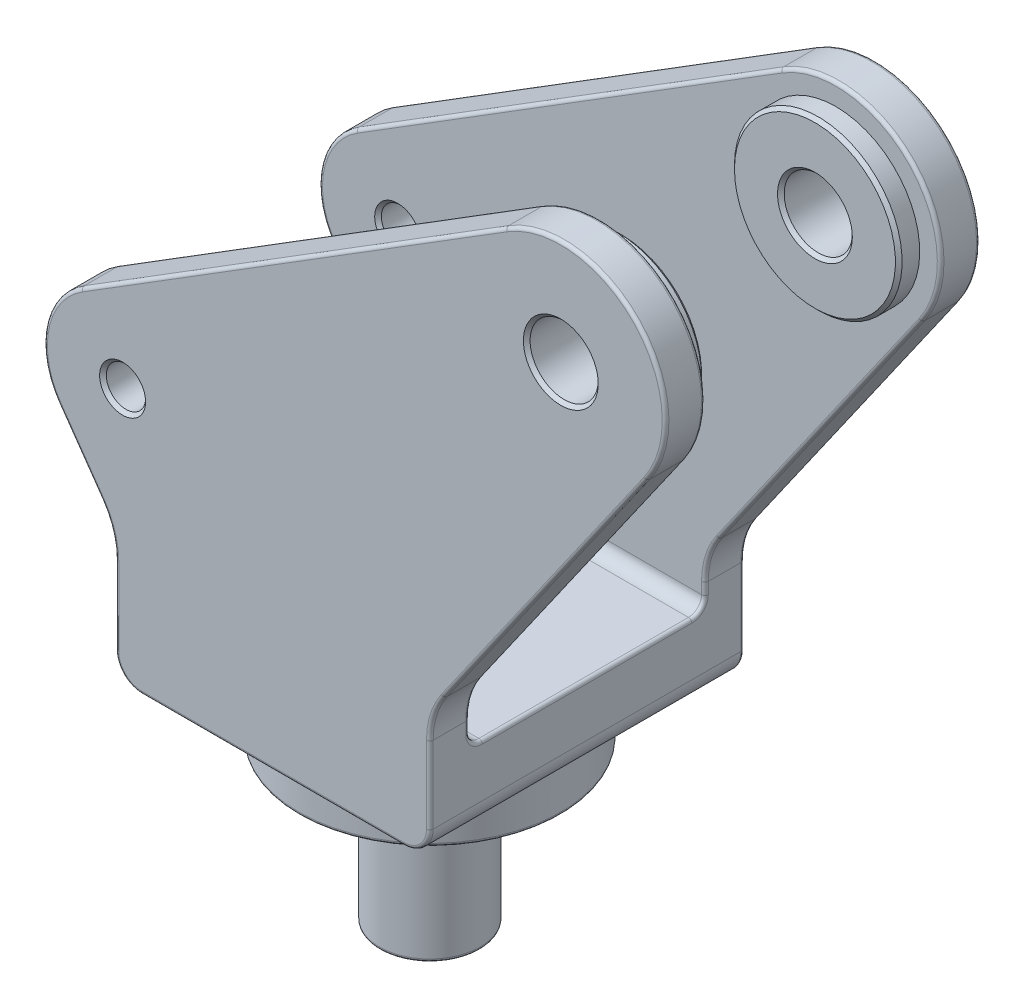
ISO-10303-21;
HEADER;
FILE_DESCRIPTION(('STEP AP214'),'2;1');
FILE_NAME('part.step','',(''),(''),'','','');
FILE_SCHEMA(('AUTOMOTIVE_DESIGN { 1 0 10303 214 1 1 1 1 }'));
ENDSEC;
DATA;
#1=APPLICATION_CONTEXT('core data for automotive mechanical design processes');
#2=APPLICATION_PROTOCOL_DEFINITION('international standard','automotive_design',2000,#1);
#3=PRODUCT_CONTEXT('',#1,'mechanical');
#4=PRODUCT('Part','Part','',(#3));
#5=PRODUCT_RELATED_PRODUCT_CATEGORY('part','',(#4));
#6=PRODUCT_DEFINITION_FORMATION('','',#4);
#7=PRODUCT_DEFINITION_CONTEXT('part definition',#1,'design');
#8=PRODUCT_DEFINITION('design','',#6,#7);
#9=PRODUCT_DEFINITION_SHAPE('','',#8);
#10=(LENGTH_UNIT() NAMED_UNIT(*) SI_UNIT(.MILLI.,.METRE.));
#11=(NAMED_UNIT(*) PLANE_ANGLE_UNIT() SI_UNIT($,.RADIAN.));
#12=(NAMED_UNIT(*) SI_UNIT($,.STERADIAN.) SOLID_ANGLE_UNIT());
#13=UNCERTAINTY_MEASURE_WITH_UNIT(LENGTH_MEASURE(1.E-05),#10,'distance_accuracy_value','');
#14=(GEOMETRIC_REPRESENTATION_CONTEXT(3) GLOBAL_UNCERTAINTY_ASSIGNED_CONTEXT((#13)) GLOBAL_UNIT_ASSIGNED_CONTEXT((#10,
#11,#12)) REPRESENTATION_CONTEXT('',''));
#15=CARTESIAN_POINT('',(0.,0.,0.));
#16=DIRECTION('',(0.,0.,1.));
#17=DIRECTION('',(1.,0.,0.));
#18=AXIS2_PLACEMENT_3D('',#15,#16,#17);
#19=CARTESIAN_POINT('',(10.8205562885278,6.34999999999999,19.05));
#20=DIRECTION('',(0.,-1.,0.));
#21=DIRECTION('',(0.,0.,-1.));
#22=AXIS2_PLACEMENT_3D('',#19,#20,#21);
#23=PLANE('',#22);
#24=DIRECTION('',(1.,0.,0.));
#25=VECTOR('',#24,1.);
#26=CARTESIAN_POINT('',(-15.875,6.34999999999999,4.7625));
#27=LINE('',#26,#25);
#28=CARTESIAN_POINT('',(-29.2735,6.34999999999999,4.7625));
#29=VERTEX_POINT('',#28);
#30=CARTESIAN_POINT('',(-15.875,6.34999999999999,4.7625));
#31=VERTEX_POINT('',#30);
#32=EDGE_CURVE('E383',#29,#31,#27,.T.);
#33=ORIENTED_EDGE('',*,*,#32,.F.);
#34=CARTESIAN_POINT('',(-29.2735,6.34999999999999,0.));
#35=DIRECTION('',(0.,-1.,0.));
#36=DIRECTION('',(0.,0.,-1.));
#37=AXIS2_PLACEMENT_3D('',#34,#35,#36);
#38=CIRCLE('',#37,4.7625);
#39=CARTESIAN_POINT('',(-29.2735,6.34999999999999,-4.7625));
#40=VERTEX_POINT('',#39);
#41=EDGE_CURVE('E781',#29,#40,#38,.T.);
#42=ORIENTED_EDGE('',*,*,#41,.T.);
#43=DIRECTION('',(1.,0.,0.));
#44=VECTOR('',#43,1.);
#45=CARTESIAN_POINT('',(-15.875,6.34999999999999,-4.7625));
#46=LINE('',#45,#44);
#47=CARTESIAN_POINT('',(-15.875,6.34999999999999,-4.7625));
#48=VERTEX_POINT('',#47);
#49=EDGE_CURVE('E392',#40,#48,#46,.T.);
#50=ORIENTED_EDGE('',*,*,#49,.T.);
#51=DIRECTION('',(0.,0.,-1.));
#52=VECTOR('',#51,1.);
#53=CARTESIAN_POINT('',(-15.875,6.34999999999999,19.05));
#54=LINE('',#53,#52);
#55=CARTESIAN_POINT('',(-15.875,6.34999999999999,-18.6436));
#56=VERTEX_POINT('',#55);
#57=EDGE_CURVE('E409',#48,#56,#54,.T.);
#58=ORIENTED_EDGE('',*,*,#57,.T.);
#59=DIRECTION('',(-1.,0.,0.));
#60=VECTOR('',#59,1.);
#61=CARTESIAN_POINT('',(15.875,6.34999999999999,-18.6436));
#62=LINE('',#61,#60);
#63=CARTESIAN_POINT('',(15.875,6.34999999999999,-18.6436));
#64=VERTEX_POINT('',#63);
#65=EDGE_CURVE('E554',#56,#64,#62,.F.);
#66=ORIENTED_EDGE('',*,*,#65,.T.);
#67=DIRECTION('',(0.,0.,-1.));
#68=VECTOR('',#67,1.);
#69=CARTESIAN_POINT('',(15.875,6.34999999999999,19.05));
#70=LINE('',#69,#68);
#71=CARTESIAN_POINT('',(15.875,6.34999999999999,0.));
#72=VERTEX_POINT('',#71);
#73=EDGE_CURVE('E413',#64,#72,#70,.F.);
#74=ORIENTED_EDGE('',*,*,#73,.T.);
#75=CARTESIAN_POINT('',(0.,6.34999999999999,0.));
#76=DIRECTION('',(0.,-1.,0.));
#77=DIRECTION('',(0.,0.,-1.));
#78=AXIS2_PLACEMENT_3D('',#75,#76,#77);
#79=CIRCLE('',#78,15.875);
#80=EDGE_CURVE('E930',#72,#72,#79,.T.);
#81=ORIENTED_EDGE('',*,*,#80,.F.);
#82=DIRECTION('',(0.,0.,-1.));
#83=VECTOR('',#82,1.);
#84=CARTESIAN_POINT('',(15.875,6.34999999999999,19.05));
#85=LINE('',#84,#83);
#86=CARTESIAN_POINT('',(15.875,6.34999999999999,18.6436));
#87=VERTEX_POINT('',#86);
#88=EDGE_CURVE('E932',#72,#87,#85,.F.);
#89=ORIENTED_EDGE('',*,*,#88,.T.);
#90=DIRECTION('',(-1.,0.,0.));
#91=VECTOR('',#90,1.);
#92=CARTESIAN_POINT('',(10.8205562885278,6.34999999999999,18.6436));
#93=LINE('',#92,#91);
#94=CARTESIAN_POINT('',(-15.875,6.34999999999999,18.6436));
#95=VERTEX_POINT('',#94);
#96=EDGE_CURVE('E408',#87,#95,#93,.T.);
#97=ORIENTED_EDGE('',*,*,#96,.T.);
#98=DIRECTION('',(0.,0.,-1.));
#99=VECTOR('',#98,1.);
#100=CARTESIAN_POINT('',(-15.875,6.34999999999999,19.05));
#101=LINE('',#100,#99);
#102=EDGE_CURVE('E399',#95,#31,#101,.T.);
#103=ORIENTED_EDGE('',*,*,#102,.T.);
#104=EDGE_LOOP('',(#33,#42,#50,#58,#66,#74,#81,#89,#97,#103));
#105=FACE_BOUND('',#104,.T.);
#106=CARTESIAN_POINT('',(-29.2735,6.34999999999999,0.));
#107=DIRECTION('',(0.,-1.,0.));
#108=DIRECTION('',(0.,0.,-1.));
#109=AXIS2_PLACEMENT_3D('',#106,#107,#108);
#110=CIRCLE('',#109,2.38125);
#111=CARTESIAN_POINT('',(-29.2735,6.34999999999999,-2.38125));
#112=VERTEX_POINT('',#111);
#113=EDGE_CURVE('E868',#112,#112,#110,.T.);
#114=ORIENTED_EDGE('',*,*,#113,.F.);
#115=EDGE_LOOP('',(#114));
#116=FACE_BOUND('',#115,.T.);
#117=ADVANCED_FACE('F33',(#105,#116),#23,.T.);
#118=CARTESIAN_POINT('',(-29.2735,11.811,0.));
#119=DIRECTION('',(0.,-1.,0.));
#120=DIRECTION('',(0.,0.,-1.));
#121=AXIS2_PLACEMENT_3D('',#118,#119,#120);
#122=CYLINDRICAL_SURFACE('',#121,4.7625);
#123=DIRECTION('',(0.,1.,0.));
#124=VECTOR('',#123,1.);
#125=CARTESIAN_POINT('',(-29.2735,11.811,4.7625));
#126=LINE('',#125,#124);
#127=CARTESIAN_POINT('',(-29.2735,11.4046,4.7625));
#128=VERTEX_POINT('',#127);
#129=EDGE_CURVE('E387',#128,#29,#126,.F.);
#130=ORIENTED_EDGE('',*,*,#129,.F.);
#131=CARTESIAN_POINT('',(-29.2735,11.4046,0.));
#132=DIRECTION('',(0.,-1.,0.));
#133=DIRECTION('',(0.,0.,-1.));
#134=AXIS2_PLACEMENT_3D('',#131,#132,#133);
#135=CIRCLE('',#134,4.7625);
#136=CARTESIAN_POINT('',(-29.2735,11.4046,-4.7625));
#137=VERTEX_POINT('',#136);
#138=EDGE_CURVE('E823',#128,#137,#135,.T.);
#139=ORIENTED_EDGE('',*,*,#138,.T.);
#140=DIRECTION('',(0.,-1.,0.));
#141=VECTOR('',#140,1.);
#142=CARTESIAN_POINT('',(-29.2735,11.811,-4.7625));
#143=LINE('',#142,#141);
#144=EDGE_CURVE('E778',#40,#137,#143,.F.);
#145=ORIENTED_EDGE('',*,*,#144,.F.);
#146=ORIENTED_EDGE('',*,*,#41,.F.);
#147=EDGE_LOOP('',(#130,#139,#145,#146));
#148=FACE_BOUND('',#147,.T.);
#149=ADVANCED_FACE('F1133',(#148),#122,.T.);
#150=CARTESIAN_POINT('',(-15.875,9.52499999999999,19.05));
#151=DIRECTION('',(0.,0.,-1.));
#152=DIRECTION('',(-1.,0.,0.));
#153=AXIS2_PLACEMENT_3D('',#150,#151,#152);
#154=CYLINDRICAL_SURFACE('',#153,3.175);
#155=ORIENTED_EDGE('',*,*,#57,.F.);
#156=CARTESIAN_POINT('',(-15.875,9.52499999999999,-4.7625));
#157=DIRECTION('',(0.,0.,1.));
#158=DIRECTION('',(1.,0.,0.));
#159=AXIS2_PLACEMENT_3D('',#156,#157,#158);
#160=CIRCLE('',#159,3.175);
#161=CARTESIAN_POINT('',(-19.05,9.52499999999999,-4.7625));
#162=VERTEX_POINT('',#161);
#163=EDGE_CURVE('E403',#48,#162,#160,.F.);
#164=ORIENTED_EDGE('',*,*,#163,.T.);
#165=DIRECTION('',(0.,0.,-1.));
#166=VECTOR('',#165,1.);
#167=CARTESIAN_POINT('',(-19.05,9.52499999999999,19.05));
#168=LINE('',#167,#166);
#169=CARTESIAN_POINT('',(-19.05,9.52499999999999,-18.6436));
#170=VERTEX_POINT('',#169);
#171=EDGE_CURVE('E411',#170,#162,#168,.F.);
#172=ORIENTED_EDGE('',*,*,#171,.F.);
#173=CARTESIAN_POINT('',(-15.875,9.52499999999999,-18.6436));
#174=DIRECTION('',(0.,0.,1.));
#175=DIRECTION('',(1.,0.,0.));
#176=AXIS2_PLACEMENT_3D('',#173,#174,#175);
#177=CIRCLE('',#176,3.175);
#178=EDGE_CURVE('E507',#170,#56,#177,.T.);
#179=ORIENTED_EDGE('',*,*,#178,.T.);
#180=EDGE_LOOP('',(#155,#164,#172,#179));
#181=FACE_BOUND('',#180,.T.);
#182=ADVANCED_FACE('F1138',(#181),#154,.T.);
#183=CARTESIAN_POINT('',(-27.7064642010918,79.375,-14.2875));
#184=DIRECTION('',(0.,0.,-1.));
#185=DIRECTION('',(0.,1.,0.));
#186=AXIS2_PLACEMENT_3D('',#183,#184,#185);
#187=PLANE('',#186);
#188=CARTESIAN_POINT('',(-18.1814642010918,37.3454630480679,-14.2875));
#189=DIRECTION('',(0.,0.,-1.));
#190=DIRECTION('',(0.,1.,0.));
#191=AXIS2_PLACEMENT_3D('',#188,#189,#190);
#192=CIRCLE('',#191,2.78764999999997);
#193=CARTESIAN_POINT('',(-18.1814642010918,40.1331130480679,-14.2875));
#194=VERTEX_POINT('',#193);
#195=EDGE_CURVE('E783',#194,#194,#192,.T.);
#196=ORIENTED_EDGE('',*,*,#195,.T.);
#197=EDGE_LOOP('',(#196));
#198=FACE_BOUND('',#197,.T.);
#199=DIRECTION('',(1.,0.,0.));
#200=VECTOR('',#199,1.);
#201=CARTESIAN_POINT('',(-27.7064642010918,17.4625,-14.2875));
#202=LINE('',#201,#200);
#203=CARTESIAN_POINT('',(-18.6436,17.4625,-14.2875));
#204=VERTEX_POINT('',#203);
#205=CARTESIAN_POINT('',(18.6436,17.4625,-14.2875));
#206=VERTEX_POINT('',#205);
#207=EDGE_CURVE('E887',#204,#206,#202,.T.);
#208=ORIENTED_EDGE('',*,*,#207,.T.);
#209=DIRECTION('',(0.,1.,0.));
#210=VECTOR('',#209,1.);
#211=CARTESIAN_POINT('',(18.6436,18.8581551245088,-14.2875));
#212=LINE('',#211,#210);
#213=CARTESIAN_POINT('',(18.6436,18.8581551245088,-14.2875));
#214=VERTEX_POINT('',#213);
#215=EDGE_CURVE('E582',#206,#214,#212,.T.);
#216=ORIENTED_EDGE('',*,*,#215,.T.);
#217=CARTESIAN_POINT('',(28.575,18.8581551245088,-14.2875));
#218=DIRECTION('',(0.,0.,-1.));
#219=DIRECTION('',(0.,1.,0.));
#220=AXIS2_PLACEMENT_3D('',#217,#218,#219);
#221=CIRCLE('',#220,9.93139999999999);
#222=CARTESIAN_POINT('',(20.4396733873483,24.5545721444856,-14.2875));
#223=VERTEX_POINT('',#222);
#224=EDGE_CURVE('E580',#214,#223,#221,.T.);
#225=ORIENTED_EDGE('',*,*,#224,.T.);
#226=DIRECTION('',(0.573576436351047,0.819152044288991,0.));
#227=VECTOR('',#226,1.);
#228=CARTESIAN_POINT('',(44.9953275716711,59.6236807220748,-14.2875));
#229=LINE('',#228,#227);
#230=CARTESIAN_POINT('',(44.9953275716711,59.6236807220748,-14.2875));
#231=VERTEX_POINT('',#230);
#232=EDGE_CURVE('E577',#223,#231,#229,.T.);
#233=ORIENTED_EDGE('',*,*,#232,.T.);
#234=CARTESIAN_POINT('',(34.925,66.675,-14.2875));
#235=DIRECTION('',(0.,0.,-1.));
#236=DIRECTION('',(0.,1.,0.));
#237=AXIS2_PLACEMENT_3D('',#234,#235,#236);
#238=CIRCLE('',#237,12.2936);
#239=CARTESIAN_POINT('',(28.4266172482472,77.1106898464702,-14.2875));
#240=VERTEX_POINT('',#239);
#241=EDGE_CURVE('E565',#231,#240,#238,.F.);
#242=ORIENTED_EDGE('',*,*,#241,.T.);
#243=DIRECTION('',(-0.848871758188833,-0.528598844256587,0.));
#244=VECTOR('',#243,1.);
#245=CARTESIAN_POINT('',(-23.0015456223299,45.0859850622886,-14.2875));
#246=LINE('',#245,#244);
#247=CARTESIAN_POINT('',(-23.0015456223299,45.0859850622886,-14.2875));
#248=VERTEX_POINT('',#247);
#249=EDGE_CURVE('E567',#240,#248,#246,.T.);
#250=ORIENTED_EDGE('',*,*,#249,.T.);
#251=CARTESIAN_POINT('',(-18.1814642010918,37.3454630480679,-14.2875));
#252=DIRECTION('',(0.,0.,-1.));
#253=DIRECTION('',(0.,1.,0.));
#254=AXIS2_PLACEMENT_3D('',#251,#252,#253);
#255=CIRCLE('',#254,9.11860000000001);
#256=CARTESIAN_POINT('',(-25.6509840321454,32.1152489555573,-14.2875));
#257=VERTEX_POINT('',#256);
#258=EDGE_CURVE('E569',#248,#257,#255,.F.);
#259=ORIENTED_EDGE('',*,*,#258,.T.);
#260=DIRECTION('',(0.573576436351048,-0.819152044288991,0.));
#261=VECTOR('',#260,1.);
#262=CARTESIAN_POINT('',(-20.4396733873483,24.6727260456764,-14.2875));
#263=LINE('',#262,#261);
#264=CARTESIAN_POINT('',(-20.4396733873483,24.6727260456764,-14.2875));
#265=VERTEX_POINT('',#264);
#266=EDGE_CURVE('E571',#257,#265,#263,.T.);
#267=ORIENTED_EDGE('',*,*,#266,.T.);
#268=CARTESIAN_POINT('',(-28.575,18.9763090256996,-14.2875));
#269=DIRECTION('',(0.,0.,-1.));
#270=DIRECTION('',(0.,1.,0.));
#271=AXIS2_PLACEMENT_3D('',#268,#269,#270);
#272=CIRCLE('',#271,9.9314);
#273=CARTESIAN_POINT('',(-18.6436,18.9763090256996,-14.2875));
#274=VERTEX_POINT('',#273);
#275=EDGE_CURVE('E573',#265,#274,#272,.T.);
#276=ORIENTED_EDGE('',*,*,#275,.T.);
#277=DIRECTION('',(0.,-1.,0.));
#278=VECTOR('',#277,1.);
#279=CARTESIAN_POINT('',(-18.6436,17.4625,-14.2875));
#280=LINE('',#279,#278);
#281=EDGE_CURVE('E575',#274,#204,#280,.T.);
#282=ORIENTED_EDGE('',*,*,#281,.T.);
#283=EDGE_LOOP('',(#208,#216,#225,#233,#242,#250,#259,#267,#276,#282));
#284=FACE_BOUND('',#283,.T.);
#285=CARTESIAN_POINT('',(34.925,66.675,-14.2875));
#286=DIRECTION('',(0.,0.,-1.));
#287=DIRECTION('',(0.,1.,0.));
#288=AXIS2_PLACEMENT_3D('',#285,#286,#287);
#289=CIRCLE('',#288,10.16);
#290=CARTESIAN_POINT('',(34.925,76.835,-14.2875));
#291=VERTEX_POINT('',#290);
#292=EDGE_CURVE('E631',#291,#291,#289,.F.);
#293=ORIENTED_EDGE('',*,*,#292,.F.);
#294=EDGE_LOOP('',(#293));
#295=FACE_BOUND('',#294,.T.);
#296=ADVANCED_FACE('F1647',(#198,#284,#295),#187,.F.);
#297=CARTESIAN_POINT('',(-36.0942404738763,37.4118183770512,19.05));
#298=DIRECTION('',(-0.528598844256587,0.848871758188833,0.));
#299=DIRECTION('',(-0.848871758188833,-0.528598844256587,0.));
#300=AXIS2_PLACEMENT_3D('',#297,#298,#299);
#301=PLANE('',#300);
#302=DIRECTION('',(0.,0.,-1.));
#303=VECTOR('',#302,1.);
#304=CARTESIAN_POINT('',(-23.2163681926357,45.4309665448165,19.05));
#305=LINE('',#304,#303);
#306=CARTESIAN_POINT('',(-23.2163681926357,45.4309665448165,18.6436));
#307=VERTEX_POINT('',#306);
#308=CARTESIAN_POINT('',(-23.2163681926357,45.4309665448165,14.6939));
#309=VERTEX_POINT('',#308);
#310=EDGE_CURVE('E929',#307,#309,#305,.T.);
#311=ORIENTED_EDGE('',*,*,#310,.F.);
#312=DIRECTION('',(0.848871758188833,0.528598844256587,0.));
#313=VECTOR('',#312,1.);
#314=CARTESIAN_POINT('',(-36.0942404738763,37.4118183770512,18.6436));
#315=LINE('',#314,#313);
#316=CARTESIAN_POINT('',(28.2117946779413,77.4556713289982,18.6436));
#317=VERTEX_POINT('',#316);
#318=EDGE_CURVE('E479',#307,#317,#315,.T.);
#319=ORIENTED_EDGE('',*,*,#318,.T.);
#320=DIRECTION('',(0.,0.,-1.));
#321=VECTOR('',#320,1.);
#322=CARTESIAN_POINT('',(28.2117946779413,77.4556713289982,19.05));
#323=LINE('',#322,#321);
#324=CARTESIAN_POINT('',(28.2117946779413,77.4556713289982,14.6939));
#325=VERTEX_POINT('',#324);
#326=EDGE_CURVE('E901',#317,#325,#323,.T.);
#327=ORIENTED_EDGE('',*,*,#326,.T.);
#328=DIRECTION('',(0.848871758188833,0.528598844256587,0.));
#329=VECTOR('',#328,1.);
#330=CARTESIAN_POINT('',(-23.2163681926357,45.4309665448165,14.6939));
#331=LINE('',#330,#329);
#332=EDGE_CURVE('E477',#325,#309,#331,.F.);
#333=ORIENTED_EDGE('',*,*,#332,.T.);
#334=EDGE_LOOP('',(#311,#319,#327,#333));
#335=FACE_BOUND('',#334,.T.);
#336=ADVANCED_FACE('F1005',(#335),#301,.T.);
#337=CARTESIAN_POINT('',(-18.1814642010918,37.3454630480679,19.05));
#338=DIRECTION('',(0.,0.,-1.));
#339=DIRECTION('',(-1.,0.,0.));
#340=AXIS2_PLACEMENT_3D('',#337,#338,#339);
#341=CYLINDRICAL_SURFACE('',#340,9.52500000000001);
#342=CARTESIAN_POINT('',(-23.2163681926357,45.4309665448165,-14.6939));
#343=VERTEX_POINT('',#342);
#344=CARTESIAN_POINT('',(-23.2163681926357,45.4309665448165,-18.6436));
#345=VERTEX_POINT('',#344);
#346=EDGE_CURVE('E926',#343,#345,#305,.T.);
#347=ORIENTED_EDGE('',*,*,#346,.T.);
#348=CARTESIAN_POINT('',(-18.1814642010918,37.3454630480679,-18.6436));
#349=DIRECTION('',(0.,0.,1.));
#350=DIRECTION('',(1.,0.,0.));
#351=AXIS2_PLACEMENT_3D('',#348,#349,#350);
#352=CIRCLE('',#351,9.52500000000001);
#353=CARTESIAN_POINT('',(-25.9838874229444,31.8821474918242,-18.6436));
#354=VERTEX_POINT('',#353);
#355=EDGE_CURVE('E544',#345,#354,#352,.T.);
#356=ORIENTED_EDGE('',*,*,#355,.T.);
#357=DIRECTION('',(0.,0.,-1.));
#358=VECTOR('',#357,1.);
#359=CARTESIAN_POINT('',(-25.9838874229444,31.8821474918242,19.05));
#360=LINE('',#359,#358);
#361=CARTESIAN_POINT('',(-25.9838874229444,31.8821474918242,-14.6939));
#362=VERTEX_POINT('',#361);
#363=EDGE_CURVE('E922',#362,#354,#360,.T.);
#364=ORIENTED_EDGE('',*,*,#363,.F.);
#365=CARTESIAN_POINT('',(-18.1814642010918,37.3454630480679,-14.6939));
#366=DIRECTION('',(0.,0.,-1.));
#367=DIRECTION('',(0.,1.,0.));
#368=AXIS2_PLACEMENT_3D('',#365,#366,#367);
#369=CIRCLE('',#368,9.52500000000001);
#370=EDGE_CURVE('E542',#362,#343,#369,.T.);
#371=ORIENTED_EDGE('',*,*,#370,.T.);
#372=EDGE_LOOP('',(#347,#356,#364,#371));
#373=FACE_BOUND('',#372,.T.);
#374=ADVANCED_FACE('F1157',(#373),#341,.T.);
#375=CARTESIAN_POINT('',(18.9245375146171,-32.2537300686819,19.05));
#376=DIRECTION('',(-0.819152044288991,-0.573576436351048,0.));
#377=DIRECTION('',(0.573576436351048,-0.819152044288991,0.));
#378=AXIS2_PLACEMENT_3D('',#375,#376,#377);
#379=PLANE('',#378);
#380=DIRECTION('',(0.,0.,-1.));
#381=VECTOR('',#380,1.);
#382=CARTESIAN_POINT('',(-20.7725767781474,24.4396245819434,19.05));
#383=LINE('',#382,#381);
#384=CARTESIAN_POINT('',(-20.7725767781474,24.4396245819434,18.6436));
#385=VERTEX_POINT('',#384);
#386=CARTESIAN_POINT('',(-20.7725767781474,24.4396245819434,14.6939));
#387=VERTEX_POINT('',#386);
#388=EDGE_CURVE('E921',#385,#387,#383,.T.);
#389=ORIENTED_EDGE('',*,*,#388,.F.);
#390=DIRECTION('',(-0.573576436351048,0.819152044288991,0.));
#391=VECTOR('',#390,1.);
#392=CARTESIAN_POINT('',(18.9245375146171,-32.2537300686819,18.6436));
#393=LINE('',#392,#391);
#394=CARTESIAN_POINT('',(-25.9838874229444,31.8821474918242,18.6436));
#395=VERTEX_POINT('',#394);
#396=EDGE_CURVE('E487',#385,#395,#393,.T.);
#397=ORIENTED_EDGE('',*,*,#396,.T.);
#398=CARTESIAN_POINT('',(-25.9838874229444,31.8821474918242,14.6939));
#399=VERTEX_POINT('',#398);
#400=EDGE_CURVE('E925',#395,#399,#360,.T.);
#401=ORIENTED_EDGE('',*,*,#400,.T.);
#402=DIRECTION('',(-0.573576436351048,0.819152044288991,0.));
#403=VECTOR('',#402,1.);
#404=CARTESIAN_POINT('',(-20.7725767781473,24.4396245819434,14.6939));
#405=LINE('',#404,#403);
#406=EDGE_CURVE('E485',#399,#387,#405,.F.);
#407=ORIENTED_EDGE('',*,*,#406,.T.);
#408=EDGE_LOOP('',(#389,#397,#401,#407));
#409=FACE_BOUND('',#408,.T.);
#410=ADVANCED_FACE('F1024',(#409),#379,.T.);
#411=CARTESIAN_POINT('',(-28.575,18.9763090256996,19.05));
#412=DIRECTION('',(0.,0.,-1.));
#413=DIRECTION('',(-1.,0.,0.));
#414=AXIS2_PLACEMENT_3D('',#411,#412,#413);
#415=CYLINDRICAL_SURFACE('',#414,9.525);
#416=DIRECTION('',(0.,0.,-1.));
#417=VECTOR('',#416,1.);
#418=CARTESIAN_POINT('',(-19.05,18.9763090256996,19.05));
#419=LINE('',#418,#417);
#420=CARTESIAN_POINT('',(-19.05,18.9763090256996,18.6436));
#421=VERTEX_POINT('',#420);
#422=CARTESIAN_POINT('',(-19.05,18.9763090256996,14.6939));
#423=VERTEX_POINT('',#422);
#424=EDGE_CURVE('E917',#421,#423,#419,.T.);
#425=ORIENTED_EDGE('',*,*,#424,.F.);
#426=CARTESIAN_POINT('',(-28.575,18.9763090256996,18.6436));
#427=DIRECTION('',(0.,0.,1.));
#428=DIRECTION('',(1.,0.,0.));
#429=AXIS2_PLACEMENT_3D('',#426,#427,#428);
#430=CIRCLE('',#429,9.525);
#431=EDGE_CURVE('E491',#421,#385,#430,.T.);
#432=ORIENTED_EDGE('',*,*,#431,.T.);
#433=ORIENTED_EDGE('',*,*,#388,.T.);
#434=CARTESIAN_POINT('',(-28.575,18.9763090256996,14.6939));
#435=DIRECTION('',(0.,0.,1.));
#436=DIRECTION('',(0.,-1.,0.));
#437=AXIS2_PLACEMENT_3D('',#434,#435,#436);
#438=CIRCLE('',#437,9.525);
#439=EDGE_CURVE('E489',#387,#423,#438,.F.);
#440=ORIENTED_EDGE('',*,*,#439,.T.);
#441=EDGE_LOOP('',(#425,#432,#433,#440));
#442=FACE_BOUND('',#441,.T.);
#443=ADVANCED_FACE('F1040',(#442),#415,.F.);
#444=CARTESIAN_POINT('',(28.575,18.8581551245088,19.05));
#445=DIRECTION('',(0.,0.,-1.));
#446=DIRECTION('',(-1.,0.,0.));
#447=AXIS2_PLACEMENT_3D('',#444,#445,#446);
#448=CYLINDRICAL_SURFACE('',#447,9.525);
#449=DIRECTION('',(0.,0.,-1.));
#450=VECTOR('',#449,1.);
#451=CARTESIAN_POINT('',(20.7725767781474,24.3214706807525,19.05));
#452=LINE('',#451,#450);
#453=CARTESIAN_POINT('',(20.7725767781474,24.3214706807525,18.6436));
#454=VERTEX_POINT('',#453);
#455=CARTESIAN_POINT('',(20.7725767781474,24.3214706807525,14.6939));
#456=VERTEX_POINT('',#455);
#457=EDGE_CURVE('E909',#454,#456,#452,.T.);
#458=ORIENTED_EDGE('',*,*,#457,.F.);
#459=CARTESIAN_POINT('',(28.575,18.8581551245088,18.6436));
#460=DIRECTION('',(0.,0.,1.));
#461=DIRECTION('',(1.,0.,0.));
#462=AXIS2_PLACEMENT_3D('',#459,#460,#461);
#463=CIRCLE('',#462,9.525);
#464=CARTESIAN_POINT('',(19.05,18.8581551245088,18.6436));
#465=VERTEX_POINT('',#464);
#466=EDGE_CURVE('E467',#454,#465,#463,.T.);
#467=ORIENTED_EDGE('',*,*,#466,.T.);
#468=DIRECTION('',(0.,0.,-1.));
#469=VECTOR('',#468,1.);
#470=CARTESIAN_POINT('',(19.05,18.8581551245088,19.05));
#471=LINE('',#470,#469);
#472=CARTESIAN_POINT('',(19.05,18.8581551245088,14.6939));
#473=VERTEX_POINT('',#472);
#474=EDGE_CURVE('E910',#465,#473,#471,.T.);
#475=ORIENTED_EDGE('',*,*,#474,.T.);
#476=CARTESIAN_POINT('',(28.575,18.8581551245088,14.6939));
#477=DIRECTION('',(0.,0.,1.));
#478=DIRECTION('',(0.,-1.,0.));
#479=AXIS2_PLACEMENT_3D('',#476,#477,#478);
#480=CIRCLE('',#479,9.525);
#481=EDGE_CURVE('E465',#473,#456,#480,.F.);
#482=ORIENTED_EDGE('',*,*,#481,.T.);
#483=EDGE_LOOP('',(#458,#467,#475,#482));
#484=FACE_BOUND('',#483,.T.);
#485=ADVANCED_FACE('F1087',(#484),#448,.F.);
#486=CARTESIAN_POINT('',(-11.7493152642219,-22.1246046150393,19.05));
#487=DIRECTION('',(0.819152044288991,-0.573576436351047,0.));
#488=DIRECTION('',(0.573576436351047,0.819152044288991,0.));
#489=AXIS2_PLACEMENT_3D('',#486,#487,#488);
#490=PLANE('',#489);
#491=DIRECTION('',(0.,0.,-1.));
#492=VECTOR('',#491,1.);
#493=CARTESIAN_POINT('',(45.3282309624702,59.3905792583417,19.05));
#494=LINE('',#493,#492);
#495=CARTESIAN_POINT('',(45.3282309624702,59.3905792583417,18.6436));
#496=VERTEX_POINT('',#495);
#497=CARTESIAN_POINT('',(45.3282309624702,59.3905792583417,14.6939));
#498=VERTEX_POINT('',#497);
#499=EDGE_CURVE('E905',#496,#498,#494,.T.);
#500=ORIENTED_EDGE('',*,*,#499,.F.);
#501=DIRECTION('',(-0.573576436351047,-0.819152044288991,0.));
#502=VECTOR('',#501,1.);
#503=CARTESIAN_POINT('',(-11.7493152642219,-22.1246046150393,18.6436));
#504=LINE('',#503,#502);
#505=EDGE_CURVE('E471',#496,#454,#504,.T.);
#506=ORIENTED_EDGE('',*,*,#505,.T.);
#507=ORIENTED_EDGE('',*,*,#457,.T.);
#508=DIRECTION('',(-0.573576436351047,-0.819152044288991,0.));
#509=VECTOR('',#508,1.);
#510=CARTESIAN_POINT('',(45.3282309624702,59.3905792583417,14.6939));
#511=LINE('',#510,#509);
#512=EDGE_CURVE('E469',#456,#498,#511,.F.);
#513=ORIENTED_EDGE('',*,*,#512,.T.);
#514=EDGE_LOOP('',(#500,#506,#507,#513));
#515=FACE_BOUND('',#514,.T.);
#516=ADVANCED_FACE('F972',(#515),#490,.T.);
#517=CARTESIAN_POINT('',(34.925,66.675,19.05));
#518=DIRECTION('',(0.,0.,-1.));
#519=DIRECTION('',(-1.,0.,0.));
#520=AXIS2_PLACEMENT_3D('',#517,#518,#519);
#521=CYLINDRICAL_SURFACE('',#520,12.7);
#522=CARTESIAN_POINT('',(45.3282309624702,59.3905792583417,-14.6939));
#523=VERTEX_POINT('',#522);
#524=CARTESIAN_POINT('',(45.3282309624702,59.3905792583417,-18.6436));
#525=VERTEX_POINT('',#524);
#526=EDGE_CURVE('E902',#523,#525,#494,.T.);
#527=ORIENTED_EDGE('',*,*,#526,.T.);
#528=CARTESIAN_POINT('',(34.925,66.675,-18.6436));
#529=DIRECTION('',(0.,0.,1.));
#530=DIRECTION('',(1.,0.,0.));
#531=AXIS2_PLACEMENT_3D('',#528,#529,#530);
#532=CIRCLE('',#531,12.7);
#533=CARTESIAN_POINT('',(28.2117946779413,77.4556713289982,-18.6436));
#534=VERTEX_POINT('',#533);
#535=EDGE_CURVE('E629',#525,#534,#532,.T.);
#536=ORIENTED_EDGE('',*,*,#535,.T.);
#537=CARTESIAN_POINT('',(28.2117946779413,77.4556713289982,-14.6939));
#538=VERTEX_POINT('',#537);
#539=EDGE_CURVE('E890',#538,#534,#323,.T.);
#540=ORIENTED_EDGE('',*,*,#539,.F.);
#541=CARTESIAN_POINT('',(34.925,66.675,-14.6939));
#542=DIRECTION('',(0.,0.,-1.));
#543=DIRECTION('',(0.,1.,0.));
#544=AXIS2_PLACEMENT_3D('',#541,#542,#543);
#545=CIRCLE('',#544,12.7);
#546=EDGE_CURVE('E627',#538,#523,#545,.T.);
#547=ORIENTED_EDGE('',*,*,#546,.T.);
#548=EDGE_LOOP('',(#527,#536,#540,#547));
#549=FACE_BOUND('',#548,.T.);
#550=ADVANCED_FACE('F1160',(#549),#521,.T.);
#551=ORIENTED_EDGE('',*,*,#539,.T.);
#552=DIRECTION('',(0.848871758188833,0.528598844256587,0.));
#553=VECTOR('',#552,1.);
#554=CARTESIAN_POINT('',(-23.2163681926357,45.4309665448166,-18.6436));
#555=LINE('',#554,#553);
#556=EDGE_CURVE('E539',#534,#345,#555,.F.);
#557=ORIENTED_EDGE('',*,*,#556,.T.);
#558=ORIENTED_EDGE('',*,*,#346,.F.);
#559=DIRECTION('',(-0.848871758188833,-0.528598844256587,0.));
#560=VECTOR('',#559,1.);
#561=CARTESIAN_POINT('',(28.2117946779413,77.4556713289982,-14.6939));
#562=LINE('',#561,#560);
#563=EDGE_CURVE('E537',#343,#538,#562,.F.);
#564=ORIENTED_EDGE('',*,*,#563,.T.);
#565=EDGE_LOOP('',(#551,#557,#558,#564));
#566=FACE_BOUND('',#565,.T.);
#567=ADVANCED_FACE('F1156',(#566),#301,.T.);
#568=ORIENTED_EDGE('',*,*,#400,.F.);
#569=CARTESIAN_POINT('',(-18.1814642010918,37.3454630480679,18.6436));
#570=DIRECTION('',(0.,0.,1.));
#571=DIRECTION('',(1.,0.,0.));
#572=AXIS2_PLACEMENT_3D('',#569,#570,#571);
#573=CIRCLE('',#572,9.52500000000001);
#574=EDGE_CURVE('E483',#395,#307,#573,.F.);
#575=ORIENTED_EDGE('',*,*,#574,.T.);
#576=ORIENTED_EDGE('',*,*,#310,.T.);
#577=CARTESIAN_POINT('',(-18.1814642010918,37.3454630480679,14.6939));
#578=DIRECTION('',(0.,0.,1.));
#579=DIRECTION('',(0.,-1.,0.));
#580=AXIS2_PLACEMENT_3D('',#577,#578,#579);
#581=CIRCLE('',#580,9.52500000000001);
#582=EDGE_CURVE('E481',#309,#399,#581,.T.);
#583=ORIENTED_EDGE('',*,*,#582,.T.);
#584=EDGE_LOOP('',(#568,#575,#576,#583));
#585=FACE_BOUND('',#584,.T.);
#586=ADVANCED_FACE('F1019',(#585),#341,.T.);
#587=ORIENTED_EDGE('',*,*,#363,.T.);
#588=DIRECTION('',(-0.573576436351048,0.819152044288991,0.));
#589=VECTOR('',#588,1.);
#590=CARTESIAN_POINT('',(-20.7725767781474,24.4396245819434,-18.6436));
#591=LINE('',#590,#589);
#592=CARTESIAN_POINT('',(-20.7725767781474,24.4396245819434,-18.6436));
#593=VERTEX_POINT('',#592);
#594=EDGE_CURVE('E548',#354,#593,#591,.F.);
#595=ORIENTED_EDGE('',*,*,#594,.T.);
#596=CARTESIAN_POINT('',(-20.7725767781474,24.4396245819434,-14.6939));
#597=VERTEX_POINT('',#596);
#598=EDGE_CURVE('E918',#597,#593,#383,.T.);
#599=ORIENTED_EDGE('',*,*,#598,.F.);
#600=DIRECTION('',(0.573576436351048,-0.819152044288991,0.));
#601=VECTOR('',#600,1.);
#602=CARTESIAN_POINT('',(-25.9838874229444,31.8821474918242,-14.6939));
#603=LINE('',#602,#601);
#604=EDGE_CURVE('E546',#597,#362,#603,.F.);
#605=ORIENTED_EDGE('',*,*,#604,.T.);
#606=EDGE_LOOP('',(#587,#595,#599,#605));
#607=FACE_BOUND('',#606,.T.);
#608=ADVANCED_FACE('F1149',(#607),#379,.T.);
#609=ORIENTED_EDGE('',*,*,#598,.T.);
#610=CARTESIAN_POINT('',(-28.575,18.9763090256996,-18.6436));
#611=DIRECTION('',(0.,0.,1.));
#612=DIRECTION('',(1.,0.,0.));
#613=AXIS2_PLACEMENT_3D('',#610,#611,#612);
#614=CIRCLE('',#613,9.525);
#615=CARTESIAN_POINT('',(-19.05,18.9763090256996,-18.6436));
#616=VERTEX_POINT('',#615);
#617=EDGE_CURVE('E552',#593,#616,#614,.F.);
#618=ORIENTED_EDGE('',*,*,#617,.T.);
#619=CARTESIAN_POINT('',(-19.05,18.9763090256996,-14.6939));
#620=VERTEX_POINT('',#619);
#621=EDGE_CURVE('E913',#620,#616,#419,.T.);
#622=ORIENTED_EDGE('',*,*,#621,.F.);
#623=CARTESIAN_POINT('',(-28.575,18.9763090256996,-14.6939));
#624=DIRECTION('',(0.,0.,-1.));
#625=DIRECTION('',(0.,1.,0.));
#626=AXIS2_PLACEMENT_3D('',#623,#624,#625);
#627=CIRCLE('',#626,9.525);
#628=EDGE_CURVE('E550',#620,#597,#627,.F.);
#629=ORIENTED_EDGE('',*,*,#628,.T.);
#630=EDGE_LOOP('',(#609,#618,#622,#629));
#631=FACE_BOUND('',#630,.T.);
#632=ADVANCED_FACE('F1146',(#631),#415,.F.);
#633=CARTESIAN_POINT('',(-19.05,-37.9281988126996,19.05));
#634=DIRECTION('',(-1.,0.,0.));
#635=DIRECTION('',(0.,-1.,0.));
#636=AXIS2_PLACEMENT_3D('',#633,#634,#635);
#637=PLANE('',#636);
#638=DIRECTION('',(0.,1.,0.));
#639=VECTOR('',#638,1.);
#640=CARTESIAN_POINT('',(-19.05,-37.9281988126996,4.7625));
#641=LINE('',#640,#639);
#642=CARTESIAN_POINT('',(-19.05,9.52499999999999,4.7625));
#643=VERTEX_POINT('',#642);
#644=CARTESIAN_POINT('',(-19.05,11.4046,4.7625));
#645=VERTEX_POINT('',#644);
#646=EDGE_CURVE('E880',#643,#645,#641,.T.);
#647=ORIENTED_EDGE('',*,*,#646,.F.);
#648=CARTESIAN_POINT('',(-19.05,9.52499999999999,18.6436));
#649=VERTEX_POINT('',#648);
#650=EDGE_CURVE('E401',#643,#649,#168,.F.);
#651=ORIENTED_EDGE('',*,*,#650,.T.);
#652=DIRECTION('',(0.,1.,0.));
#653=VECTOR('',#652,1.);
#654=CARTESIAN_POINT('',(-19.05,-37.9281988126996,18.6436));
#655=LINE('',#654,#653);
#656=EDGE_CURVE('E505',#649,#421,#655,.T.);
#657=ORIENTED_EDGE('',*,*,#656,.T.);
#658=ORIENTED_EDGE('',*,*,#424,.T.);
#659=DIRECTION('',(0.,1.,0.));
#660=VECTOR('',#659,1.);
#661=CARTESIAN_POINT('',(-19.05,17.4625,14.6939));
#662=LINE('',#661,#660);
#663=CARTESIAN_POINT('',(-19.05,17.4625,14.6939));
#664=VERTEX_POINT('',#663);
#665=EDGE_CURVE('E501',#423,#664,#662,.F.);
#666=ORIENTED_EDGE('',*,*,#665,.T.);
#667=CARTESIAN_POINT('',(-19.05,17.4625,12.7));
#668=DIRECTION('',(-1.,0.,0.));
#669=DIRECTION('',(0.,-1.,0.));
#670=AXIS2_PLACEMENT_3D('',#667,#668,#669);
#671=CIRCLE('',#670,1.9939);
#672=CARTESIAN_POINT('',(-19.05,15.4686,12.7));
#673=VERTEX_POINT('',#672);
#674=EDGE_CURVE('E499',#664,#673,#671,.F.);
#675=ORIENTED_EDGE('',*,*,#674,.T.);
#676=DIRECTION('',(0.,0.,1.));
#677=VECTOR('',#676,1.);
#678=CARTESIAN_POINT('',(-19.05,15.4686,-12.7));
#679=LINE('',#678,#677);
#680=CARTESIAN_POINT('',(-19.05,15.4686,-12.7));
#681=VERTEX_POINT('',#680);
#682=EDGE_CURVE('E497',#673,#681,#679,.F.);
#683=ORIENTED_EDGE('',*,*,#682,.T.);
#684=CARTESIAN_POINT('',(-19.05,17.4625,-12.7));
#685=DIRECTION('',(-1.,0.,0.));
#686=DIRECTION('',(0.,-1.,0.));
#687=AXIS2_PLACEMENT_3D('',#684,#685,#686);
#688=CIRCLE('',#687,1.9939);
#689=CARTESIAN_POINT('',(-19.05,17.4625,-14.6939));
#690=VERTEX_POINT('',#689);
#691=EDGE_CURVE('E495',#681,#690,#688,.F.);
#692=ORIENTED_EDGE('',*,*,#691,.T.);
#693=DIRECTION('',(0.,-1.,0.));
#694=VECTOR('',#693,1.);
#695=CARTESIAN_POINT('',(-19.05,18.9763090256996,-14.6939));
#696=LINE('',#695,#694);
#697=EDGE_CURVE('E493',#690,#620,#696,.F.);
#698=ORIENTED_EDGE('',*,*,#697,.T.);
#699=ORIENTED_EDGE('',*,*,#621,.T.);
#700=DIRECTION('',(0.,1.,0.));
#701=VECTOR('',#700,1.);
#702=CARTESIAN_POINT('',(-19.05,9.52499999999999,-18.6436));
#703=LINE('',#702,#701);
#704=EDGE_CURVE('E503',#616,#170,#703,.F.);
#705=ORIENTED_EDGE('',*,*,#704,.T.);
#706=ORIENTED_EDGE('',*,*,#171,.T.);
#707=DIRECTION('',(0.,1.,0.));
#708=VECTOR('',#707,1.);
#709=CARTESIAN_POINT('',(-19.05,-37.9281988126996,-4.7625));
#710=LINE('',#709,#708);
#711=CARTESIAN_POINT('',(-19.05,11.4046,-4.7625));
#712=VERTEX_POINT('',#711);
#713=EDGE_CURVE('E391',#162,#712,#710,.T.);
#714=ORIENTED_EDGE('',*,*,#713,.T.);
#715=DIRECTION('',(0.,-0.707106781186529,-0.707106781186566));
#716=VECTOR('',#715,1.);
#717=CARTESIAN_POINT('',(-19.05,11.811,-4.3561));
#718=LINE('',#717,#716);
#719=CARTESIAN_POINT('',(-19.05,11.811,-4.3561));
#720=VERTEX_POINT('',#719);
#721=EDGE_CURVE('E42',#712,#720,#718,.F.);
#722=ORIENTED_EDGE('',*,*,#721,.T.);
#723=DIRECTION('',(0.,0.,1.));
#724=VECTOR('',#723,1.);
#725=CARTESIAN_POINT('',(-19.05,11.811,19.05));
#726=LINE('',#725,#724);
#727=CARTESIAN_POINT('',(-19.05,11.811,4.3561));
#728=VERTEX_POINT('',#727);
#729=EDGE_CURVE('E402',#720,#728,#726,.T.);
#730=ORIENTED_EDGE('',*,*,#729,.T.);
#731=DIRECTION('',(0.,-0.707106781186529,0.707106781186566));
#732=VECTOR('',#731,1.);
#733=CARTESIAN_POINT('',(-19.05,11.4046,4.7625));
#734=LINE('',#733,#732);
#735=EDGE_CURVE('E11',#728,#645,#734,.T.);
#736=ORIENTED_EDGE('',*,*,#735,.T.);
#737=EDGE_LOOP('',(#647,#651,#657,#658,#666,#675,#683,#692,#698,#699,#705,#706,#714,#722,#730,#736));
#738=FACE_BOUND('',#737,.T.);
#739=ADVANCED_FACE('F1042',(#738),#637,.T.);
#740=CARTESIAN_POINT('',(19.05,-37.9281988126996,19.05));
#741=DIRECTION('',(1.,0.,0.));
#742=DIRECTION('',(0.,1.,0.));
#743=AXIS2_PLACEMENT_3D('',#740,#741,#742);
#744=PLANE('',#743);
#745=ORIENTED_EDGE('',*,*,#474,.F.);
#746=DIRECTION('',(0.,-1.,0.));
#747=VECTOR('',#746,1.);
#748=CARTESIAN_POINT('',(19.05,-37.9281988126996,18.6436));
#749=LINE('',#748,#747);
#750=CARTESIAN_POINT('',(19.05,9.52499999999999,18.6436));
#751=VERTEX_POINT('',#750);
#752=EDGE_CURVE('E463',#465,#751,#749,.T.);
#753=ORIENTED_EDGE('',*,*,#752,.T.);
#754=DIRECTION('',(0.,0.,-1.));
#755=VECTOR('',#754,1.);
#756=CARTESIAN_POINT('',(19.05,9.52499999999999,19.05));
#757=LINE('',#756,#755);
#758=CARTESIAN_POINT('',(19.05,9.52499999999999,-18.6436));
#759=VERTEX_POINT('',#758);
#760=EDGE_CURVE('E418',#751,#759,#757,.T.);
#761=ORIENTED_EDGE('',*,*,#760,.T.);
#762=DIRECTION('',(0.,-1.,0.));
#763=VECTOR('',#762,1.);
#764=CARTESIAN_POINT('',(19.05,18.8581551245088,-18.6436));
#765=LINE('',#764,#763);
#766=CARTESIAN_POINT('',(19.05,18.8581551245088,-18.6436));
#767=VERTEX_POINT('',#766);
#768=EDGE_CURVE('E461',#759,#767,#765,.F.);
#769=ORIENTED_EDGE('',*,*,#768,.T.);
#770=CARTESIAN_POINT('',(19.05,18.8581551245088,-14.6939));
#771=VERTEX_POINT('',#770);
#772=EDGE_CURVE('E914',#771,#767,#471,.T.);
#773=ORIENTED_EDGE('',*,*,#772,.F.);
#774=DIRECTION('',(0.,1.,0.));
#775=VECTOR('',#774,1.);
#776=CARTESIAN_POINT('',(19.05,17.4625,-14.6939));
#777=LINE('',#776,#775);
#778=CARTESIAN_POINT('',(19.05,17.4625,-14.6939));
#779=VERTEX_POINT('',#778);
#780=EDGE_CURVE('E459',#771,#779,#777,.F.);
#781=ORIENTED_EDGE('',*,*,#780,.T.);
#782=CARTESIAN_POINT('',(19.05,17.4625,-12.7));
#783=DIRECTION('',(1.,0.,0.));
#784=DIRECTION('',(0.,1.,0.));
#785=AXIS2_PLACEMENT_3D('',#782,#783,#784);
#786=CIRCLE('',#785,1.9939);
#787=CARTESIAN_POINT('',(19.05,15.4686,-12.7));
#788=VERTEX_POINT('',#787);
#789=EDGE_CURVE('E457',#779,#788,#786,.F.);
#790=ORIENTED_EDGE('',*,*,#789,.T.);
#791=DIRECTION('',(0.,0.,-1.));
#792=VECTOR('',#791,1.);
#793=CARTESIAN_POINT('',(19.05,15.4686,12.7));
#794=LINE('',#793,#792);
#795=CARTESIAN_POINT('',(19.05,15.4686,12.7));
#796=VERTEX_POINT('',#795);
#797=EDGE_CURVE('E455',#788,#796,#794,.F.);
#798=ORIENTED_EDGE('',*,*,#797,.T.);
#799=CARTESIAN_POINT('',(19.05,17.4625,12.7));
#800=DIRECTION('',(1.,0.,0.));
#801=DIRECTION('',(0.,1.,0.));
#802=AXIS2_PLACEMENT_3D('',#799,#800,#801);
#803=CIRCLE('',#802,1.9939);
#804=CARTESIAN_POINT('',(19.05,17.4625,14.6939));
#805=VERTEX_POINT('',#804);
#806=EDGE_CURVE('E453',#796,#805,#803,.F.);
#807=ORIENTED_EDGE('',*,*,#806,.T.);
#808=DIRECTION('',(0.,-1.,0.));
#809=VECTOR('',#808,1.);
#810=CARTESIAN_POINT('',(19.05,18.8581551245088,14.6939));
#811=LINE('',#810,#809);
#812=EDGE_CURVE('E451',#805,#473,#811,.F.);
#813=ORIENTED_EDGE('',*,*,#812,.T.);
#814=EDGE_LOOP('',(#745,#753,#761,#769,#773,#781,#790,#798,#807,#813));
#815=FACE_BOUND('',#814,.T.);
#816=ADVANCED_FACE('F961',(#815),#744,.T.);
#817=ORIENTED_EDGE('',*,*,#772,.T.);
#818=CARTESIAN_POINT('',(28.575,18.8581551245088,-18.6436));
#819=DIRECTION('',(0.,0.,1.));
#820=DIRECTION('',(1.,0.,0.));
#821=AXIS2_PLACEMENT_3D('',#818,#819,#820);
#822=CIRCLE('',#821,9.525);
#823=CARTESIAN_POINT('',(20.7725767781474,24.3214706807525,-18.6436));
#824=VERTEX_POINT('',#823);
#825=EDGE_CURVE('E558',#767,#824,#822,.F.);
#826=ORIENTED_EDGE('',*,*,#825,.T.);
#827=CARTESIAN_POINT('',(20.7725767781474,24.3214706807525,-14.6939));
#828=VERTEX_POINT('',#827);
#829=EDGE_CURVE('E906',#828,#824,#452,.T.);
#830=ORIENTED_EDGE('',*,*,#829,.F.);
#831=CARTESIAN_POINT('',(28.575,18.8581551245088,-14.6939));
#832=DIRECTION('',(0.,0.,-1.));
#833=DIRECTION('',(0.,1.,0.));
#834=AXIS2_PLACEMENT_3D('',#831,#832,#833);
#835=CIRCLE('',#834,9.525);
#836=EDGE_CURVE('E556',#828,#771,#835,.F.);
#837=ORIENTED_EDGE('',*,*,#836,.T.);
#838=EDGE_LOOP('',(#817,#826,#830,#837));
#839=FACE_BOUND('',#838,.T.);
#840=ADVANCED_FACE('F964',(#839),#448,.F.);
#841=ORIENTED_EDGE('',*,*,#829,.T.);
#842=DIRECTION('',(-0.573576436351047,-0.819152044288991,0.));
#843=VECTOR('',#842,1.);
#844=CARTESIAN_POINT('',(45.3282309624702,59.3905792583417,-18.6436));
#845=LINE('',#844,#843);
#846=EDGE_CURVE('E563',#824,#525,#845,.F.);
#847=ORIENTED_EDGE('',*,*,#846,.T.);
#848=ORIENTED_EDGE('',*,*,#526,.F.);
#849=DIRECTION('',(0.573576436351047,0.819152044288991,0.));
#850=VECTOR('',#849,1.);
#851=CARTESIAN_POINT('',(20.7725767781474,24.3214706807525,-14.6939));
#852=LINE('',#851,#850);
#853=EDGE_CURVE('E560',#523,#828,#852,.F.);
#854=ORIENTED_EDGE('',*,*,#853,.T.);
#855=EDGE_LOOP('',(#841,#847,#848,#854));
#856=FACE_BOUND('',#855,.T.);
#857=ADVANCED_FACE('F1979',(#856),#490,.T.);
#858=ORIENTED_EDGE('',*,*,#326,.F.);
#859=CARTESIAN_POINT('',(34.925,66.675,18.6436));
#860=DIRECTION('',(0.,0.,1.));
#861=DIRECTION('',(1.,0.,0.));
#862=AXIS2_PLACEMENT_3D('',#859,#860,#861);
#863=CIRCLE('',#862,12.7);
#864=EDGE_CURVE('E475',#317,#496,#863,.F.);
#865=ORIENTED_EDGE('',*,*,#864,.T.);
#866=ORIENTED_EDGE('',*,*,#499,.T.);
#867=CARTESIAN_POINT('',(34.925,66.675,14.6939));
#868=DIRECTION('',(0.,0.,1.));
#869=DIRECTION('',(0.,-1.,0.));
#870=AXIS2_PLACEMENT_3D('',#867,#868,#869);
#871=CIRCLE('',#870,12.7);
#872=EDGE_CURVE('E473',#498,#325,#871,.T.);
#873=ORIENTED_EDGE('',*,*,#872,.T.);
#874=EDGE_LOOP('',(#858,#865,#866,#873));
#875=FACE_BOUND('',#874,.T.);
#876=ADVANCED_FACE('F1000',(#875),#521,.T.);
#877=CARTESIAN_POINT('',(10.8205562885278,-37.9281988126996,19.05));
#878=DIRECTION('',(0.,0.,1.));
#879=DIRECTION('',(1.,0.,0.));
#880=AXIS2_PLACEMENT_3D('',#877,#878,#879);
#881=PLANE('',#880);
#882=CARTESIAN_POINT('',(-18.1814642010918,37.3454630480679,19.05));
#883=DIRECTION('',(0.,0.,1.));
#884=DIRECTION('',(1.,0.,0.));
#885=AXIS2_PLACEMENT_3D('',#882,#883,#884);
#886=CIRCLE('',#885,2.78765000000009);
#887=CARTESIAN_POINT('',(-15.3938142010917,37.3454630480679,19.05));
#888=VERTEX_POINT('',#887);
#889=EDGE_CURVE('E810',#888,#888,#886,.F.);
#890=ORIENTED_EDGE('',*,*,#889,.T.);
#891=EDGE_LOOP('',(#890));
#892=FACE_BOUND('',#891,.T.);
#893=CARTESIAN_POINT('',(34.925,66.675,19.05));
#894=DIRECTION('',(0.,0.,1.));
#895=DIRECTION('',(1.,0.,0.));
#896=AXIS2_PLACEMENT_3D('',#893,#894,#895);
#897=CIRCLE('',#896,4.53390000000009);
#898=CARTESIAN_POINT('',(39.4589000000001,66.675,19.05));
#899=VERTEX_POINT('',#898);
#900=EDGE_CURVE('E807',#899,#899,#897,.F.);
#901=ORIENTED_EDGE('',*,*,#900,.T.);
#902=EDGE_LOOP('',(#901));
#903=FACE_BOUND('',#902,.T.);
#904=DIRECTION('',(-1.,0.,0.));
#905=VECTOR('',#904,1.);
#906=CARTESIAN_POINT('',(10.8205562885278,6.7564,19.05));
#907=LINE('',#906,#905);
#908=CARTESIAN_POINT('',(-15.875,6.75639999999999,19.05));
#909=VERTEX_POINT('',#908);
#910=CARTESIAN_POINT('',(15.875,6.75639999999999,19.05));
#911=VERTEX_POINT('',#910);
#912=EDGE_CURVE('E421',#909,#911,#907,.F.);
#913=ORIENTED_EDGE('',*,*,#912,.T.);
#914=CARTESIAN_POINT('',(15.875,9.52499999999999,19.05));
#915=DIRECTION('',(0.,0.,1.));
#916=DIRECTION('',(1.,0.,0.));
#917=AXIS2_PLACEMENT_3D('',#914,#915,#916);
#918=CIRCLE('',#917,2.7686);
#919=CARTESIAN_POINT('',(18.6436,9.52499999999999,19.05));
#920=VERTEX_POINT('',#919);
#921=EDGE_CURVE('E443',#911,#920,#918,.T.);
#922=ORIENTED_EDGE('',*,*,#921,.T.);
#923=DIRECTION('',(0.,-1.,0.));
#924=VECTOR('',#923,1.);
#925=CARTESIAN_POINT('',(18.6436,-37.9281988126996,19.05));
#926=LINE('',#925,#924);
#927=CARTESIAN_POINT('',(18.6436,18.8581551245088,19.05));
#928=VERTEX_POINT('',#927);
#929=EDGE_CURVE('E441',#920,#928,#926,.F.);
#930=ORIENTED_EDGE('',*,*,#929,.T.);
#931=CARTESIAN_POINT('',(28.575,18.8581551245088,19.05));
#932=DIRECTION('',(0.,0.,1.));
#933=DIRECTION('',(1.,0.,0.));
#934=AXIS2_PLACEMENT_3D('',#931,#932,#933);
#935=CIRCLE('',#934,9.93139999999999);
#936=CARTESIAN_POINT('',(20.4396733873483,24.5545721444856,19.05));
#937=VERTEX_POINT('',#936);
#938=EDGE_CURVE('E439',#928,#937,#935,.F.);
#939=ORIENTED_EDGE('',*,*,#938,.T.);
#940=DIRECTION('',(-0.573576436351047,-0.819152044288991,0.));
#941=VECTOR('',#940,1.);
#942=CARTESIAN_POINT('',(-12.082218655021,-21.8915031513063,19.05));
#943=LINE('',#942,#941);
#944=CARTESIAN_POINT('',(44.9953275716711,59.6236807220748,19.05));
#945=VERTEX_POINT('',#944);
#946=EDGE_CURVE('E437',#937,#945,#943,.F.);
#947=ORIENTED_EDGE('',*,*,#946,.T.);
#948=CARTESIAN_POINT('',(34.925,66.675,19.05));
#949=DIRECTION('',(0.,0.,1.));
#950=DIRECTION('',(1.,0.,0.));
#951=AXIS2_PLACEMENT_3D('',#948,#949,#950);
#952=CIRCLE('',#951,12.2936);
#953=CARTESIAN_POINT('',(28.4266172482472,77.1106898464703,19.05));
#954=VERTEX_POINT('',#953);
#955=EDGE_CURVE('E435',#945,#954,#952,.T.);
#956=ORIENTED_EDGE('',*,*,#955,.T.);
#957=DIRECTION('',(0.848871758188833,0.528598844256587,0.));
#958=VECTOR('',#957,1.);
#959=CARTESIAN_POINT('',(-35.8794179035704,37.0668368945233,19.05));
#960=LINE('',#959,#958);
#961=CARTESIAN_POINT('',(-23.0015456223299,45.0859850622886,19.05));
#962=VERTEX_POINT('',#961);
#963=EDGE_CURVE('E433',#954,#962,#960,.F.);
#964=ORIENTED_EDGE('',*,*,#963,.T.);
#965=CARTESIAN_POINT('',(-18.1814642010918,37.3454630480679,19.05));
#966=DIRECTION('',(0.,0.,1.));
#967=DIRECTION('',(1.,0.,0.));
#968=AXIS2_PLACEMENT_3D('',#965,#966,#967);
#969=CIRCLE('',#968,9.11860000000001);
#970=CARTESIAN_POINT('',(-25.6509840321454,32.1152489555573,19.05));
#971=VERTEX_POINT('',#970);
#972=EDGE_CURVE('E431',#962,#971,#969,.T.);
#973=ORIENTED_EDGE('',*,*,#972,.T.);
#974=DIRECTION('',(-0.573576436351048,0.819152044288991,0.));
#975=VECTOR('',#974,1.);
#976=CARTESIAN_POINT('',(19.2574409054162,-32.0206286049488,19.05));
#977=LINE('',#976,#975);
#978=CARTESIAN_POINT('',(-20.4396733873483,24.6727260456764,19.05));
#979=VERTEX_POINT('',#978);
#980=EDGE_CURVE('E429',#971,#979,#977,.F.);
#981=ORIENTED_EDGE('',*,*,#980,.T.);
#982=CARTESIAN_POINT('',(-28.575,18.9763090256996,19.05));
#983=DIRECTION('',(0.,0.,1.));
#984=DIRECTION('',(1.,0.,0.));
#985=AXIS2_PLACEMENT_3D('',#982,#983,#984);
#986=CIRCLE('',#985,9.9314);
#987=CARTESIAN_POINT('',(-18.6436,18.9763090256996,19.05));
#988=VERTEX_POINT('',#987);
#989=EDGE_CURVE('E427',#979,#988,#986,.F.);
#990=ORIENTED_EDGE('',*,*,#989,.T.);
#991=DIRECTION('',(0.,1.,0.));
#992=VECTOR('',#991,1.);
#993=CARTESIAN_POINT('',(-18.6436,-37.9281988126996,19.05));
#994=LINE('',#993,#992);
#995=CARTESIAN_POINT('',(-18.6436,9.52499999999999,19.05));
#996=VERTEX_POINT('',#995);
#997=EDGE_CURVE('E425',#988,#996,#994,.F.);
#998=ORIENTED_EDGE('',*,*,#997,.T.);
#999=CARTESIAN_POINT('',(-15.875,9.52499999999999,19.05));
#1000=DIRECTION('',(0.,0.,1.));
#1001=DIRECTION('',(1.,0.,0.));
#1002=AXIS2_PLACEMENT_3D('',#999,#1000,#1001);
#1003=CIRCLE('',#1002,2.7686);
#1004=EDGE_CURVE('E423',#996,#909,#1003,.T.);
#1005=ORIENTED_EDGE('',*,*,#1004,.T.);
#1006=EDGE_LOOP('',(#913,#922,#930,#939,#947,#956,#964,#973,#981,#990,#998,#1005));
#1007=FACE_BOUND('',#1006,.T.);
#1008=ADVANCED_FACE('F1056',(#892,#903,#1007),#881,.T.);
#1009=CARTESIAN_POINT('',(10.8205562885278,-37.9281988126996,-19.05));
#1010=DIRECTION('',(0.,0.,1.));
#1011=DIRECTION('',(1.,0.,0.));
#1012=AXIS2_PLACEMENT_3D('',#1009,#1010,#1011);
#1013=PLANE('',#1012);
#1014=CARTESIAN_POINT('',(-18.1814642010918,37.3454630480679,-19.05));
#1015=DIRECTION('',(0.,0.,1.));
#1016=DIRECTION('',(1.,0.,0.));
#1017=AXIS2_PLACEMENT_3D('',#1014,#1015,#1016);
#1018=CIRCLE('',#1017,2.78764999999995);
#1019=CARTESIAN_POINT('',(-15.3938142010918,37.3454630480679,-19.05));
#1020=VERTEX_POINT('',#1019);
#1021=EDGE_CURVE('E795',#1020,#1020,#1018,.T.);
#1022=ORIENTED_EDGE('',*,*,#1021,.T.);
#1023=EDGE_LOOP('',(#1022));
#1024=FACE_BOUND('',#1023,.T.);
#1025=CARTESIAN_POINT('',(34.925,66.675,-19.05));
#1026=DIRECTION('',(0.,0.,1.));
#1027=DIRECTION('',(1.,0.,0.));
#1028=AXIS2_PLACEMENT_3D('',#1025,#1026,#1027);
#1029=CIRCLE('',#1028,4.53389999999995);
#1030=CARTESIAN_POINT('',(39.4589,66.675,-19.05));
#1031=VERTEX_POINT('',#1030);
#1032=EDGE_CURVE('E792',#1031,#1031,#1029,.T.);
#1033=ORIENTED_EDGE('',*,*,#1032,.T.);
#1034=EDGE_LOOP('',(#1033));
#1035=FACE_BOUND('',#1034,.T.);
#1036=CARTESIAN_POINT('',(-18.1814642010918,37.3454630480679,-19.05));
#1037=DIRECTION('',(0.,0.,1.));
#1038=DIRECTION('',(1.,0.,0.));
#1039=AXIS2_PLACEMENT_3D('',#1036,#1037,#1038);
#1040=CIRCLE('',#1039,9.11860000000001);
#1041=CARTESIAN_POINT('',(-25.6509840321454,32.1152489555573,-19.05));
#1042=VERTEX_POINT('',#1041);
#1043=CARTESIAN_POINT('',(-23.0015456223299,45.0859850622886,-19.05));
#1044=VERTEX_POINT('',#1043);
#1045=EDGE_CURVE('E532',#1042,#1044,#1040,.F.);
#1046=ORIENTED_EDGE('',*,*,#1045,.T.);
#1047=DIRECTION('',(0.848871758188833,0.528598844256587,0.));
#1048=VECTOR('',#1047,1.);
#1049=CARTESIAN_POINT('',(28.4266172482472,77.1106898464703,-19.05));
#1050=LINE('',#1049,#1048);
#1051=CARTESIAN_POINT('',(28.4266172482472,77.1106898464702,-19.05));
#1052=VERTEX_POINT('',#1051);
#1053=EDGE_CURVE('E534',#1044,#1052,#1050,.T.);
#1054=ORIENTED_EDGE('',*,*,#1053,.T.);
#1055=CARTESIAN_POINT('',(34.925,66.675,-19.05));
#1056=DIRECTION('',(0.,0.,1.));
#1057=DIRECTION('',(1.,0.,0.));
#1058=AXIS2_PLACEMENT_3D('',#1055,#1056,#1057);
#1059=CIRCLE('',#1058,12.2936);
#1060=CARTESIAN_POINT('',(44.9953275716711,59.6236807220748,-19.05));
#1061=VERTEX_POINT('',#1060);
#1062=EDGE_CURVE('E512',#1052,#1061,#1059,.F.);
#1063=ORIENTED_EDGE('',*,*,#1062,.T.);
#1064=DIRECTION('',(-0.573576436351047,-0.819152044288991,0.));
#1065=VECTOR('',#1064,1.);
#1066=CARTESIAN_POINT('',(20.4396733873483,24.5545721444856,-19.05));
#1067=LINE('',#1066,#1065);
#1068=CARTESIAN_POINT('',(20.4396733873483,24.5545721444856,-19.05));
#1069=VERTEX_POINT('',#1068);
#1070=EDGE_CURVE('E514',#1061,#1069,#1067,.T.);
#1071=ORIENTED_EDGE('',*,*,#1070,.T.);
#1072=CARTESIAN_POINT('',(28.575,18.8581551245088,-19.05));
#1073=DIRECTION('',(0.,0.,1.));
#1074=DIRECTION('',(1.,0.,0.));
#1075=AXIS2_PLACEMENT_3D('',#1072,#1073,#1074);
#1076=CIRCLE('',#1075,9.93139999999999);
#1077=CARTESIAN_POINT('',(18.6436,18.8581551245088,-19.05));
#1078=VERTEX_POINT('',#1077);
#1079=EDGE_CURVE('E516',#1069,#1078,#1076,.T.);
#1080=ORIENTED_EDGE('',*,*,#1079,.T.);
#1081=DIRECTION('',(0.,-1.,0.));
#1082=VECTOR('',#1081,1.);
#1083=CARTESIAN_POINT('',(18.6436,9.52499999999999,-19.05));
#1084=LINE('',#1083,#1082);
#1085=CARTESIAN_POINT('',(18.6436,9.52499999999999,-19.05));
#1086=VERTEX_POINT('',#1085);
#1087=EDGE_CURVE('E518',#1078,#1086,#1084,.T.);
#1088=ORIENTED_EDGE('',*,*,#1087,.T.);
#1089=CARTESIAN_POINT('',(15.875,9.52499999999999,-19.05));
#1090=DIRECTION('',(0.,0.,1.));
#1091=DIRECTION('',(1.,0.,0.));
#1092=AXIS2_PLACEMENT_3D('',#1089,#1090,#1091);
#1093=CIRCLE('',#1092,2.7686);
#1094=CARTESIAN_POINT('',(15.875,6.75639999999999,-19.05));
#1095=VERTEX_POINT('',#1094);
#1096=EDGE_CURVE('E520',#1086,#1095,#1093,.F.);
#1097=ORIENTED_EDGE('',*,*,#1096,.T.);
#1098=DIRECTION('',(-1.,0.,0.));
#1099=VECTOR('',#1098,1.);
#1100=CARTESIAN_POINT('',(-15.875,6.7564,-19.05));
#1101=LINE('',#1100,#1099);
#1102=CARTESIAN_POINT('',(-15.875,6.7564,-19.05));
#1103=VERTEX_POINT('',#1102);
#1104=EDGE_CURVE('E522',#1095,#1103,#1101,.T.);
#1105=ORIENTED_EDGE('',*,*,#1104,.T.);
#1106=CARTESIAN_POINT('',(-15.875,9.52499999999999,-19.05));
#1107=DIRECTION('',(0.,0.,1.));
#1108=DIRECTION('',(1.,0.,0.));
#1109=AXIS2_PLACEMENT_3D('',#1106,#1107,#1108);
#1110=CIRCLE('',#1109,2.7686);
#1111=CARTESIAN_POINT('',(-18.6436,9.52499999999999,-19.05));
#1112=VERTEX_POINT('',#1111);
#1113=EDGE_CURVE('E524',#1103,#1112,#1110,.F.);
#1114=ORIENTED_EDGE('',*,*,#1113,.T.);
#1115=DIRECTION('',(0.,1.,0.));
#1116=VECTOR('',#1115,1.);
#1117=CARTESIAN_POINT('',(-18.6436,18.9763090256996,-19.05));
#1118=LINE('',#1117,#1116);
#1119=CARTESIAN_POINT('',(-18.6436,18.9763090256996,-19.05));
#1120=VERTEX_POINT('',#1119);
#1121=EDGE_CURVE('E526',#1112,#1120,#1118,.T.);
#1122=ORIENTED_EDGE('',*,*,#1121,.T.);
#1123=CARTESIAN_POINT('',(-28.575,18.9763090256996,-19.05));
#1124=DIRECTION('',(0.,0.,1.));
#1125=DIRECTION('',(1.,0.,0.));
#1126=AXIS2_PLACEMENT_3D('',#1123,#1124,#1125);
#1127=CIRCLE('',#1126,9.9314);
#1128=CARTESIAN_POINT('',(-20.4396733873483,24.6727260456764,-19.05));
#1129=VERTEX_POINT('',#1128);
#1130=EDGE_CURVE('E528',#1120,#1129,#1127,.T.);
#1131=ORIENTED_EDGE('',*,*,#1130,.T.);
#1132=DIRECTION('',(-0.573576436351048,0.819152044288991,0.));
#1133=VECTOR('',#1132,1.);
#1134=CARTESIAN_POINT('',(-25.6509840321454,32.1152489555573,-19.05));
#1135=LINE('',#1134,#1133);
#1136=EDGE_CURVE('E530',#1129,#1042,#1135,.T.);
#1137=ORIENTED_EDGE('',*,*,#1136,.T.);
#1138=EDGE_LOOP('',(#1046,#1054,#1063,#1071,#1080,#1088,#1097,#1105,#1114,#1122,#1131,#1137));
#1139=FACE_BOUND('',#1138,.T.);
#1140=ADVANCED_FACE('F1671',(#1024,#1035,#1139),#1013,.F.);
#1141=CARTESIAN_POINT('',(-27.7064642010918,79.375,14.2875));
#1142=DIRECTION('',(0.,0.,1.));
#1143=DIRECTION('',(0.,-1.,0.));
#1144=AXIS2_PLACEMENT_3D('',#1141,#1142,#1143);
#1145=PLANE('',#1144);
#1146=CARTESIAN_POINT('',(-18.1814642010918,37.3454630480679,14.2875));
#1147=DIRECTION('',(0.,0.,1.));
#1148=DIRECTION('',(0.,-1.,0.));
#1149=AXIS2_PLACEMENT_3D('',#1146,#1147,#1148);
#1150=CIRCLE('',#1149,2.78764999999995);
#1151=CARTESIAN_POINT('',(-18.1814642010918,34.557813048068,14.2875));
#1152=VERTEX_POINT('',#1151);
#1153=EDGE_CURVE('E798',#1152,#1152,#1150,.T.);
#1154=ORIENTED_EDGE('',*,*,#1153,.T.);
#1155=EDGE_LOOP('',(#1154));
#1156=FACE_BOUND('',#1155,.T.);
#1157=CARTESIAN_POINT('',(34.925,66.675,14.2875));
#1158=DIRECTION('',(0.,0.,1.));
#1159=DIRECTION('',(1.,0.,0.));
#1160=AXIS2_PLACEMENT_3D('',#1157,#1158,#1159);
#1161=CIRCLE('',#1160,10.16);
#1162=CARTESIAN_POINT('',(45.085,66.675,14.2875));
#1163=VERTEX_POINT('',#1162);
#1164=EDGE_CURVE('E705',#1163,#1163,#1161,.T.);
#1165=ORIENTED_EDGE('',*,*,#1164,.T.);
#1166=EDGE_LOOP('',(#1165));
#1167=FACE_BOUND('',#1166,.T.);
#1168=CARTESIAN_POINT('',(28.575,18.8581551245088,14.2875));
#1169=DIRECTION('',(0.,0.,1.));
#1170=DIRECTION('',(0.,-1.,0.));
#1171=AXIS2_PLACEMENT_3D('',#1168,#1169,#1170);
#1172=CIRCLE('',#1171,9.93139999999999);
#1173=CARTESIAN_POINT('',(20.4396733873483,24.5545721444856,14.2875));
#1174=VERTEX_POINT('',#1173);
#1175=CARTESIAN_POINT('',(18.6436,18.8581551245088,14.2875));
#1176=VERTEX_POINT('',#1175);
#1177=EDGE_CURVE('E610',#1174,#1176,#1172,.T.);
#1178=ORIENTED_EDGE('',*,*,#1177,.T.);
#1179=DIRECTION('',(0.,-1.,0.));
#1180=VECTOR('',#1179,1.);
#1181=CARTESIAN_POINT('',(18.6436,17.4625,14.2875));
#1182=LINE('',#1181,#1180);
#1183=CARTESIAN_POINT('',(18.6436,17.4625,14.2875));
#1184=VERTEX_POINT('',#1183);
#1185=EDGE_CURVE('E612',#1176,#1184,#1182,.T.);
#1186=ORIENTED_EDGE('',*,*,#1185,.T.);
#1187=DIRECTION('',(1.,0.,0.));
#1188=VECTOR('',#1187,1.);
#1189=CARTESIAN_POINT('',(-27.7064642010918,17.4625,14.2875));
#1190=LINE('',#1189,#1188);
#1191=CARTESIAN_POINT('',(-18.6436,17.4625,14.2875));
#1192=VERTEX_POINT('',#1191);
#1193=EDGE_CURVE('E886',#1192,#1184,#1190,.T.);
#1194=ORIENTED_EDGE('',*,*,#1193,.F.);
#1195=DIRECTION('',(0.,1.,0.));
#1196=VECTOR('',#1195,1.);
#1197=CARTESIAN_POINT('',(-18.6436,18.9763090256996,14.2875));
#1198=LINE('',#1197,#1196);
#1199=CARTESIAN_POINT('',(-18.6436,18.9763090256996,14.2875));
#1200=VERTEX_POINT('',#1199);
#1201=EDGE_CURVE('E596',#1192,#1200,#1198,.T.);
#1202=ORIENTED_EDGE('',*,*,#1201,.T.);
#1203=CARTESIAN_POINT('',(-28.575,18.9763090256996,14.2875));
#1204=DIRECTION('',(0.,0.,1.));
#1205=DIRECTION('',(0.,-1.,0.));
#1206=AXIS2_PLACEMENT_3D('',#1203,#1204,#1205);
#1207=CIRCLE('',#1206,9.9314);
#1208=CARTESIAN_POINT('',(-20.4396733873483,24.6727260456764,14.2875));
#1209=VERTEX_POINT('',#1208);
#1210=EDGE_CURVE('E598',#1200,#1209,#1207,.T.);
#1211=ORIENTED_EDGE('',*,*,#1210,.T.);
#1212=DIRECTION('',(-0.573576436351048,0.819152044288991,0.));
#1213=VECTOR('',#1212,1.);
#1214=CARTESIAN_POINT('',(-25.6509840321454,32.1152489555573,14.2875));
#1215=LINE('',#1214,#1213);
#1216=CARTESIAN_POINT('',(-25.6509840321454,32.1152489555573,14.2875));
#1217=VERTEX_POINT('',#1216);
#1218=EDGE_CURVE('E600',#1209,#1217,#1215,.T.);
#1219=ORIENTED_EDGE('',*,*,#1218,.T.);
#1220=CARTESIAN_POINT('',(-18.1814642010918,37.3454630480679,14.2875));
#1221=DIRECTION('',(0.,0.,1.));
#1222=DIRECTION('',(0.,-1.,0.));
#1223=AXIS2_PLACEMENT_3D('',#1220,#1221,#1222);
#1224=CIRCLE('',#1223,9.11860000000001);
#1225=CARTESIAN_POINT('',(-23.0015456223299,45.0859850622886,14.2875));
#1226=VERTEX_POINT('',#1225);
#1227=EDGE_CURVE('E602',#1217,#1226,#1224,.F.);
#1228=ORIENTED_EDGE('',*,*,#1227,.T.);
#1229=DIRECTION('',(0.848871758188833,0.528598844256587,0.));
#1230=VECTOR('',#1229,1.);
#1231=CARTESIAN_POINT('',(28.4266172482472,77.1106898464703,14.2875));
#1232=LINE('',#1231,#1230);
#1233=CARTESIAN_POINT('',(28.4266172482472,77.1106898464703,14.2875));
#1234=VERTEX_POINT('',#1233);
#1235=EDGE_CURVE('E604',#1226,#1234,#1232,.T.);
#1236=ORIENTED_EDGE('',*,*,#1235,.T.);
#1237=CARTESIAN_POINT('',(34.925,66.675,14.2875));
#1238=DIRECTION('',(0.,0.,1.));
#1239=DIRECTION('',(0.,-1.,0.));
#1240=AXIS2_PLACEMENT_3D('',#1237,#1238,#1239);
#1241=CIRCLE('',#1240,12.2936);
#1242=CARTESIAN_POINT('',(44.9953275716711,59.6236807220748,14.2875));
#1243=VERTEX_POINT('',#1242);
#1244=EDGE_CURVE('E606',#1234,#1243,#1241,.F.);
#1245=ORIENTED_EDGE('',*,*,#1244,.T.);
#1246=DIRECTION('',(-0.573576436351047,-0.819152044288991,0.));
#1247=VECTOR('',#1246,1.);
#1248=CARTESIAN_POINT('',(20.4396733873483,24.5545721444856,14.2875));
#1249=LINE('',#1248,#1247);
#1250=EDGE_CURVE('E608',#1243,#1174,#1249,.T.);
#1251=ORIENTED_EDGE('',*,*,#1250,.T.);
#1252=EDGE_LOOP('',(#1178,#1186,#1194,#1202,#1211,#1219,#1228,#1236,#1245,#1251));
#1253=FACE_BOUND('',#1252,.T.);
#1254=ADVANCED_FACE('F989',(#1156,#1167,#1253),#1145,.F.);
#1255=CARTESIAN_POINT('',(-27.7064642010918,17.4625,-12.7));
#1256=DIRECTION('',(1.,0.,0.));
#1257=DIRECTION('',(0.,0.,-1.));
#1258=AXIS2_PLACEMENT_3D('',#1255,#1256,#1257);
#1259=CYLINDRICAL_SURFACE('',#1258,1.5875);
#1260=DIRECTION('',(1.,0.,0.));
#1261=VECTOR('',#1260,1.);
#1262=CARTESIAN_POINT('',(-27.7064642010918,15.875,-12.7));
#1263=LINE('',#1262,#1261);
#1264=CARTESIAN_POINT('',(-18.6436,15.875,-12.7));
#1265=VERTEX_POINT('',#1264);
#1266=CARTESIAN_POINT('',(18.6436,15.875,-12.7));
#1267=VERTEX_POINT('',#1266);
#1268=EDGE_CURVE('E891',#1265,#1267,#1263,.T.);
#1269=ORIENTED_EDGE('',*,*,#1268,.T.);
#1270=CARTESIAN_POINT('',(18.6436,17.4625,-12.7));
#1271=DIRECTION('',(1.,0.,0.));
#1272=DIRECTION('',(0.,1.,0.));
#1273=AXIS2_PLACEMENT_3D('',#1270,#1271,#1272);
#1274=CIRCLE('',#1273,1.5875);
#1275=EDGE_CURVE('E586',#1267,#206,#1274,.T.);
#1276=ORIENTED_EDGE('',*,*,#1275,.T.);
#1277=ORIENTED_EDGE('',*,*,#207,.F.);
#1278=CARTESIAN_POINT('',(-18.6436,17.4625,-12.7));
#1279=DIRECTION('',(-1.,0.,0.));
#1280=DIRECTION('',(0.,-1.,0.));
#1281=AXIS2_PLACEMENT_3D('',#1278,#1279,#1280);
#1282=CIRCLE('',#1281,1.5875);
#1283=EDGE_CURVE('E584',#204,#1265,#1282,.T.);
#1284=ORIENTED_EDGE('',*,*,#1283,.T.);
#1285=EDGE_LOOP('',(#1269,#1276,#1277,#1284));
#1286=FACE_BOUND('',#1285,.T.);
#1287=ADVANCED_FACE('F1692',(#1286),#1259,.F.);
#1288=CARTESIAN_POINT('',(-27.7064642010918,15.875,12.7));
#1289=DIRECTION('',(0.,-1.,0.));
#1290=DIRECTION('',(0.,0.,-1.));
#1291=AXIS2_PLACEMENT_3D('',#1288,#1289,#1290);
#1292=PLANE('',#1291);
#1293=DIRECTION('',(1.,0.,0.));
#1294=VECTOR('',#1293,1.);
#1295=CARTESIAN_POINT('',(-27.7064642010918,15.875,12.7));
#1296=LINE('',#1295,#1294);
#1297=CARTESIAN_POINT('',(-18.6436,15.875,12.7));
#1298=VERTEX_POINT('',#1297);
#1299=CARTESIAN_POINT('',(18.6436,15.875,12.7));
#1300=VERTEX_POINT('',#1299);
#1301=EDGE_CURVE('E894',#1298,#1300,#1296,.T.);
#1302=ORIENTED_EDGE('',*,*,#1301,.T.);
#1303=DIRECTION('',(0.,0.,-1.));
#1304=VECTOR('',#1303,1.);
#1305=CARTESIAN_POINT('',(18.6436,15.875,-12.7));
#1306=LINE('',#1305,#1304);
#1307=EDGE_CURVE('E590',#1300,#1267,#1306,.T.);
#1308=ORIENTED_EDGE('',*,*,#1307,.T.);
#1309=ORIENTED_EDGE('',*,*,#1268,.F.);
#1310=DIRECTION('',(0.,0.,1.));
#1311=VECTOR('',#1310,1.);
#1312=CARTESIAN_POINT('',(-18.6436,15.875,12.7));
#1313=LINE('',#1312,#1311);
#1314=EDGE_CURVE('E588',#1265,#1298,#1313,.T.);
#1315=ORIENTED_EDGE('',*,*,#1314,.T.);
#1316=EDGE_LOOP('',(#1302,#1308,#1309,#1315));
#1317=FACE_BOUND('',#1316,.T.);
#1318=ADVANCED_FACE('F1103',(#1317),#1292,.F.);
#1319=CARTESIAN_POINT('',(-27.7064642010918,17.4625,12.7));
#1320=DIRECTION('',(1.,0.,0.));
#1321=DIRECTION('',(0.,0.,-1.));
#1322=AXIS2_PLACEMENT_3D('',#1319,#1320,#1321);
#1323=CYLINDRICAL_SURFACE('',#1322,1.5875);
#1324=ORIENTED_EDGE('',*,*,#1193,.T.);
#1325=CARTESIAN_POINT('',(18.6436,17.4625,12.7));
#1326=DIRECTION('',(1.,0.,0.));
#1327=DIRECTION('',(0.,1.,0.));
#1328=AXIS2_PLACEMENT_3D('',#1325,#1326,#1327);
#1329=CIRCLE('',#1328,1.5875);
#1330=EDGE_CURVE('E594',#1184,#1300,#1329,.T.);
#1331=ORIENTED_EDGE('',*,*,#1330,.T.);
#1332=ORIENTED_EDGE('',*,*,#1301,.F.);
#1333=CARTESIAN_POINT('',(-18.6436,17.4625,12.7));
#1334=DIRECTION('',(-1.,0.,0.));
#1335=DIRECTION('',(0.,-1.,0.));
#1336=AXIS2_PLACEMENT_3D('',#1333,#1334,#1335);
#1337=CIRCLE('',#1336,1.5875);
#1338=EDGE_CURVE('E592',#1298,#1192,#1337,.T.);
#1339=ORIENTED_EDGE('',*,*,#1338,.T.);
#1340=EDGE_LOOP('',(#1324,#1331,#1332,#1339));
#1341=FACE_BOUND('',#1340,.T.);
#1342=ADVANCED_FACE('F1100',(#1341),#1323,.F.);
#1343=CARTESIAN_POINT('',(0.,-19.05,0.));
#1344=DIRECTION('',(0.,-1.,0.));
#1345=DIRECTION('',(0.,0.,-1.));
#1346=AXIS2_PLACEMENT_3D('',#1343,#1344,#1345);
#1347=CYLINDRICAL_SURFACE('',#1346,15.875);
#1348=CARTESIAN_POINT('',(0.,0.406399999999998,0.));
#1349=DIRECTION('',(0.,-1.,0.));
#1350=DIRECTION('',(0.,0.,-1.));
#1351=AXIS2_PLACEMENT_3D('',#1348,#1349,#1350);
#1352=CIRCLE('',#1351,15.875);
#1353=CARTESIAN_POINT('',(0.,0.406399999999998,-15.875));
#1354=VERTEX_POINT('',#1353);
#1355=EDGE_CURVE('E623',#1354,#1354,#1352,.F.);
#1356=ORIENTED_EDGE('',*,*,#1355,.T.);
#1357=EDGE_LOOP('',(#1356));
#1358=FACE_BOUND('',#1357,.T.);
#1359=ORIENTED_EDGE('',*,*,#80,.T.);
#1360=EDGE_LOOP('',(#1359));
#1361=FACE_BOUND('',#1360,.T.);
#1362=ADVANCED_FACE('F1717',(#1358,#1361),#1347,.T.);
#1363=CARTESIAN_POINT('',(15.875,0.,0.));
#1364=DIRECTION('',(0.,-1.,0.));
#1365=DIRECTION('',(0.,0.,-1.));
#1366=AXIS2_PLACEMENT_3D('',#1363,#1364,#1365);
#1367=PLANE('',#1366);
#1368=CARTESIAN_POINT('',(0.,0.,0.));
#1369=DIRECTION('',(0.,-1.,0.));
#1370=DIRECTION('',(0.,0.,-1.));
#1371=AXIS2_PLACEMENT_3D('',#1368,#1369,#1370);
#1372=CIRCLE('',#1371,15.4686);
#1373=CARTESIAN_POINT('',(0.,0.,-15.4686));
#1374=VERTEX_POINT('',#1373);
#1375=EDGE_CURVE('E620',#1374,#1374,#1372,.T.);
#1376=ORIENTED_EDGE('',*,*,#1375,.T.);
#1377=EDGE_LOOP('',(#1376));
#1378=FACE_BOUND('',#1377,.T.);
#1379=CARTESIAN_POINT('',(0.,0.,0.));
#1380=DIRECTION('',(0.,-1.,0.));
#1381=DIRECTION('',(0.,0.,-1.));
#1382=AXIS2_PLACEMENT_3D('',#1379,#1380,#1381);
#1383=CIRCLE('',#1382,6.096);
#1384=CARTESIAN_POINT('',(0.,0.,-6.096));
#1385=VERTEX_POINT('',#1384);
#1386=EDGE_CURVE('E667',#1385,#1385,#1383,.T.);
#1387=ORIENTED_EDGE('',*,*,#1386,.F.);
#1388=EDGE_LOOP('',(#1387));
#1389=FACE_BOUND('',#1388,.T.);
#1390=ADVANCED_FACE('F1724',(#1378,#1389),#1367,.T.);
#1391=CARTESIAN_POINT('',(0.,-19.05,0.));
#1392=DIRECTION('',(0.,-1.,0.));
#1393=DIRECTION('',(0.,0.,-1.));
#1394=AXIS2_PLACEMENT_3D('',#1391,#1392,#1393);
#1395=CYLINDRICAL_SURFACE('',#1394,6.096);
#1396=CARTESIAN_POINT('',(0.,-18.6436,0.));
#1397=DIRECTION('',(0.,-1.,0.));
#1398=DIRECTION('',(0.,0.,-1.));
#1399=AXIS2_PLACEMENT_3D('',#1396,#1397,#1398);
#1400=CIRCLE('',#1399,6.096);
#1401=CARTESIAN_POINT('',(0.,-18.6436,-6.096));
#1402=VERTEX_POINT('',#1401);
#1403=EDGE_CURVE('E617',#1402,#1402,#1400,.F.);
#1404=ORIENTED_EDGE('',*,*,#1403,.T.);
#1405=EDGE_LOOP('',(#1404));
#1406=FACE_BOUND('',#1405,.T.);
#1407=ORIENTED_EDGE('',*,*,#1386,.T.);
#1408=EDGE_LOOP('',(#1407));
#1409=FACE_BOUND('',#1408,.T.);
#1410=ADVANCED_FACE('F1731',(#1406,#1409),#1395,.T.);
#1411=CARTESIAN_POINT('',(6.096,-19.05,0.));
#1412=DIRECTION('',(0.,-1.,0.));
#1413=DIRECTION('',(0.,0.,-1.));
#1414=AXIS2_PLACEMENT_3D('',#1411,#1412,#1413);
#1415=PLANE('',#1414);
#1416=CARTESIAN_POINT('',(0.,-19.05,0.));
#1417=DIRECTION('',(0.,-1.,0.));
#1418=DIRECTION('',(0.,0.,-1.));
#1419=AXIS2_PLACEMENT_3D('',#1416,#1417,#1418);
#1420=CIRCLE('',#1419,5.6896);
#1421=CARTESIAN_POINT('',(0.,-19.05,-5.6896));
#1422=VERTEX_POINT('',#1421);
#1423=EDGE_CURVE('E614',#1422,#1422,#1420,.T.);
#1424=ORIENTED_EDGE('',*,*,#1423,.T.);
#1425=EDGE_LOOP('',(#1424));
#1426=FACE_BOUND('',#1425,.T.);
#1427=ADVANCED_FACE('F1164',(#1426),#1415,.T.);
#1428=CARTESIAN_POINT('',(-15.875,9.52499999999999,4.7625));
#1429=DIRECTION('',(0.,0.,1.));
#1430=DIRECTION('',(1.,0.,0.));
#1431=AXIS2_PLACEMENT_3D('',#1428,#1429,#1430);
#1432=CIRCLE('',#1431,3.175);
#1433=EDGE_CURVE('E386',#31,#643,#1432,.F.);
#1434=ORIENTED_EDGE('',*,*,#1433,.F.);
#1435=ORIENTED_EDGE('',*,*,#102,.F.);
#1436=CARTESIAN_POINT('',(-15.875,9.52499999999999,18.6436));
#1437=DIRECTION('',(0.,0.,1.));
#1438=DIRECTION('',(1.,0.,0.));
#1439=AXIS2_PLACEMENT_3D('',#1436,#1437,#1438);
#1440=CIRCLE('',#1439,3.175);
#1441=EDGE_CURVE('E510',#95,#649,#1440,.F.);
#1442=ORIENTED_EDGE('',*,*,#1441,.T.);
#1443=ORIENTED_EDGE('',*,*,#650,.F.);
#1444=EDGE_LOOP('',(#1434,#1435,#1442,#1443));
#1445=FACE_BOUND('',#1444,.T.);
#1446=ADVANCED_FACE('F397',(#1445),#154,.T.);
#1447=CARTESIAN_POINT('',(15.875,9.52499999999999,19.05));
#1448=DIRECTION('',(0.,0.,-1.));
#1449=DIRECTION('',(-1.,0.,0.));
#1450=AXIS2_PLACEMENT_3D('',#1447,#1448,#1449);
#1451=CYLINDRICAL_SURFACE('',#1450,3.175);
#1452=ORIENTED_EDGE('',*,*,#760,.F.);
#1453=CARTESIAN_POINT('',(15.875,9.52499999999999,18.6436));
#1454=DIRECTION('',(0.,0.,1.));
#1455=DIRECTION('',(1.,0.,0.));
#1456=AXIS2_PLACEMENT_3D('',#1453,#1454,#1455);
#1457=CIRCLE('',#1456,3.175);
#1458=EDGE_CURVE('E448',#751,#87,#1457,.F.);
#1459=ORIENTED_EDGE('',*,*,#1458,.T.);
#1460=ORIENTED_EDGE('',*,*,#88,.F.);
#1461=ORIENTED_EDGE('',*,*,#73,.F.);
#1462=CARTESIAN_POINT('',(15.875,9.52499999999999,-18.6436));
#1463=DIRECTION('',(0.,0.,1.));
#1464=DIRECTION('',(1.,0.,0.));
#1465=AXIS2_PLACEMENT_3D('',#1462,#1463,#1464);
#1466=CIRCLE('',#1465,3.175);
#1467=EDGE_CURVE('E446',#64,#759,#1466,.T.);
#1468=ORIENTED_EDGE('',*,*,#1467,.T.);
#1469=EDGE_LOOP('',(#1452,#1459,#1460,#1461,#1468));
#1470=FACE_BOUND('',#1469,.T.);
#1471=ADVANCED_FACE('F941',(#1470),#1451,.T.);
#1472=CARTESIAN_POINT('',(-18.1814642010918,37.3454630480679,18.6436));
#1473=DIRECTION('',(0.,0.,1.));
#1474=DIRECTION('',(1.,0.,0.));
#1475=AXIS2_PLACEMENT_3D('',#1472,#1473,#1474);
#1476=TOROIDAL_SURFACE('',#1475,9.11860000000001,0.4064);
#1477=CARTESIAN_POINT('',(-23.0015456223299,45.0859850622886,18.6436));
#1478=DIRECTION('',(0.848871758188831,0.52859884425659,0.));
#1479=DIRECTION('',(-0.52859884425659,0.848871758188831,0.));
#1480=AXIS2_PLACEMENT_3D('',#1477,#1478,#1479);
#1481=CIRCLE('',#1480,0.4064);
#1482=EDGE_CURVE('E661',#307,#962,#1481,.T.);
#1483=ORIENTED_EDGE('',*,*,#1482,.F.);
#1484=ORIENTED_EDGE('',*,*,#574,.F.);
#1485=CARTESIAN_POINT('',(-25.6509840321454,32.1152489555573,18.6436));
#1486=DIRECTION('',(0.573576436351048,-0.81915204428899,0.));
#1487=DIRECTION('',(0.81915204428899,0.573576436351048,0.));
#1488=AXIS2_PLACEMENT_3D('',#1485,#1486,#1487);
#1489=CIRCLE('',#1488,0.4064);
#1490=EDGE_CURVE('E664',#971,#395,#1489,.T.);
#1491=ORIENTED_EDGE('',*,*,#1490,.F.);
#1492=ORIENTED_EDGE('',*,*,#972,.F.);
#1493=EDGE_LOOP('',(#1483,#1484,#1491,#1492));
#1494=FACE_BOUND('',#1493,.T.);
#1495=ADVANCED_FACE('F1069',(#1494),#1476,.T.);
#1496=CARTESIAN_POINT('',(19.2574409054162,-32.0206286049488,18.6436));
#1497=DIRECTION('',(-0.573576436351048,0.819152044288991,0.));
#1498=DIRECTION('',(-0.819152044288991,-0.573576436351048,0.));
#1499=AXIS2_PLACEMENT_3D('',#1496,#1497,#1498);
#1500=CYLINDRICAL_SURFACE('',#1499,0.4064);
#1501=ORIENTED_EDGE('',*,*,#1490,.T.);
#1502=ORIENTED_EDGE('',*,*,#396,.F.);
#1503=CARTESIAN_POINT('',(-20.4396733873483,24.6727260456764,18.6436));
#1504=DIRECTION('',(0.573576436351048,-0.81915204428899,0.));
#1505=DIRECTION('',(0.81915204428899,0.573576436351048,0.));
#1506=AXIS2_PLACEMENT_3D('',#1503,#1504,#1505);
#1507=CIRCLE('',#1506,0.4064);
#1508=EDGE_CURVE('E658',#979,#385,#1507,.T.);
#1509=ORIENTED_EDGE('',*,*,#1508,.F.);
#1510=ORIENTED_EDGE('',*,*,#980,.F.);
#1511=EDGE_LOOP('',(#1501,#1502,#1509,#1510));
#1512=FACE_BOUND('',#1511,.T.);
#1513=ADVANCED_FACE('F1064',(#1512),#1500,.T.);
#1514=CARTESIAN_POINT('',(-35.8794179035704,37.0668368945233,18.6436));
#1515=DIRECTION('',(0.848871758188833,0.528598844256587,0.));
#1516=DIRECTION('',(-0.528598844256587,0.848871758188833,0.));
#1517=AXIS2_PLACEMENT_3D('',#1514,#1515,#1516);
#1518=CYLINDRICAL_SURFACE('',#1517,0.4064);
#1519=ORIENTED_EDGE('',*,*,#1482,.T.);
#1520=ORIENTED_EDGE('',*,*,#963,.F.);
#1521=CARTESIAN_POINT('',(28.4266172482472,77.1106898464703,18.6436));
#1522=DIRECTION('',(0.848871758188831,0.52859884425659,0.));
#1523=DIRECTION('',(-0.52859884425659,0.848871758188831,0.));
#1524=AXIS2_PLACEMENT_3D('',#1521,#1522,#1523);
#1525=CIRCLE('',#1524,0.4064);
#1526=EDGE_CURVE('E655',#317,#954,#1525,.T.);
#1527=ORIENTED_EDGE('',*,*,#1526,.F.);
#1528=ORIENTED_EDGE('',*,*,#318,.F.);
#1529=EDGE_LOOP('',(#1519,#1520,#1527,#1528));
#1530=FACE_BOUND('',#1529,.T.);
#1531=ADVANCED_FACE('F1072',(#1530),#1518,.T.);
#1532=CARTESIAN_POINT('',(-28.575,18.9763090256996,18.6436));
#1533=DIRECTION('',(0.,0.,1.));
#1534=DIRECTION('',(1.,0.,0.));
#1535=AXIS2_PLACEMENT_3D('',#1532,#1533,#1534);
#1536=TOROIDAL_SURFACE('',#1535,9.9314,0.4064);
#1537=ORIENTED_EDGE('',*,*,#1508,.T.);
#1538=ORIENTED_EDGE('',*,*,#431,.F.);
#1539=CARTESIAN_POINT('',(-18.6436,18.9763090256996,18.6436));
#1540=DIRECTION('',(0.,-1.,0.));
#1541=DIRECTION('',(0.,0.,-1.));
#1542=AXIS2_PLACEMENT_3D('',#1539,#1540,#1541);
#1543=CIRCLE('',#1542,0.4064);
#1544=EDGE_CURVE('E652',#988,#421,#1543,.T.);
#1545=ORIENTED_EDGE('',*,*,#1544,.F.);
#1546=ORIENTED_EDGE('',*,*,#989,.F.);
#1547=EDGE_LOOP('',(#1537,#1538,#1545,#1546));
#1548=FACE_BOUND('',#1547,.T.);
#1549=ADVANCED_FACE('F1062',(#1548),#1536,.T.);
#1550=CARTESIAN_POINT('',(34.925,66.675,18.6436));
#1551=DIRECTION('',(0.,0.,1.));
#1552=DIRECTION('',(1.,0.,0.));
#1553=AXIS2_PLACEMENT_3D('',#1550,#1551,#1552);
#1554=TOROIDAL_SURFACE('',#1553,12.2936,0.4064);
#1555=ORIENTED_EDGE('',*,*,#1526,.T.);
#1556=ORIENTED_EDGE('',*,*,#955,.F.);
#1557=CARTESIAN_POINT('',(44.9953275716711,59.6236807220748,18.6436));
#1558=DIRECTION('',(-0.573576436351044,-0.819152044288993,0.));
#1559=DIRECTION('',(0.819152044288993,-0.573576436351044,0.));
#1560=AXIS2_PLACEMENT_3D('',#1557,#1558,#1559);
#1561=CIRCLE('',#1560,0.4064);
#1562=EDGE_CURVE('E649',#496,#945,#1561,.T.);
#1563=ORIENTED_EDGE('',*,*,#1562,.F.);
#1564=ORIENTED_EDGE('',*,*,#864,.F.);
#1565=EDGE_LOOP('',(#1555,#1556,#1563,#1564));
#1566=FACE_BOUND('',#1565,.T.);
#1567=ADVANCED_FACE('F1077',(#1566),#1554,.T.);
#1568=CARTESIAN_POINT('',(-18.6436,-37.9281988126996,18.6436));
#1569=DIRECTION('',(0.,1.,0.));
#1570=DIRECTION('',(-1.,0.,0.));
#1571=AXIS2_PLACEMENT_3D('',#1568,#1569,#1570);
#1572=CYLINDRICAL_SURFACE('',#1571,0.4064);
#1573=ORIENTED_EDGE('',*,*,#1544,.T.);
#1574=ORIENTED_EDGE('',*,*,#656,.F.);
#1575=CARTESIAN_POINT('',(-18.6436,9.52499999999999,18.6436));
#1576=DIRECTION('',(0.,-1.,0.));
#1577=DIRECTION('',(0.,0.,-1.));
#1578=AXIS2_PLACEMENT_3D('',#1575,#1576,#1577);
#1579=CIRCLE('',#1578,0.4064);
#1580=EDGE_CURVE('E646',#996,#649,#1579,.T.);
#1581=ORIENTED_EDGE('',*,*,#1580,.F.);
#1582=ORIENTED_EDGE('',*,*,#997,.F.);
#1583=EDGE_LOOP('',(#1573,#1574,#1581,#1582));
#1584=FACE_BOUND('',#1583,.T.);
#1585=ADVANCED_FACE('F1047',(#1584),#1572,.T.);
#1586=CARTESIAN_POINT('',(-12.082218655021,-21.8915031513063,18.6436));
#1587=DIRECTION('',(-0.573576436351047,-0.819152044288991,0.));
#1588=DIRECTION('',(0.819152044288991,-0.573576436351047,0.));
#1589=AXIS2_PLACEMENT_3D('',#1586,#1587,#1588);
#1590=CYLINDRICAL_SURFACE('',#1589,0.4064);
#1591=ORIENTED_EDGE('',*,*,#1562,.T.);
#1592=ORIENTED_EDGE('',*,*,#946,.F.);
#1593=CARTESIAN_POINT('',(20.4396733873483,24.5545721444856,18.6436));
#1594=DIRECTION('',(-0.573576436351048,-0.81915204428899,0.));
#1595=DIRECTION('',(0.81915204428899,-0.573576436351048,0.));
#1596=AXIS2_PLACEMENT_3D('',#1593,#1594,#1595);
#1597=CIRCLE('',#1596,0.4064);
#1598=EDGE_CURVE('E643',#454,#937,#1597,.T.);
#1599=ORIENTED_EDGE('',*,*,#1598,.F.);
#1600=ORIENTED_EDGE('',*,*,#505,.F.);
#1601=EDGE_LOOP('',(#1591,#1592,#1599,#1600));
#1602=FACE_BOUND('',#1601,.T.);
#1603=ADVANCED_FACE('F1080',(#1602),#1590,.T.);
#1604=CARTESIAN_POINT('',(-15.875,9.52499999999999,18.6436));
#1605=DIRECTION('',(0.,0.,1.));
#1606=DIRECTION('',(1.,0.,0.));
#1607=AXIS2_PLACEMENT_3D('',#1604,#1605,#1606);
#1608=TOROIDAL_SURFACE('',#1607,2.7686,0.4064);
#1609=ORIENTED_EDGE('',*,*,#1580,.T.);
#1610=ORIENTED_EDGE('',*,*,#1441,.F.);
#1611=CARTESIAN_POINT('',(-15.875,6.75639999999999,18.6436));
#1612=DIRECTION('',(1.,0.,0.));
#1613=DIRECTION('',(0.,0.,-1.));
#1614=AXIS2_PLACEMENT_3D('',#1611,#1612,#1613);
#1615=CIRCLE('',#1614,0.4064);
#1616=EDGE_CURVE('E640',#909,#95,#1615,.T.);
#1617=ORIENTED_EDGE('',*,*,#1616,.F.);
#1618=ORIENTED_EDGE('',*,*,#1004,.F.);
#1619=EDGE_LOOP('',(#1609,#1610,#1617,#1618));
#1620=FACE_BOUND('',#1619,.T.);
#1621=ADVANCED_FACE('F1052',(#1620),#1608,.T.);
#1622=CARTESIAN_POINT('',(28.575,18.8581551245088,18.6436));
#1623=DIRECTION('',(0.,0.,1.));
#1624=DIRECTION('',(1.,0.,0.));
#1625=AXIS2_PLACEMENT_3D('',#1622,#1623,#1624);
#1626=TOROIDAL_SURFACE('',#1625,9.93139999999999,0.4064);
#1627=ORIENTED_EDGE('',*,*,#1598,.T.);
#1628=ORIENTED_EDGE('',*,*,#938,.F.);
#1629=CARTESIAN_POINT('',(18.6436,18.8581551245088,18.6436));
#1630=DIRECTION('',(0.,-1.,0.));
#1631=DIRECTION('',(0.,0.,-1.));
#1632=AXIS2_PLACEMENT_3D('',#1629,#1630,#1631);
#1633=CIRCLE('',#1632,0.4064);
#1634=EDGE_CURVE('E637',#465,#928,#1633,.T.);
#1635=ORIENTED_EDGE('',*,*,#1634,.F.);
#1636=ORIENTED_EDGE('',*,*,#466,.F.);
#1637=EDGE_LOOP('',(#1627,#1628,#1635,#1636));
#1638=FACE_BOUND('',#1637,.T.);
#1639=ADVANCED_FACE('F1085',(#1638),#1626,.T.);
#1640=CARTESIAN_POINT('',(10.8205562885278,6.75639999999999,18.6436));
#1641=DIRECTION('',(-1.,0.,0.));
#1642=DIRECTION('',(0.,0.,1.));
#1643=AXIS2_PLACEMENT_3D('',#1640,#1641,#1642);
#1644=CYLINDRICAL_SURFACE('',#1643,0.4064);
#1645=ORIENTED_EDGE('',*,*,#1616,.T.);
#1646=ORIENTED_EDGE('',*,*,#96,.F.);
#1647=CARTESIAN_POINT('',(15.875,6.75639999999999,18.6436));
#1648=DIRECTION('',(1.,0.,0.));
#1649=DIRECTION('',(0.,0.,-1.));
#1650=AXIS2_PLACEMENT_3D('',#1647,#1648,#1649);
#1651=CIRCLE('',#1650,0.4064);
#1652=EDGE_CURVE('E634',#911,#87,#1651,.T.);
#1653=ORIENTED_EDGE('',*,*,#1652,.F.);
#1654=ORIENTED_EDGE('',*,*,#912,.F.);
#1655=EDGE_LOOP('',(#1645,#1646,#1653,#1654));
#1656=FACE_BOUND('',#1655,.T.);
#1657=ADVANCED_FACE('F1174',(#1656),#1644,.T.);
#1658=CARTESIAN_POINT('',(18.6436,-37.9281988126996,18.6436));
#1659=DIRECTION('',(0.,-1.,0.));
#1660=DIRECTION('',(1.,0.,0.));
#1661=AXIS2_PLACEMENT_3D('',#1658,#1659,#1660);
#1662=CYLINDRICAL_SURFACE('',#1661,0.4064);
#1663=ORIENTED_EDGE('',*,*,#1634,.T.);
#1664=ORIENTED_EDGE('',*,*,#929,.F.);
#1665=CARTESIAN_POINT('',(18.6436,9.52499999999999,18.6436));
#1666=DIRECTION('',(0.,-1.,0.));
#1667=DIRECTION('',(0.,0.,-1.));
#1668=AXIS2_PLACEMENT_3D('',#1665,#1666,#1667);
#1669=CIRCLE('',#1668,0.4064);
#1670=EDGE_CURVE('E632',#751,#920,#1669,.T.);
#1671=ORIENTED_EDGE('',*,*,#1670,.F.);
#1672=ORIENTED_EDGE('',*,*,#752,.F.);
#1673=EDGE_LOOP('',(#1663,#1664,#1671,#1672));
#1674=FACE_BOUND('',#1673,.T.);
#1675=ADVANCED_FACE('F1170',(#1674),#1662,.T.);
#1676=CARTESIAN_POINT('',(15.875,9.52499999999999,18.6436));
#1677=DIRECTION('',(0.,0.,1.));
#1678=DIRECTION('',(1.,0.,0.));
#1679=AXIS2_PLACEMENT_3D('',#1676,#1677,#1678);
#1680=TOROIDAL_SURFACE('',#1679,2.7686,0.4064);
#1681=ORIENTED_EDGE('',*,*,#1652,.T.);
#1682=ORIENTED_EDGE('',*,*,#1458,.F.);
#1683=ORIENTED_EDGE('',*,*,#1670,.T.);
#1684=ORIENTED_EDGE('',*,*,#921,.F.);
#1685=EDGE_LOOP('',(#1681,#1682,#1683,#1684));
#1686=FACE_BOUND('',#1685,.T.);
#1687=ADVANCED_FACE('F1167',(#1686),#1680,.T.);
#1688=CARTESIAN_POINT('',(10.8205562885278,6.7564,-18.6436));
#1689=DIRECTION('',(1.,0.,0.));
#1690=DIRECTION('',(0.,0.,-1.));
#1691=AXIS2_PLACEMENT_3D('',#1688,#1689,#1690);
#1692=CYLINDRICAL_SURFACE('',#1691,0.4064);
#1693=CARTESIAN_POINT('',(15.875,6.75639999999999,-18.6436));
#1694=DIRECTION('',(1.,0.,0.));
#1695=DIRECTION('',(0.,0.,-1.));
#1696=AXIS2_PLACEMENT_3D('',#1693,#1694,#1695);
#1697=CIRCLE('',#1696,0.4064);
#1698=EDGE_CURVE('E697',#64,#1095,#1697,.T.);
#1699=ORIENTED_EDGE('',*,*,#1698,.F.);
#1700=ORIENTED_EDGE('',*,*,#65,.F.);
#1701=CARTESIAN_POINT('',(-15.875,6.7564,-18.6436));
#1702=DIRECTION('',(-1.,0.,0.));
#1703=DIRECTION('',(0.,0.,1.));
#1704=AXIS2_PLACEMENT_3D('',#1701,#1702,#1703);
#1705=CIRCLE('',#1704,0.4064);
#1706=EDGE_CURVE('E635',#1103,#56,#1705,.T.);
#1707=ORIENTED_EDGE('',*,*,#1706,.F.);
#1708=ORIENTED_EDGE('',*,*,#1104,.F.);
#1709=EDGE_LOOP('',(#1699,#1700,#1707,#1708));
#1710=FACE_BOUND('',#1709,.T.);
#1711=ADVANCED_FACE('F945',(#1710),#1692,.T.);
#1712=CARTESIAN_POINT('',(-15.875,9.52499999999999,-18.6436));
#1713=DIRECTION('',(0.,0.,1.));
#1714=DIRECTION('',(1.,0.,0.));
#1715=AXIS2_PLACEMENT_3D('',#1712,#1713,#1714);
#1716=TOROIDAL_SURFACE('',#1715,2.7686,0.4064);
#1717=ORIENTED_EDGE('',*,*,#1706,.T.);
#1718=ORIENTED_EDGE('',*,*,#178,.F.);
#1719=CARTESIAN_POINT('',(-18.6436,9.52499999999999,-18.6436));
#1720=DIRECTION('',(0.,1.,0.));
#1721=DIRECTION('',(0.,0.,1.));
#1722=AXIS2_PLACEMENT_3D('',#1719,#1720,#1721);
#1723=CIRCLE('',#1722,0.4064);
#1724=EDGE_CURVE('E694',#1112,#170,#1723,.T.);
#1725=ORIENTED_EDGE('',*,*,#1724,.F.);
#1726=ORIENTED_EDGE('',*,*,#1113,.F.);
#1727=EDGE_LOOP('',(#1717,#1718,#1725,#1726));
#1728=FACE_BOUND('',#1727,.T.);
#1729=ADVANCED_FACE('F1233',(#1728),#1716,.T.);
#1730=CARTESIAN_POINT('',(15.875,9.52499999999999,-18.6436));
#1731=DIRECTION('',(0.,0.,1.));
#1732=DIRECTION('',(1.,0.,0.));
#1733=AXIS2_PLACEMENT_3D('',#1730,#1731,#1732);
#1734=TOROIDAL_SURFACE('',#1733,2.7686,0.4064);
#1735=ORIENTED_EDGE('',*,*,#1698,.T.);
#1736=ORIENTED_EDGE('',*,*,#1096,.F.);
#1737=CARTESIAN_POINT('',(18.6436,9.52499999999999,-18.6436));
#1738=DIRECTION('',(0.,1.,0.));
#1739=DIRECTION('',(0.,0.,1.));
#1740=AXIS2_PLACEMENT_3D('',#1737,#1738,#1739);
#1741=CIRCLE('',#1740,0.4064);
#1742=EDGE_CURVE('E691',#759,#1086,#1741,.T.);
#1743=ORIENTED_EDGE('',*,*,#1742,.F.);
#1744=ORIENTED_EDGE('',*,*,#1467,.F.);
#1745=EDGE_LOOP('',(#1735,#1736,#1743,#1744));
#1746=FACE_BOUND('',#1745,.T.);
#1747=ADVANCED_FACE('F950',(#1746),#1734,.T.);
#1748=CARTESIAN_POINT('',(-18.6436,-37.9281988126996,-18.6436));
#1749=DIRECTION('',(0.,-1.,0.));
#1750=DIRECTION('',(1.,0.,0.));
#1751=AXIS2_PLACEMENT_3D('',#1748,#1749,#1750);
#1752=CYLINDRICAL_SURFACE('',#1751,0.4064);
#1753=ORIENTED_EDGE('',*,*,#1724,.T.);
#1754=ORIENTED_EDGE('',*,*,#704,.F.);
#1755=CARTESIAN_POINT('',(-18.6436,18.9763090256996,-18.6436));
#1756=DIRECTION('',(0.,1.,0.));
#1757=DIRECTION('',(0.,0.,1.));
#1758=AXIS2_PLACEMENT_3D('',#1755,#1756,#1757);
#1759=CIRCLE('',#1758,0.4064);
#1760=EDGE_CURVE('E688',#1120,#616,#1759,.T.);
#1761=ORIENTED_EDGE('',*,*,#1760,.F.);
#1762=ORIENTED_EDGE('',*,*,#1121,.F.);
#1763=EDGE_LOOP('',(#1753,#1754,#1761,#1762));
#1764=FACE_BOUND('',#1763,.T.);
#1765=ADVANCED_FACE('F1227',(#1764),#1752,.T.);
#1766=CARTESIAN_POINT('',(18.6436,-37.9281988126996,-18.6436));
#1767=DIRECTION('',(0.,1.,0.));
#1768=DIRECTION('',(-1.,0.,0.));
#1769=AXIS2_PLACEMENT_3D('',#1766,#1767,#1768);
#1770=CYLINDRICAL_SURFACE('',#1769,0.4064);
#1771=ORIENTED_EDGE('',*,*,#1742,.T.);
#1772=ORIENTED_EDGE('',*,*,#1087,.F.);
#1773=CARTESIAN_POINT('',(18.6436,18.8581551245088,-18.6436));
#1774=DIRECTION('',(0.,1.,0.));
#1775=DIRECTION('',(0.,0.,1.));
#1776=AXIS2_PLACEMENT_3D('',#1773,#1774,#1775);
#1777=CIRCLE('',#1776,0.4064);
#1778=EDGE_CURVE('E685',#767,#1078,#1777,.T.);
#1779=ORIENTED_EDGE('',*,*,#1778,.F.);
#1780=ORIENTED_EDGE('',*,*,#768,.F.);
#1781=EDGE_LOOP('',(#1771,#1772,#1779,#1780));
#1782=FACE_BOUND('',#1781,.T.);
#1783=ADVANCED_FACE('F955',(#1782),#1770,.T.);
#1784=CARTESIAN_POINT('',(-28.575,18.9763090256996,-18.6436));
#1785=DIRECTION('',(0.,0.,1.));
#1786=DIRECTION('',(1.,0.,0.));
#1787=AXIS2_PLACEMENT_3D('',#1784,#1785,#1786);
#1788=TOROIDAL_SURFACE('',#1787,9.9314,0.4064);
#1789=ORIENTED_EDGE('',*,*,#1760,.T.);
#1790=ORIENTED_EDGE('',*,*,#617,.F.);
#1791=CARTESIAN_POINT('',(-20.4396733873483,24.6727260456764,-18.6436));
#1792=DIRECTION('',(-0.573576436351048,0.81915204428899,0.));
#1793=DIRECTION('',(-0.81915204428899,-0.573576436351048,0.));
#1794=AXIS2_PLACEMENT_3D('',#1791,#1792,#1793);
#1795=CIRCLE('',#1794,0.4064);
#1796=EDGE_CURVE('E682',#1129,#593,#1795,.T.);
#1797=ORIENTED_EDGE('',*,*,#1796,.F.);
#1798=ORIENTED_EDGE('',*,*,#1130,.F.);
#1799=EDGE_LOOP('',(#1789,#1790,#1797,#1798));
#1800=FACE_BOUND('',#1799,.T.);
#1801=ADVANCED_FACE('F1220',(#1800),#1788,.T.);
#1802=CARTESIAN_POINT('',(28.575,18.8581551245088,-18.6436));
#1803=DIRECTION('',(0.,0.,1.));
#1804=DIRECTION('',(1.,0.,0.));
#1805=AXIS2_PLACEMENT_3D('',#1802,#1803,#1804);
#1806=TOROIDAL_SURFACE('',#1805,9.93139999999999,0.4064);
#1807=ORIENTED_EDGE('',*,*,#1778,.T.);
#1808=ORIENTED_EDGE('',*,*,#1079,.F.);
#1809=CARTESIAN_POINT('',(20.4396733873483,24.5545721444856,-18.6436));
#1810=DIRECTION('',(0.573576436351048,0.81915204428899,0.));
#1811=DIRECTION('',(-0.81915204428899,0.573576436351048,0.));
#1812=AXIS2_PLACEMENT_3D('',#1809,#1810,#1811);
#1813=CIRCLE('',#1812,0.4064);
#1814=EDGE_CURVE('E679',#824,#1069,#1813,.T.);
#1815=ORIENTED_EDGE('',*,*,#1814,.F.);
#1816=ORIENTED_EDGE('',*,*,#825,.F.);
#1817=EDGE_LOOP('',(#1807,#1808,#1815,#1816));
#1818=FACE_BOUND('',#1817,.T.);
#1819=ADVANCED_FACE('F1216',(#1818),#1806,.T.);
#1820=CARTESIAN_POINT('',(19.2574409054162,-32.0206286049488,-18.6436));
#1821=DIRECTION('',(0.573576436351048,-0.819152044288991,0.));
#1822=DIRECTION('',(0.819152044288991,0.573576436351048,0.));
#1823=AXIS2_PLACEMENT_3D('',#1820,#1821,#1822);
#1824=CYLINDRICAL_SURFACE('',#1823,0.4064);
#1825=ORIENTED_EDGE('',*,*,#1796,.T.);
#1826=ORIENTED_EDGE('',*,*,#594,.F.);
#1827=CARTESIAN_POINT('',(-25.6509840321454,32.1152489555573,-18.6436));
#1828=DIRECTION('',(-0.573576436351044,0.819152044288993,0.));
#1829=DIRECTION('',(-0.819152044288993,-0.573576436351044,0.));
#1830=AXIS2_PLACEMENT_3D('',#1827,#1828,#1829);
#1831=CIRCLE('',#1830,0.4064);
#1832=EDGE_CURVE('E676',#1042,#354,#1831,.T.);
#1833=ORIENTED_EDGE('',*,*,#1832,.F.);
#1834=ORIENTED_EDGE('',*,*,#1136,.F.);
#1835=EDGE_LOOP('',(#1825,#1826,#1833,#1834));
#1836=FACE_BOUND('',#1835,.T.);
#1837=ADVANCED_FACE('F1212',(#1836),#1824,.T.);
#1838=CARTESIAN_POINT('',(-12.082218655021,-21.8915031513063,-18.6436));
#1839=DIRECTION('',(0.573576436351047,0.819152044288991,0.));
#1840=DIRECTION('',(-0.819152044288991,0.573576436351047,0.));
#1841=AXIS2_PLACEMENT_3D('',#1838,#1839,#1840);
#1842=CYLINDRICAL_SURFACE('',#1841,0.4064);
#1843=ORIENTED_EDGE('',*,*,#1814,.T.);
#1844=ORIENTED_EDGE('',*,*,#1070,.F.);
#1845=CARTESIAN_POINT('',(44.9953275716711,59.6236807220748,-18.6436));
#1846=DIRECTION('',(0.573576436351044,0.819152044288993,0.));
#1847=DIRECTION('',(-0.819152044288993,0.573576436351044,0.));
#1848=AXIS2_PLACEMENT_3D('',#1845,#1846,#1847);
#1849=CIRCLE('',#1848,0.4064);
#1850=EDGE_CURVE('E673',#525,#1061,#1849,.T.);
#1851=ORIENTED_EDGE('',*,*,#1850,.F.);
#1852=ORIENTED_EDGE('',*,*,#846,.F.);
#1853=EDGE_LOOP('',(#1843,#1844,#1851,#1852));
#1854=FACE_BOUND('',#1853,.T.);
#1855=ADVANCED_FACE('F1208',(#1854),#1842,.T.);
#1856=CARTESIAN_POINT('',(-18.1814642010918,37.3454630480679,-18.6436));
#1857=DIRECTION('',(0.,0.,1.));
#1858=DIRECTION('',(1.,0.,0.));
#1859=AXIS2_PLACEMENT_3D('',#1856,#1857,#1858);
#1860=TOROIDAL_SURFACE('',#1859,9.11860000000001,0.4064);
#1861=ORIENTED_EDGE('',*,*,#1832,.T.);
#1862=ORIENTED_EDGE('',*,*,#355,.F.);
#1863=CARTESIAN_POINT('',(-23.0015456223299,45.0859850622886,-18.6436));
#1864=DIRECTION('',(0.848871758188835,0.528598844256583,0.));
#1865=DIRECTION('',(-0.528598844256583,0.848871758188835,0.));
#1866=AXIS2_PLACEMENT_3D('',#1863,#1864,#1865);
#1867=CIRCLE('',#1866,0.4064);
#1868=EDGE_CURVE('E670',#1044,#345,#1867,.T.);
#1869=ORIENTED_EDGE('',*,*,#1868,.F.);
#1870=ORIENTED_EDGE('',*,*,#1045,.F.);
#1871=EDGE_LOOP('',(#1861,#1862,#1869,#1870));
#1872=FACE_BOUND('',#1871,.T.);
#1873=ADVANCED_FACE('F1204',(#1872),#1860,.T.);
#1874=CARTESIAN_POINT('',(34.925,66.675,-18.6436));
#1875=DIRECTION('',(0.,0.,1.));
#1876=DIRECTION('',(1.,0.,0.));
#1877=AXIS2_PLACEMENT_3D('',#1874,#1875,#1876);
#1878=TOROIDAL_SURFACE('',#1877,12.2936,0.4064);
#1879=ORIENTED_EDGE('',*,*,#1850,.T.);
#1880=ORIENTED_EDGE('',*,*,#1062,.F.);
#1881=CARTESIAN_POINT('',(28.4266172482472,77.1106898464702,-18.6436));
#1882=DIRECTION('',(-0.848871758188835,-0.528598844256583,0.));
#1883=DIRECTION('',(0.528598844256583,-0.848871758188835,0.));
#1884=AXIS2_PLACEMENT_3D('',#1881,#1882,#1883);
#1885=CIRCLE('',#1884,0.4064);
#1886=EDGE_CURVE('E668',#534,#1052,#1885,.T.);
#1887=ORIENTED_EDGE('',*,*,#1886,.F.);
#1888=ORIENTED_EDGE('',*,*,#535,.F.);
#1889=EDGE_LOOP('',(#1879,#1880,#1887,#1888));
#1890=FACE_BOUND('',#1889,.T.);
#1891=ADVANCED_FACE('F1200',(#1890),#1878,.T.);
#1892=CARTESIAN_POINT('',(-35.8794179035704,37.0668368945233,-18.6436));
#1893=DIRECTION('',(-0.848871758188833,-0.528598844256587,0.));
#1894=DIRECTION('',(0.528598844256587,-0.848871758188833,0.));
#1895=AXIS2_PLACEMENT_3D('',#1892,#1893,#1894);
#1896=CYLINDRICAL_SURFACE('',#1895,0.4064);
#1897=ORIENTED_EDGE('',*,*,#1868,.T.);
#1898=ORIENTED_EDGE('',*,*,#556,.F.);
#1899=ORIENTED_EDGE('',*,*,#1886,.T.);
#1900=ORIENTED_EDGE('',*,*,#1053,.F.);
#1901=EDGE_LOOP('',(#1897,#1898,#1899,#1900));
#1902=FACE_BOUND('',#1901,.T.);
#1903=ADVANCED_FACE('F1197',(#1902),#1896,.T.);
#1904=CARTESIAN_POINT('',(-48.5320359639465,64.7927776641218,14.6939));
#1905=DIRECTION('',(0.573576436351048,-0.819152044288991,0.));
#1906=DIRECTION('',(0.819152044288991,0.573576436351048,0.));
#1907=AXIS2_PLACEMENT_3D('',#1904,#1905,#1906);
#1908=CYLINDRICAL_SURFACE('',#1907,0.4064);
#1909=CARTESIAN_POINT('',(-20.4396733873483,24.6727260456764,14.6939));
#1910=DIRECTION('',(0.573576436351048,-0.81915204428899,0.));
#1911=DIRECTION('',(0.81915204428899,0.573576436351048,0.));
#1912=AXIS2_PLACEMENT_3D('',#1909,#1910,#1911);
#1913=CIRCLE('',#1912,0.4064);
#1914=EDGE_CURVE('E767',#387,#1209,#1913,.T.);
#1915=ORIENTED_EDGE('',*,*,#1914,.F.);
#1916=ORIENTED_EDGE('',*,*,#406,.F.);
#1917=CARTESIAN_POINT('',(-25.6509840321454,32.1152489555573,14.6939));
#1918=DIRECTION('',(-0.573576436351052,0.819152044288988,0.));
#1919=DIRECTION('',(-0.819152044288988,-0.573576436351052,0.));
#1920=AXIS2_PLACEMENT_3D('',#1917,#1918,#1919);
#1921=CIRCLE('',#1920,0.4064);
#1922=EDGE_CURVE('E671',#1217,#399,#1921,.T.);
#1923=ORIENTED_EDGE('',*,*,#1922,.F.);
#1924=ORIENTED_EDGE('',*,*,#1218,.F.);
#1925=EDGE_LOOP('',(#1915,#1916,#1923,#1924));
#1926=FACE_BOUND('',#1925,.T.);
#1927=ADVANCED_FACE('F1029',(#1926),#1908,.T.);
#1928=CARTESIAN_POINT('',(-18.1814642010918,37.3454630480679,14.6939));
#1929=DIRECTION('',(0.,0.,1.));
#1930=DIRECTION('',(0.,-1.,0.));
#1931=AXIS2_PLACEMENT_3D('',#1928,#1929,#1930);
#1932=TOROIDAL_SURFACE('',#1931,9.11860000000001,0.4064);
#1933=ORIENTED_EDGE('',*,*,#1922,.T.);
#1934=ORIENTED_EDGE('',*,*,#582,.F.);
#1935=CARTESIAN_POINT('',(-23.0015456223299,45.0859850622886,14.6939));
#1936=DIRECTION('',(0.848871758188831,0.52859884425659,0.));
#1937=DIRECTION('',(-0.52859884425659,0.848871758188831,0.));
#1938=AXIS2_PLACEMENT_3D('',#1935,#1936,#1937);
#1939=CIRCLE('',#1938,0.4064);
#1940=EDGE_CURVE('E764',#1226,#309,#1939,.T.);
#1941=ORIENTED_EDGE('',*,*,#1940,.F.);
#1942=ORIENTED_EDGE('',*,*,#1227,.F.);
#1943=EDGE_LOOP('',(#1933,#1934,#1941,#1942));
#1944=FACE_BOUND('',#1943,.T.);
#1945=ADVANCED_FACE('F1014',(#1944),#1932,.T.);
#1946=CARTESIAN_POINT('',(-28.575,18.9763090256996,14.6939));
#1947=DIRECTION('',(0.,0.,1.));
#1948=DIRECTION('',(0.,-1.,0.));
#1949=AXIS2_PLACEMENT_3D('',#1946,#1947,#1948);
#1950=TOROIDAL_SURFACE('',#1949,9.9314,0.4064);
#1951=ORIENTED_EDGE('',*,*,#1914,.T.);
#1952=ORIENTED_EDGE('',*,*,#1210,.F.);
#1953=CARTESIAN_POINT('',(-18.6436,18.9763090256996,14.6939));
#1954=DIRECTION('',(0.,-1.,0.));
#1955=DIRECTION('',(0.,0.,-1.));
#1956=AXIS2_PLACEMENT_3D('',#1953,#1954,#1955);
#1957=CIRCLE('',#1956,0.4064);
#1958=EDGE_CURVE('E761',#423,#1200,#1957,.T.);
#1959=ORIENTED_EDGE('',*,*,#1958,.F.);
#1960=ORIENTED_EDGE('',*,*,#439,.F.);
#1961=EDGE_LOOP('',(#1951,#1952,#1959,#1960));
#1962=FACE_BOUND('',#1961,.T.);
#1963=ADVANCED_FACE('F1035',(#1962),#1950,.T.);
#1964=CARTESIAN_POINT('',(-11.005917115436,52.5557533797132,14.6939));
#1965=DIRECTION('',(-0.848871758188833,-0.528598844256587,0.));
#1966=DIRECTION('',(0.528598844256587,-0.848871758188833,0.));
#1967=AXIS2_PLACEMENT_3D('',#1964,#1965,#1966);
#1968=CYLINDRICAL_SURFACE('',#1967,0.4064);
#1969=ORIENTED_EDGE('',*,*,#1940,.T.);
#1970=ORIENTED_EDGE('',*,*,#332,.F.);
#1971=CARTESIAN_POINT('',(28.4266172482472,77.1106898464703,14.6939));
#1972=DIRECTION('',(0.848871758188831,0.52859884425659,0.));
#1973=DIRECTION('',(-0.52859884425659,0.848871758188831,0.));
#1974=AXIS2_PLACEMENT_3D('',#1971,#1972,#1973);
#1975=CIRCLE('',#1974,0.4064);
#1976=EDGE_CURVE('E758',#1234,#325,#1975,.T.);
#1977=ORIENTED_EDGE('',*,*,#1976,.F.);
#1978=ORIENTED_EDGE('',*,*,#1235,.F.);
#1979=EDGE_LOOP('',(#1969,#1970,#1977,#1978));
#1980=FACE_BOUND('',#1979,.T.);
#1981=ADVANCED_FACE('F1009',(#1980),#1968,.T.);
#1982=CARTESIAN_POINT('',(-18.6436,79.375,14.6939));
#1983=DIRECTION('',(0.,-1.,0.));
#1984=DIRECTION('',(1.,0.,0.));
#1985=AXIS2_PLACEMENT_3D('',#1982,#1983,#1984);
#1986=CYLINDRICAL_SURFACE('',#1985,0.4064);
#1987=ORIENTED_EDGE('',*,*,#1958,.T.);
#1988=ORIENTED_EDGE('',*,*,#1201,.F.);
#1989=CARTESIAN_POINT('',(-18.6436,17.4625,14.6939));
#1990=DIRECTION('',(0.,-1.,0.));
#1991=DIRECTION('',(0.,0.,-1.));
#1992=AXIS2_PLACEMENT_3D('',#1989,#1990,#1991);
#1993=CIRCLE('',#1992,0.4064);
#1994=EDGE_CURVE('E755',#664,#1192,#1993,.T.);
#1995=ORIENTED_EDGE('',*,*,#1994,.F.);
#1996=ORIENTED_EDGE('',*,*,#665,.F.);
#1997=EDGE_LOOP('',(#1987,#1988,#1995,#1996));
#1998=FACE_BOUND('',#1997,.T.);
#1999=ADVANCED_FACE('F1123',(#1998),#1986,.T.);
#2000=CARTESIAN_POINT('',(34.925,66.675,14.6939));
#2001=DIRECTION('',(0.,0.,1.));
#2002=DIRECTION('',(0.,-1.,0.));
#2003=AXIS2_PLACEMENT_3D('',#2000,#2001,#2002);
#2004=TOROIDAL_SURFACE('',#2003,12.2936,0.4064);
#2005=ORIENTED_EDGE('',*,*,#1976,.T.);
#2006=ORIENTED_EDGE('',*,*,#872,.F.);
#2007=CARTESIAN_POINT('',(44.9953275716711,59.6236807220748,14.6939));
#2008=DIRECTION('',(-0.573576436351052,-0.819152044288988,0.));
#2009=DIRECTION('',(0.819152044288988,-0.573576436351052,0.));
#2010=AXIS2_PLACEMENT_3D('',#2007,#2008,#2009);
#2011=CIRCLE('',#2010,0.4064);
#2012=EDGE_CURVE('E752',#1243,#498,#2011,.T.);
#2013=ORIENTED_EDGE('',*,*,#2012,.F.);
#2014=ORIENTED_EDGE('',*,*,#1244,.F.);
#2015=EDGE_LOOP('',(#2005,#2006,#2013,#2014));
#2016=FACE_BOUND('',#2015,.T.);
#2017=ADVANCED_FACE('F996',(#2016),#2004,.T.);
#2018=CARTESIAN_POINT('',(-18.6436,17.4625,12.7));
#2019=DIRECTION('',(-1.,0.,0.));
#2020=DIRECTION('',(0.,-1.,0.));
#2021=AXIS2_PLACEMENT_3D('',#2018,#2019,#2020);
#2022=TOROIDAL_SURFACE('',#2021,1.9939,0.4064);
#2023=ORIENTED_EDGE('',*,*,#1994,.T.);
#2024=ORIENTED_EDGE('',*,*,#1338,.F.);
#2025=CARTESIAN_POINT('',(-18.6436,15.4686,12.7));
#2026=DIRECTION('',(0.,0.,-1.));
#2027=DIRECTION('',(0.,1.,0.));
#2028=AXIS2_PLACEMENT_3D('',#2025,#2026,#2027);
#2029=CIRCLE('',#2028,0.4064);
#2030=EDGE_CURVE('E749',#673,#1298,#2029,.T.);
#2031=ORIENTED_EDGE('',*,*,#2030,.F.);
#2032=ORIENTED_EDGE('',*,*,#674,.F.);
#2033=EDGE_LOOP('',(#2023,#2024,#2031,#2032));
#2034=FACE_BOUND('',#2033,.T.);
#2035=ADVANCED_FACE('F1120',(#2034),#2022,.T.);
#2036=CARTESIAN_POINT('',(30.3572547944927,38.7183462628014,14.6939));
#2037=DIRECTION('',(0.573576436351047,0.819152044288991,0.));
#2038=DIRECTION('',(-0.819152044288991,0.573576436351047,0.));
#2039=AXIS2_PLACEMENT_3D('',#2036,#2037,#2038);
#2040=CYLINDRICAL_SURFACE('',#2039,0.4064);
#2041=ORIENTED_EDGE('',*,*,#2012,.T.);
#2042=ORIENTED_EDGE('',*,*,#512,.F.);
#2043=CARTESIAN_POINT('',(20.4396733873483,24.5545721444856,14.6939));
#2044=DIRECTION('',(-0.573576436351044,-0.819152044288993,0.));
#2045=DIRECTION('',(0.819152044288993,-0.573576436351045,0.));
#2046=AXIS2_PLACEMENT_3D('',#2043,#2044,#2045);
#2047=CIRCLE('',#2046,0.4064);
#2048=EDGE_CURVE('E746',#1174,#456,#2047,.T.);
#2049=ORIENTED_EDGE('',*,*,#2048,.F.);
#2050=ORIENTED_EDGE('',*,*,#1250,.F.);
#2051=EDGE_LOOP('',(#2041,#2042,#2049,#2050));
#2052=FACE_BOUND('',#2051,.T.);
#2053=ADVANCED_FACE('F979',(#2052),#2040,.T.);
#2054=CARTESIAN_POINT('',(-18.6436,15.4686,12.7));
#2055=DIRECTION('',(0.,0.,-1.));
#2056=DIRECTION('',(-1.,0.,0.));
#2057=AXIS2_PLACEMENT_3D('',#2054,#2055,#2056);
#2058=CYLINDRICAL_SURFACE('',#2057,0.4064);
#2059=ORIENTED_EDGE('',*,*,#2030,.T.);
#2060=ORIENTED_EDGE('',*,*,#1314,.F.);
#2061=CARTESIAN_POINT('',(-18.6436,15.4686,-12.7));
#2062=DIRECTION('',(0.,0.,-1.));
#2063=DIRECTION('',(-1.,0.,0.));
#2064=AXIS2_PLACEMENT_3D('',#2061,#2062,#2063);
#2065=CIRCLE('',#2064,0.4064);
#2066=EDGE_CURVE('E743',#681,#1265,#2065,.T.);
#2067=ORIENTED_EDGE('',*,*,#2066,.F.);
#2068=ORIENTED_EDGE('',*,*,#682,.F.);
#2069=EDGE_LOOP('',(#2059,#2060,#2067,#2068));
#2070=FACE_BOUND('',#2069,.T.);
#2071=ADVANCED_FACE('F1108',(#2070),#2058,.T.);
#2072=CARTESIAN_POINT('',(28.575,18.8581551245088,14.6939));
#2073=DIRECTION('',(0.,0.,1.));
#2074=DIRECTION('',(0.,-1.,0.));
#2075=AXIS2_PLACEMENT_3D('',#2072,#2073,#2074);
#2076=TOROIDAL_SURFACE('',#2075,9.93139999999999,0.4064);
#2077=ORIENTED_EDGE('',*,*,#2048,.T.);
#2078=ORIENTED_EDGE('',*,*,#481,.F.);
#2079=CARTESIAN_POINT('',(18.6436,18.8581551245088,14.6939));
#2080=DIRECTION('',(0.,-1.,0.));
#2081=DIRECTION('',(0.,0.,-1.));
#2082=AXIS2_PLACEMENT_3D('',#2079,#2080,#2081);
#2083=CIRCLE('',#2082,0.4064);
#2084=EDGE_CURVE('E740',#1176,#473,#2083,.T.);
#2085=ORIENTED_EDGE('',*,*,#2084,.F.);
#2086=ORIENTED_EDGE('',*,*,#1177,.F.);
#2087=EDGE_LOOP('',(#2077,#2078,#2085,#2086));
#2088=FACE_BOUND('',#2087,.T.);
#2089=ADVANCED_FACE('F985',(#2088),#2076,.T.);
#2090=CARTESIAN_POINT('',(-18.6436,17.4625,-12.7));
#2091=DIRECTION('',(-1.,0.,0.));
#2092=DIRECTION('',(0.,-1.,0.));
#2093=AXIS2_PLACEMENT_3D('',#2090,#2091,#2092);
#2094=TOROIDAL_SURFACE('',#2093,1.9939,0.4064);
#2095=ORIENTED_EDGE('',*,*,#2066,.T.);
#2096=ORIENTED_EDGE('',*,*,#1283,.F.);
#2097=CARTESIAN_POINT('',(-18.6436,17.4625,-14.6939));
#2098=DIRECTION('',(0.,1.,0.));
#2099=DIRECTION('',(0.,0.,1.));
#2100=AXIS2_PLACEMENT_3D('',#2097,#2098,#2099);
#2101=CIRCLE('',#2100,0.4064);
#2102=EDGE_CURVE('E737',#690,#204,#2101,.T.);
#2103=ORIENTED_EDGE('',*,*,#2102,.F.);
#2104=ORIENTED_EDGE('',*,*,#691,.F.);
#2105=EDGE_LOOP('',(#2095,#2096,#2103,#2104));
#2106=FACE_BOUND('',#2105,.T.);
#2107=ADVANCED_FACE('F1114',(#2106),#2094,.T.);
#2108=CARTESIAN_POINT('',(18.6436,79.375,14.6939));
#2109=DIRECTION('',(0.,1.,0.));
#2110=DIRECTION('',(-1.,0.,0.));
#2111=AXIS2_PLACEMENT_3D('',#2108,#2109,#2110);
#2112=CYLINDRICAL_SURFACE('',#2111,0.4064);
#2113=ORIENTED_EDGE('',*,*,#2084,.T.);
#2114=ORIENTED_EDGE('',*,*,#812,.F.);
#2115=CARTESIAN_POINT('',(18.6436,17.4625,14.6939));
#2116=DIRECTION('',(0.,-1.,0.));
#2117=DIRECTION('',(1.,0.,0.));
#2118=AXIS2_PLACEMENT_3D('',#2115,#2116,#2117);
#2119=CIRCLE('',#2118,0.4064);
#2120=EDGE_CURVE('E734',#1184,#805,#2119,.T.);
#2121=ORIENTED_EDGE('',*,*,#2120,.F.);
#2122=ORIENTED_EDGE('',*,*,#1185,.F.);
#2123=EDGE_LOOP('',(#2113,#2114,#2121,#2122));
#2124=FACE_BOUND('',#2123,.T.);
#2125=ADVANCED_FACE('F1092',(#2124),#2112,.T.);
#2126=CARTESIAN_POINT('',(-18.6436,79.375,-14.6939));
#2127=DIRECTION('',(0.,1.,0.));
#2128=DIRECTION('',(-1.,0.,0.));
#2129=AXIS2_PLACEMENT_3D('',#2126,#2127,#2128);
#2130=CYLINDRICAL_SURFACE('',#2129,0.4064);
#2131=ORIENTED_EDGE('',*,*,#2102,.T.);
#2132=ORIENTED_EDGE('',*,*,#281,.F.);
#2133=CARTESIAN_POINT('',(-18.6436,18.9763090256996,-14.6939));
#2134=DIRECTION('',(0.,1.,0.));
#2135=DIRECTION('',(0.,0.,1.));
#2136=AXIS2_PLACEMENT_3D('',#2133,#2134,#2135);
#2137=CIRCLE('',#2136,0.4064);
#2138=EDGE_CURVE('E731',#620,#274,#2137,.T.);
#2139=ORIENTED_EDGE('',*,*,#2138,.F.);
#2140=ORIENTED_EDGE('',*,*,#697,.F.);
#2141=EDGE_LOOP('',(#2131,#2132,#2139,#2140));
#2142=FACE_BOUND('',#2141,.T.);
#2143=ADVANCED_FACE('F1282',(#2142),#2130,.T.);
#2144=CARTESIAN_POINT('',(18.6436,17.4625,12.7));
#2145=DIRECTION('',(1.,0.,0.));
#2146=DIRECTION('',(0.,1.,0.));
#2147=AXIS2_PLACEMENT_3D('',#2144,#2145,#2146);
#2148=TOROIDAL_SURFACE('',#2147,1.9939,0.4064);
#2149=ORIENTED_EDGE('',*,*,#2120,.T.);
#2150=ORIENTED_EDGE('',*,*,#806,.F.);
#2151=CARTESIAN_POINT('',(18.6436,15.4686,12.7));
#2152=DIRECTION('',(0.,0.,-1.));
#2153=DIRECTION('',(0.,1.,0.));
#2154=AXIS2_PLACEMENT_3D('',#2151,#2152,#2153);
#2155=CIRCLE('',#2154,0.4064);
#2156=EDGE_CURVE('E728',#1300,#796,#2155,.T.);
#2157=ORIENTED_EDGE('',*,*,#2156,.F.);
#2158=ORIENTED_EDGE('',*,*,#1330,.F.);
#2159=EDGE_LOOP('',(#2149,#2150,#2157,#2158));
#2160=FACE_BOUND('',#2159,.T.);
#2161=ADVANCED_FACE('F1095',(#2160),#2148,.T.);
#2162=CARTESIAN_POINT('',(-28.575,18.9763090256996,-14.6939));
#2163=DIRECTION('',(0.,0.,-1.));
#2164=DIRECTION('',(0.,1.,0.));
#2165=AXIS2_PLACEMENT_3D('',#2162,#2163,#2164);
#2166=TOROIDAL_SURFACE('',#2165,9.9314,0.4064);
#2167=ORIENTED_EDGE('',*,*,#2138,.T.);
#2168=ORIENTED_EDGE('',*,*,#275,.F.);
#2169=CARTESIAN_POINT('',(-20.4396733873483,24.6727260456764,-14.6939));
#2170=DIRECTION('',(-0.573576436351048,0.81915204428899,0.));
#2171=DIRECTION('',(-0.81915204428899,-0.573576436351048,0.));
#2172=AXIS2_PLACEMENT_3D('',#2169,#2170,#2171);
#2173=CIRCLE('',#2172,0.4064);
#2174=EDGE_CURVE('E725',#597,#265,#2173,.T.);
#2175=ORIENTED_EDGE('',*,*,#2174,.F.);
#2176=ORIENTED_EDGE('',*,*,#628,.F.);
#2177=EDGE_LOOP('',(#2167,#2168,#2175,#2176));
#2178=FACE_BOUND('',#2177,.T.);
#2179=ADVANCED_FACE('F1275',(#2178),#2166,.T.);
#2180=CARTESIAN_POINT('',(18.6436,15.4686,12.7));
#2181=DIRECTION('',(0.,0.,1.));
#2182=DIRECTION('',(1.,0.,0.));
#2183=AXIS2_PLACEMENT_3D('',#2180,#2181,#2182);
#2184=CYLINDRICAL_SURFACE('',#2183,0.4064);
#2185=ORIENTED_EDGE('',*,*,#2156,.T.);
#2186=ORIENTED_EDGE('',*,*,#797,.F.);
#2187=CARTESIAN_POINT('',(18.6436,15.4686,-12.7));
#2188=DIRECTION('',(0.,0.,-1.));
#2189=DIRECTION('',(-1.,0.,0.));
#2190=AXIS2_PLACEMENT_3D('',#2187,#2188,#2189);
#2191=CIRCLE('',#2190,0.4064);
#2192=EDGE_CURVE('E722',#1267,#788,#2191,.T.);
#2193=ORIENTED_EDGE('',*,*,#2192,.F.);
#2194=ORIENTED_EDGE('',*,*,#1307,.F.);
#2195=EDGE_LOOP('',(#2185,#2186,#2193,#2194));
#2196=FACE_BOUND('',#2195,.T.);
#2197=ADVANCED_FACE('F1271',(#2196),#2184,.T.);
#2198=CARTESIAN_POINT('',(-48.5320359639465,64.7927776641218,-14.6939));
#2199=DIRECTION('',(-0.573576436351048,0.819152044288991,0.));
#2200=DIRECTION('',(-0.819152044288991,-0.573576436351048,0.));
#2201=AXIS2_PLACEMENT_3D('',#2198,#2199,#2200);
#2202=CYLINDRICAL_SURFACE('',#2201,0.4064);
#2203=ORIENTED_EDGE('',*,*,#2174,.T.);
#2204=ORIENTED_EDGE('',*,*,#266,.F.);
#2205=CARTESIAN_POINT('',(-25.6509840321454,32.1152489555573,-14.6939));
#2206=DIRECTION('',(-0.573576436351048,0.81915204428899,0.));
#2207=DIRECTION('',(-0.81915204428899,-0.573576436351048,0.));
#2208=AXIS2_PLACEMENT_3D('',#2205,#2206,#2207);
#2209=CIRCLE('',#2208,0.4064);
#2210=EDGE_CURVE('E719',#362,#257,#2209,.T.);
#2211=ORIENTED_EDGE('',*,*,#2210,.F.);
#2212=ORIENTED_EDGE('',*,*,#604,.F.);
#2213=EDGE_LOOP('',(#2203,#2204,#2211,#2212));
#2214=FACE_BOUND('',#2213,.T.);
#2215=ADVANCED_FACE('F1267',(#2214),#2202,.T.);
#2216=CARTESIAN_POINT('',(18.6436,17.4625,-12.7));
#2217=DIRECTION('',(1.,0.,0.));
#2218=DIRECTION('',(0.,1.,0.));
#2219=AXIS2_PLACEMENT_3D('',#2216,#2217,#2218);
#2220=TOROIDAL_SURFACE('',#2219,1.9939,0.4064);
#2221=ORIENTED_EDGE('',*,*,#2192,.T.);
#2222=ORIENTED_EDGE('',*,*,#789,.F.);
#2223=CARTESIAN_POINT('',(18.6436,17.4625,-14.6939));
#2224=DIRECTION('',(0.,1.,0.));
#2225=DIRECTION('',(0.,0.,1.));
#2226=AXIS2_PLACEMENT_3D('',#2223,#2224,#2225);
#2227=CIRCLE('',#2226,0.4064);
#2228=EDGE_CURVE('E716',#206,#779,#2227,.T.);
#2229=ORIENTED_EDGE('',*,*,#2228,.F.);
#2230=ORIENTED_EDGE('',*,*,#1275,.F.);
#2231=EDGE_LOOP('',(#2221,#2222,#2229,#2230));
#2232=FACE_BOUND('',#2231,.T.);
#2233=ADVANCED_FACE('F1263',(#2232),#2220,.T.);
#2234=CARTESIAN_POINT('',(-18.1814642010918,37.3454630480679,-14.6939));
#2235=DIRECTION('',(0.,0.,-1.));
#2236=DIRECTION('',(0.,1.,0.));
#2237=AXIS2_PLACEMENT_3D('',#2234,#2235,#2236);
#2238=TOROIDAL_SURFACE('',#2237,9.11860000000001,0.4064);
#2239=ORIENTED_EDGE('',*,*,#2210,.T.);
#2240=ORIENTED_EDGE('',*,*,#258,.F.);
#2241=CARTESIAN_POINT('',(-23.0015456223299,45.0859850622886,-14.6939));
#2242=DIRECTION('',(0.848871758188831,0.52859884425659,0.));
#2243=DIRECTION('',(-0.52859884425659,0.848871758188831,0.));
#2244=AXIS2_PLACEMENT_3D('',#2241,#2242,#2243);
#2245=CIRCLE('',#2244,0.4064);
#2246=EDGE_CURVE('E713',#343,#248,#2245,.T.);
#2247=ORIENTED_EDGE('',*,*,#2246,.F.);
#2248=ORIENTED_EDGE('',*,*,#370,.F.);
#2249=EDGE_LOOP('',(#2239,#2240,#2247,#2248));
#2250=FACE_BOUND('',#2249,.T.);
#2251=ADVANCED_FACE('F1259',(#2250),#2238,.T.);
#2252=CARTESIAN_POINT('',(18.6436,79.375,-14.6939));
#2253=DIRECTION('',(0.,-1.,0.));
#2254=DIRECTION('',(1.,0.,0.));
#2255=AXIS2_PLACEMENT_3D('',#2252,#2253,#2254);
#2256=CYLINDRICAL_SURFACE('',#2255,0.4064);
#2257=ORIENTED_EDGE('',*,*,#2228,.T.);
#2258=ORIENTED_EDGE('',*,*,#780,.F.);
#2259=CARTESIAN_POINT('',(18.6436,18.8581551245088,-14.6939));
#2260=DIRECTION('',(0.,1.,0.));
#2261=DIRECTION('',(0.,0.,1.));
#2262=AXIS2_PLACEMENT_3D('',#2259,#2260,#2261);
#2263=CIRCLE('',#2262,0.4064);
#2264=EDGE_CURVE('E710',#214,#771,#2263,.T.);
#2265=ORIENTED_EDGE('',*,*,#2264,.F.);
#2266=ORIENTED_EDGE('',*,*,#215,.F.);
#2267=EDGE_LOOP('',(#2257,#2258,#2265,#2266));
#2268=FACE_BOUND('',#2267,.T.);
#2269=ADVANCED_FACE('F1255',(#2268),#2256,.T.);
#2270=CARTESIAN_POINT('',(-11.005917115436,52.5557533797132,-14.6939));
#2271=DIRECTION('',(0.848871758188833,0.528598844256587,0.));
#2272=DIRECTION('',(-0.528598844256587,0.848871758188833,0.));
#2273=AXIS2_PLACEMENT_3D('',#2270,#2271,#2272);
#2274=CYLINDRICAL_SURFACE('',#2273,0.4064);
#2275=ORIENTED_EDGE('',*,*,#2246,.T.);
#2276=ORIENTED_EDGE('',*,*,#249,.F.);
#2277=CARTESIAN_POINT('',(28.4266172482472,77.1106898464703,-14.6939));
#2278=DIRECTION('',(0.848871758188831,0.52859884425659,0.));
#2279=DIRECTION('',(-0.52859884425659,0.848871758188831,0.));
#2280=AXIS2_PLACEMENT_3D('',#2277,#2278,#2279);
#2281=CIRCLE('',#2280,0.4064);
#2282=EDGE_CURVE('E707',#538,#240,#2281,.T.);
#2283=ORIENTED_EDGE('',*,*,#2282,.F.);
#2284=ORIENTED_EDGE('',*,*,#563,.F.);
#2285=EDGE_LOOP('',(#2275,#2276,#2283,#2284));
#2286=FACE_BOUND('',#2285,.T.);
#2287=ADVANCED_FACE('F1251',(#2286),#2274,.T.);
#2288=CARTESIAN_POINT('',(28.575,18.8581551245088,-14.6939));
#2289=DIRECTION('',(0.,0.,-1.));
#2290=DIRECTION('',(0.,1.,0.));
#2291=AXIS2_PLACEMENT_3D('',#2288,#2289,#2290);
#2292=TOROIDAL_SURFACE('',#2291,9.93139999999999,0.4064);
#2293=ORIENTED_EDGE('',*,*,#2264,.T.);
#2294=ORIENTED_EDGE('',*,*,#836,.F.);
#2295=CARTESIAN_POINT('',(20.4396733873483,24.5545721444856,-14.6939));
#2296=DIRECTION('',(0.573576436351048,0.81915204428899,0.));
#2297=DIRECTION('',(-0.81915204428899,0.573576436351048,0.));
#2298=AXIS2_PLACEMENT_3D('',#2295,#2296,#2297);
#2299=CIRCLE('',#2298,0.4064);
#2300=EDGE_CURVE('E704',#223,#828,#2299,.T.);
#2301=ORIENTED_EDGE('',*,*,#2300,.F.);
#2302=ORIENTED_EDGE('',*,*,#224,.F.);
#2303=EDGE_LOOP('',(#2293,#2294,#2301,#2302));
#2304=FACE_BOUND('',#2303,.T.);
#2305=ADVANCED_FACE('F1247',(#2304),#2292,.T.);
#2306=CARTESIAN_POINT('',(34.925,66.675,-14.6939));
#2307=DIRECTION('',(0.,0.,-1.));
#2308=DIRECTION('',(0.,1.,0.));
#2309=AXIS2_PLACEMENT_3D('',#2306,#2307,#2308);
#2310=TOROIDAL_SURFACE('',#2309,12.2936,0.4064);
#2311=ORIENTED_EDGE('',*,*,#2282,.T.);
#2312=ORIENTED_EDGE('',*,*,#241,.F.);
#2313=CARTESIAN_POINT('',(44.9953275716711,59.6236807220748,-14.6939));
#2314=DIRECTION('',(-0.573576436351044,-0.819152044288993,0.));
#2315=DIRECTION('',(0.819152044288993,-0.573576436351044,0.));
#2316=AXIS2_PLACEMENT_3D('',#2313,#2314,#2315);
#2317=CIRCLE('',#2316,0.4064);
#2318=EDGE_CURVE('E702',#523,#231,#2317,.T.);
#2319=ORIENTED_EDGE('',*,*,#2318,.F.);
#2320=ORIENTED_EDGE('',*,*,#546,.F.);
#2321=EDGE_LOOP('',(#2311,#2312,#2319,#2320));
#2322=FACE_BOUND('',#2321,.T.);
#2323=ADVANCED_FACE('F1243',(#2322),#2310,.T.);
#2324=CARTESIAN_POINT('',(30.3572547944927,38.7183462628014,-14.6939));
#2325=DIRECTION('',(-0.573576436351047,-0.819152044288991,0.));
#2326=DIRECTION('',(0.819152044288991,-0.573576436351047,0.));
#2327=AXIS2_PLACEMENT_3D('',#2324,#2325,#2326);
#2328=CYLINDRICAL_SURFACE('',#2327,0.4064);
#2329=ORIENTED_EDGE('',*,*,#2300,.T.);
#2330=ORIENTED_EDGE('',*,*,#853,.F.);
#2331=ORIENTED_EDGE('',*,*,#2318,.T.);
#2332=ORIENTED_EDGE('',*,*,#232,.F.);
#2333=EDGE_LOOP('',(#2329,#2330,#2331,#2332));
#2334=FACE_BOUND('',#2333,.T.);
#2335=ADVANCED_FACE('F1239',(#2334),#2328,.T.);
#2336=CARTESIAN_POINT('',(0.,-18.6436,0.));
#2337=DIRECTION('',(0.,-1.,0.));
#2338=DIRECTION('',(0.,0.,-1.));
#2339=AXIS2_PLACEMENT_3D('',#2336,#2337,#2338);
#2340=TOROIDAL_SURFACE('',#2339,5.6896,0.4064);
#2341=ORIENTED_EDGE('',*,*,#1403,.F.);
#2342=EDGE_LOOP('',(#2341));
#2343=FACE_BOUND('',#2342,.T.);
#2344=ORIENTED_EDGE('',*,*,#1423,.F.);
#2345=EDGE_LOOP('',(#2344));
#2346=FACE_BOUND('',#2345,.T.);
#2347=ADVANCED_FACE('F1242',(#2343,#2346),#2340,.T.);
#2348=CARTESIAN_POINT('',(0.,0.406399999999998,0.));
#2349=DIRECTION('',(0.,-1.,0.));
#2350=DIRECTION('',(0.,0.,-1.));
#2351=AXIS2_PLACEMENT_3D('',#2348,#2349,#2350);
#2352=TOROIDAL_SURFACE('',#2351,15.4686,0.4064);
#2353=ORIENTED_EDGE('',*,*,#1355,.F.);
#2354=EDGE_LOOP('',(#2353));
#2355=FACE_BOUND('',#2354,.T.);
#2356=ORIENTED_EDGE('',*,*,#1375,.F.);
#2357=EDGE_LOOP('',(#2356));
#2358=FACE_BOUND('',#2357,.T.);
#2359=ADVANCED_FACE('F1375',(#2355,#2358),#2352,.T.);
#2360=CARTESIAN_POINT('',(34.925,66.675,-19.05));
#2361=DIRECTION('',(0.,0.,1.));
#2362=DIRECTION('',(1.,0.,0.));
#2363=AXIS2_PLACEMENT_3D('',#2360,#2361,#2362);
#2364=CYLINDRICAL_SURFACE('',#2363,4.1275);
#2365=CARTESIAN_POINT('',(34.925,66.675,-18.6436));
#2366=DIRECTION('',(0.,0.,1.));
#2367=DIRECTION('',(1.,0.,0.));
#2368=AXIS2_PLACEMENT_3D('',#2365,#2366,#2367);
#2369=CIRCLE('',#2368,4.1275);
#2370=CARTESIAN_POINT('',(39.0525,66.675,-18.6436));
#2371=VERTEX_POINT('',#2370);
#2372=EDGE_CURVE('E858',#2371,#2371,#2369,.F.);
#2373=CARTESIAN_POINT('',(34.925,66.675,-12.1539000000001));
#2374=DIRECTION('',(0.,0.,1.));
#2375=DIRECTION('',(1.,0.,0.));
#2376=AXIS2_PLACEMENT_3D('',#2373,#2374,#2375);
#2377=CIRCLE('',#2376,4.1275);
#2378=CARTESIAN_POINT('',(39.0525,66.675,-12.1539000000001));
#2379=VERTEX_POINT('',#2378);
#2380=EDGE_CURVE('E855',#2379,#2379,#2377,.T.);
#2381=CARTESIAN_POINT('',(39.0525,66.675,-18.6436));
#2382=CARTESIAN_POINT('',(39.0525,66.675,-18.5759989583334));
#2383=CARTESIAN_POINT('',(39.0525,66.675,-18.5083979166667));
#2384=CARTESIAN_POINT('',(39.0525,66.675,-18.3731958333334));
#2385=CARTESIAN_POINT('',(39.0525,66.675,-18.3055947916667));
#2386=CARTESIAN_POINT('',(39.0525,66.675,-18.1703927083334));
#2387=CARTESIAN_POINT('',(39.0525,66.675,-18.1027916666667));
#2388=CARTESIAN_POINT('',(39.0525,66.675,-17.9675895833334));
#2389=CARTESIAN_POINT('',(39.0525,66.675,-17.8999885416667));
#2390=CARTESIAN_POINT('',(39.0525,66.675,-17.7647864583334));
#2391=CARTESIAN_POINT('',(39.0525,66.675,-17.6971854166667));
#2392=CARTESIAN_POINT('',(39.0525,66.675,-17.5619833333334));
#2393=CARTESIAN_POINT('',(39.0525,66.675,-17.4943822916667));
#2394=CARTESIAN_POINT('',(39.0525,66.675,-17.3591802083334));
#2395=CARTESIAN_POINT('',(39.0525,66.675,-17.2915791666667));
#2396=CARTESIAN_POINT('',(39.0525,66.675,-17.1563770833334));
#2397=CARTESIAN_POINT('',(39.0525,66.675,-17.0887760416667));
#2398=CARTESIAN_POINT('',(39.0525,66.675,-16.9535739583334));
#2399=CARTESIAN_POINT('',(39.0525,66.675,-16.8859729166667));
#2400=CARTESIAN_POINT('',(39.0525,66.675,-16.7507708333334));
#2401=CARTESIAN_POINT('',(39.0525,66.675,-16.6831697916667));
#2402=CARTESIAN_POINT('',(39.0525,66.675,-16.5479677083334));
#2403=CARTESIAN_POINT('',(39.0525,66.675,-16.4803666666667));
#2404=CARTESIAN_POINT('',(39.0525,66.675,-16.3451645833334));
#2405=CARTESIAN_POINT('',(39.0525,66.675,-16.2775635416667));
#2406=CARTESIAN_POINT('',(39.0525,66.675,-16.1423614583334));
#2407=CARTESIAN_POINT('',(39.0525,66.675,-16.0747604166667));
#2408=CARTESIAN_POINT('',(39.0525,66.675,-15.9395583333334));
#2409=CARTESIAN_POINT('',(39.0525,66.675,-15.8719572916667));
#2410=CARTESIAN_POINT('',(39.0525,66.675,-15.7367552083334));
#2411=CARTESIAN_POINT('',(39.0525,66.675,-15.6691541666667));
#2412=CARTESIAN_POINT('',(39.0525,66.675,-15.5339520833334));
#2413=CARTESIAN_POINT('',(39.0525,66.675,-15.4663510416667));
#2414=CARTESIAN_POINT('',(39.0525,66.675,-15.3311489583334));
#2415=CARTESIAN_POINT('',(39.0525,66.675,-15.2635479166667));
#2416=CARTESIAN_POINT('',(39.0525,66.675,-15.1283458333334));
#2417=CARTESIAN_POINT('',(39.0525,66.675,-15.0607447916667));
#2418=CARTESIAN_POINT('',(39.0525,66.675,-14.9255427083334));
#2419=CARTESIAN_POINT('',(39.0525,66.675,-14.8579416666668));
#2420=CARTESIAN_POINT('',(39.0525,66.675,-14.7227395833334));
#2421=CARTESIAN_POINT('',(39.0525,66.675,-14.6551385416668));
#2422=CARTESIAN_POINT('',(39.0525,66.675,-14.5199364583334));
#2423=CARTESIAN_POINT('',(39.0525,66.675,-14.4523354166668));
#2424=CARTESIAN_POINT('',(39.0525,66.675,-14.3171333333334));
#2425=CARTESIAN_POINT('',(39.0525,66.675,-14.2495322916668));
#2426=CARTESIAN_POINT('',(39.0525,66.675,-14.1143302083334));
#2427=CARTESIAN_POINT('',(39.0525,66.675,-14.0467291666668));
#2428=CARTESIAN_POINT('',(39.0525,66.675,-13.9115270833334));
#2429=CARTESIAN_POINT('',(39.0525,66.675,-13.8439260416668));
#2430=CARTESIAN_POINT('',(39.0525,66.675,-13.7087239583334));
#2431=CARTESIAN_POINT('',(39.0525,66.675,-13.6411229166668));
#2432=CARTESIAN_POINT('',(39.0525,66.675,-13.5059208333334));
#2433=CARTESIAN_POINT('',(39.0525,66.675,-13.4383197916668));
#2434=CARTESIAN_POINT('',(39.0525,66.675,-13.3031177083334));
#2435=CARTESIAN_POINT('',(39.0525,66.675,-13.2355166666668));
#2436=CARTESIAN_POINT('',(39.0525,66.675,-13.1003145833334));
#2437=CARTESIAN_POINT('',(39.0525,66.675,-13.0327135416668));
#2438=CARTESIAN_POINT('',(39.0525,66.675,-12.8975114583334));
#2439=CARTESIAN_POINT('',(39.0525,66.675,-12.8299104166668));
#2440=CARTESIAN_POINT('',(39.0525,66.675,-12.6947083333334));
#2441=CARTESIAN_POINT('',(39.0525,66.675,-12.6271072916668));
#2442=CARTESIAN_POINT('',(39.0525,66.675,-12.4919052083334));
#2443=CARTESIAN_POINT('',(39.0525,66.675,-12.4243041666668));
#2444=CARTESIAN_POINT('',(39.0525,66.675,-12.2891020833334));
#2445=CARTESIAN_POINT('',(39.0525,66.675,-12.2215010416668));
#2446=CARTESIAN_POINT('',(39.0525,66.675,-12.1539000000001));
#2447=B_SPLINE_CURVE_WITH_KNOTS('',3,(#2381,#2382,#2383,#2384,#2385,#2386,#2387,#2388,#2389,
#2390,#2391,#2392,#2393,#2394,#2395,#2396,#2397,#2398,#2399,#2400,#2401,#2402,#2403,#2404,#2405,
#2406,#2407,#2408,#2409,#2410,#2411,#2412,#2413,#2414,#2415,#2416,#2417,#2418,#2419,#2420,#2421,
#2422,#2423,#2424,#2425,#2426,#2427,#2428,#2429,#2430,#2431,#2432,#2433,#2434,#2435,#2436,#2437,
#2438,#2439,#2440,#2441,#2442,#2443,#2444,#2445,#2446),.UNSPECIFIED.,.F.,.F.,(4,2,2,2,2,2,2,2,2,
2,2,2,2,2,2,2,2,2,2,2,2,2,2,2,2,2,2,2,2,2,2,2,4),(0.,0.202803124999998,0.405606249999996,
0.608409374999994,0.811212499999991,1.01401562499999,1.21681874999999,1.41962187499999,
1.62242499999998,1.82522812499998,2.02803124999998,2.23083437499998,2.43363749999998,
2.63644062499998,2.83924374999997,3.04204687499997,3.24484999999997,3.44765312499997,
3.65045624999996,3.85325937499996,4.05606249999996,4.25886562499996,4.46166874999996,
4.66447187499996,4.86727499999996,5.07007812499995,5.27288124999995,5.47568437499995,
5.67848749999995,5.88129062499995,6.08409374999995,6.28689687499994,6.48969999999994),.UNSPECIFIED.);
#2448=EDGE_CURVE('BSEAM1383',#2371,#2379,#2447,.T.);
#2449=ORIENTED_EDGE('',*,*,#2372,.T.);
#2450=ORIENTED_EDGE('',*,*,#2380,.T.);
#2451=ORIENTED_EDGE('',*,*,#2448,.T.);
#2452=ORIENTED_EDGE('',*,*,#2448,.F.);
#2453=EDGE_LOOP('',(#2449,#2451,#2450,#2452));
#2454=FACE_BOUND('',#2453,.T.);
#2455=ADVANCED_FACE('F1383',(#2454),#2364,.F.);
#2456=CARTESIAN_POINT('',(34.925,66.675,12.1538999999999));
#2457=DIRECTION('',(0.,0.,-1.));
#2458=DIRECTION('',(-1.,0.,0.));
#2459=AXIS2_PLACEMENT_3D('',#2456,#2457,#2458);
#2460=CIRCLE('',#2459,4.1275);
#2461=CARTESIAN_POINT('',(39.0525,66.675,12.1538999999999));
#2462=VERTEX_POINT('',#2461);
#2463=EDGE_CURVE('E852',#2462,#2462,#2460,.T.);
#2464=CARTESIAN_POINT('',(34.925,66.675,18.6435999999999));
#2465=DIRECTION('',(0.,0.,1.));
#2466=DIRECTION('',(1.,0.,0.));
#2467=AXIS2_PLACEMENT_3D('',#2464,#2465,#2466);
#2468=CIRCLE('',#2467,4.1275);
#2469=CARTESIAN_POINT('',(39.0525,66.675,18.6435999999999));
#2470=VERTEX_POINT('',#2469);
#2471=EDGE_CURVE('E849',#2470,#2470,#2468,.T.);
#2472=CARTESIAN_POINT('',(39.0525,66.675,12.1538999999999));
#2473=CARTESIAN_POINT('',(39.0525,66.675,12.2215010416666));
#2474=CARTESIAN_POINT('',(39.0525,66.675,12.2891020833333));
#2475=CARTESIAN_POINT('',(39.0525,66.675,12.4243041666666));
#2476=CARTESIAN_POINT('',(39.0525,66.675,12.4919052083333));
#2477=CARTESIAN_POINT('',(39.0525,66.675,12.6271072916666));
#2478=CARTESIAN_POINT('',(39.0525,66.675,12.6947083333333));
#2479=CARTESIAN_POINT('',(39.0525,66.675,12.8299104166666));
#2480=CARTESIAN_POINT('',(39.0525,66.675,12.8975114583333));
#2481=CARTESIAN_POINT('',(39.0525,66.675,13.0327135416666));
#2482=CARTESIAN_POINT('',(39.0525,66.675,13.1003145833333));
#2483=CARTESIAN_POINT('',(39.0525,66.675,13.2355166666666));
#2484=CARTESIAN_POINT('',(39.0525,66.675,13.3031177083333));
#2485=CARTESIAN_POINT('',(39.0525,66.675,13.4383197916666));
#2486=CARTESIAN_POINT('',(39.0525,66.675,13.5059208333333));
#2487=CARTESIAN_POINT('',(39.0525,66.675,13.6411229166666));
#2488=CARTESIAN_POINT('',(39.0525,66.675,13.7087239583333));
#2489=CARTESIAN_POINT('',(39.0525,66.675,13.8439260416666));
#2490=CARTESIAN_POINT('',(39.0525,66.675,13.9115270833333));
#2491=CARTESIAN_POINT('',(39.0525,66.675,14.0467291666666));
#2492=CARTESIAN_POINT('',(39.0525,66.675,14.1143302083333));
#2493=CARTESIAN_POINT('',(39.0525,66.675,14.2495322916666));
#2494=CARTESIAN_POINT('',(39.0525,66.675,14.3171333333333));
#2495=CARTESIAN_POINT('',(39.0525,66.675,14.4523354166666));
#2496=CARTESIAN_POINT('',(39.0525,66.675,14.5199364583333));
#2497=CARTESIAN_POINT('',(39.0525,66.675,14.6551385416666));
#2498=CARTESIAN_POINT('',(39.0525,66.675,14.7227395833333));
#2499=CARTESIAN_POINT('',(39.0525,66.675,14.8579416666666));
#2500=CARTESIAN_POINT('',(39.0525,66.675,14.9255427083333));
#2501=CARTESIAN_POINT('',(39.0525,66.675,15.0607447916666));
#2502=CARTESIAN_POINT('',(39.0525,66.675,15.1283458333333));
#2503=CARTESIAN_POINT('',(39.0525,66.675,15.2635479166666));
#2504=CARTESIAN_POINT('',(39.0525,66.675,15.3311489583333));
#2505=CARTESIAN_POINT('',(39.0525,66.675,15.4663510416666));
#2506=CARTESIAN_POINT('',(39.0525,66.675,15.5339520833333));
#2507=CARTESIAN_POINT('',(39.0525,66.675,15.6691541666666));
#2508=CARTESIAN_POINT('',(39.0525,66.675,15.7367552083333));
#2509=CARTESIAN_POINT('',(39.0525,66.675,15.8719572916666));
#2510=CARTESIAN_POINT('',(39.0525,66.675,15.9395583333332));
#2511=CARTESIAN_POINT('',(39.0525,66.675,16.0747604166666));
#2512=CARTESIAN_POINT('',(39.0525,66.675,16.1423614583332));
#2513=CARTESIAN_POINT('',(39.0525,66.675,16.2775635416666));
#2514=CARTESIAN_POINT('',(39.0525,66.675,16.3451645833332));
#2515=CARTESIAN_POINT('',(39.0525,66.675,16.4803666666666));
#2516=CARTESIAN_POINT('',(39.0525,66.675,16.5479677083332));
#2517=CARTESIAN_POINT('',(39.0525,66.675,16.6831697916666));
#2518=CARTESIAN_POINT('',(39.0525,66.675,16.7507708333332));
#2519=CARTESIAN_POINT('',(39.0525,66.675,16.8859729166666));
#2520=CARTESIAN_POINT('',(39.0525,66.675,16.9535739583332));
#2521=CARTESIAN_POINT('',(39.0525,66.675,17.0887760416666));
#2522=CARTESIAN_POINT('',(39.0525,66.675,17.1563770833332));
#2523=CARTESIAN_POINT('',(39.0525,66.675,17.2915791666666));
#2524=CARTESIAN_POINT('',(39.0525,66.675,17.3591802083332));
#2525=CARTESIAN_POINT('',(39.0525,66.675,17.4943822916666));
#2526=CARTESIAN_POINT('',(39.0525,66.675,17.5619833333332));
#2527=CARTESIAN_POINT('',(39.0525,66.675,17.6971854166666));
#2528=CARTESIAN_POINT('',(39.0525,66.675,17.7647864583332));
#2529=CARTESIAN_POINT('',(39.0525,66.675,17.8999885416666));
#2530=CARTESIAN_POINT('',(39.0525,66.675,17.9675895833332));
#2531=CARTESIAN_POINT('',(39.0525,66.675,18.1027916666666));
#2532=CARTESIAN_POINT('',(39.0525,66.675,18.1703927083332));
#2533=CARTESIAN_POINT('',(39.0525,66.675,18.3055947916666));
#2534=CARTESIAN_POINT('',(39.0525,66.675,18.3731958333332));
#2535=CARTESIAN_POINT('',(39.0525,66.675,18.5083979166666));
#2536=CARTESIAN_POINT('',(39.0525,66.675,18.5759989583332));
#2537=CARTESIAN_POINT('',(39.0525,66.675,18.6435999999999));
#2538=B_SPLINE_CURVE_WITH_KNOTS('',3,(#2472,#2473,#2474,#2475,#2476,#2477,#2478,#2479,#2480,
#2481,#2482,#2483,#2484,#2485,#2486,#2487,#2488,#2489,#2490,#2491,#2492,#2493,#2494,#2495,#2496,
#2497,#2498,#2499,#2500,#2501,#2502,#2503,#2504,#2505,#2506,#2507,#2508,#2509,#2510,#2511,#2512,
#2513,#2514,#2515,#2516,#2517,#2518,#2519,#2520,#2521,#2522,#2523,#2524,#2525,#2526,#2527,#2528,
#2529,#2530,#2531,#2532,#2533,#2534,#2535,#2536,#2537),.UNSPECIFIED.,.F.,.F.,(4,2,2,2,2,2,2,2,2,
2,2,2,2,2,2,2,2,2,2,2,2,2,2,2,2,2,2,2,2,2,2,2,4),(0.,0.202803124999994,0.405606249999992,
0.60840937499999,0.811212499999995,1.01401562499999,1.21681874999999,1.41962187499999,
1.62242499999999,1.82522812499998,2.02803124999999,2.23083437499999,2.43363749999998,
2.63644062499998,2.83924374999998,3.04204687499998,3.24484999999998,3.44765312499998,
3.65045624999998,3.85325937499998,4.05606249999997,4.25886562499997,4.46166874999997,
4.66447187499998,4.86727499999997,5.07007812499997,5.27288124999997,5.47568437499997,
5.67848749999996,5.88129062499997,6.08409374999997,6.28689687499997,6.48969999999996),.UNSPECIFIED.);
#2539=EDGE_CURVE('BSEAM1392',#2462,#2470,#2538,.T.);
#2540=ORIENTED_EDGE('',*,*,#2463,.T.);
#2541=ORIENTED_EDGE('',*,*,#2471,.T.);
#2542=ORIENTED_EDGE('',*,*,#2539,.T.);
#2543=ORIENTED_EDGE('',*,*,#2539,.F.);
#2544=EDGE_LOOP('',(#2540,#2542,#2541,#2543));
#2545=FACE_BOUND('',#2544,.T.);
#2546=ADVANCED_FACE('F1392',(#2545),#2364,.F.);
#2547=CARTESIAN_POINT('',(-18.1814642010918,37.3454630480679,-19.05));
#2548=DIRECTION('',(0.,0.,1.));
#2549=DIRECTION('',(1.,0.,0.));
#2550=AXIS2_PLACEMENT_3D('',#2547,#2548,#2549);
#2551=CYLINDRICAL_SURFACE('',#2550,2.38125);
#2552=CARTESIAN_POINT('',(-18.1814642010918,37.3454630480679,-14.6939));
#2553=DIRECTION('',(0.,0.,-1.));
#2554=DIRECTION('',(-1.,0.,0.));
#2555=AXIS2_PLACEMENT_3D('',#2552,#2553,#2554);
#2556=CIRCLE('',#2555,2.38125);
#2557=CARTESIAN_POINT('',(-15.8002142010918,37.3454630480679,-14.6939));
#2558=VERTEX_POINT('',#2557);
#2559=EDGE_CURVE('E789',#2558,#2558,#2556,.F.);
#2560=CARTESIAN_POINT('',(-18.1814642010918,37.3454630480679,-18.6436000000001));
#2561=DIRECTION('',(0.,0.,1.));
#2562=DIRECTION('',(1.,0.,0.));
#2563=AXIS2_PLACEMENT_3D('',#2560,#2561,#2562);
#2564=CIRCLE('',#2563,2.38125);
#2565=CARTESIAN_POINT('',(-15.8002142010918,37.3454630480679,-18.6436000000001));
#2566=VERTEX_POINT('',#2565);
#2567=EDGE_CURVE('E786',#2566,#2566,#2564,.F.);
#2568=CARTESIAN_POINT('',(-15.8002142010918,37.3454630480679,-14.6939));
#2569=CARTESIAN_POINT('',(-15.8002142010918,37.3454630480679,-14.7350427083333));
#2570=CARTESIAN_POINT('',(-15.8002142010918,37.3454630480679,-14.7761854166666));
#2571=CARTESIAN_POINT('',(-15.8002142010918,37.3454630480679,-14.8584708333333));
#2572=CARTESIAN_POINT('',(-15.8002142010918,37.3454630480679,-14.8996135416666));
#2573=CARTESIAN_POINT('',(-15.8002142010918,37.3454630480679,-14.9818989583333));
#2574=CARTESIAN_POINT('',(-15.8002142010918,37.3454630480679,-15.0230416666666));
#2575=CARTESIAN_POINT('',(-15.8002142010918,37.3454630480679,-15.1053270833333));
#2576=CARTESIAN_POINT('',(-15.8002142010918,37.3454630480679,-15.1464697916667));
#2577=CARTESIAN_POINT('',(-15.8002142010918,37.3454630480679,-15.2287552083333));
#2578=CARTESIAN_POINT('',(-15.8002142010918,37.3454630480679,-15.2698979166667));
#2579=CARTESIAN_POINT('',(-15.8002142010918,37.3454630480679,-15.3521833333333));
#2580=CARTESIAN_POINT('',(-15.8002142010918,37.3454630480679,-15.3933260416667));
#2581=CARTESIAN_POINT('',(-15.8002142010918,37.3454630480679,-15.4756114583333));
#2582=CARTESIAN_POINT('',(-15.8002142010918,37.3454630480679,-15.5167541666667));
#2583=CARTESIAN_POINT('',(-15.8002142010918,37.3454630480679,-15.5990395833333));
#2584=CARTESIAN_POINT('',(-15.8002142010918,37.3454630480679,-15.6401822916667));
#2585=CARTESIAN_POINT('',(-15.8002142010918,37.3454630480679,-15.7224677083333));
#2586=CARTESIAN_POINT('',(-15.8002142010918,37.3454630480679,-15.7636104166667));
#2587=CARTESIAN_POINT('',(-15.8002142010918,37.3454630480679,-15.8458958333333));
#2588=CARTESIAN_POINT('',(-15.8002142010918,37.3454630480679,-15.8870385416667));
#2589=CARTESIAN_POINT('',(-15.8002142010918,37.3454630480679,-15.9693239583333));
#2590=CARTESIAN_POINT('',(-15.8002142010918,37.3454630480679,-16.0104666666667));
#2591=CARTESIAN_POINT('',(-15.8002142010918,37.3454630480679,-16.0927520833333));
#2592=CARTESIAN_POINT('',(-15.8002142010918,37.3454630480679,-16.1338947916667));
#2593=CARTESIAN_POINT('',(-15.8002142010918,37.3454630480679,-16.2161802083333));
#2594=CARTESIAN_POINT('',(-15.8002142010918,37.3454630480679,-16.2573229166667));
#2595=CARTESIAN_POINT('',(-15.8002142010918,37.3454630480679,-16.3396083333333));
#2596=CARTESIAN_POINT('',(-15.8002142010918,37.3454630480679,-16.3807510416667));
#2597=CARTESIAN_POINT('',(-15.8002142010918,37.3454630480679,-16.4630364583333));
#2598=CARTESIAN_POINT('',(-15.8002142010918,37.3454630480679,-16.5041791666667));
#2599=CARTESIAN_POINT('',(-15.8002142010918,37.3454630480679,-16.5864645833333));
#2600=CARTESIAN_POINT('',(-15.8002142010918,37.3454630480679,-16.6276072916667));
#2601=CARTESIAN_POINT('',(-15.8002142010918,37.3454630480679,-16.7098927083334));
#2602=CARTESIAN_POINT('',(-15.8002142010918,37.3454630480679,-16.7510354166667));
#2603=CARTESIAN_POINT('',(-15.8002142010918,37.3454630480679,-16.8333208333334));
#2604=CARTESIAN_POINT('',(-15.8002142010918,37.3454630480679,-16.8744635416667));
#2605=CARTESIAN_POINT('',(-15.8002142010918,37.3454630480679,-16.9567489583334));
#2606=CARTESIAN_POINT('',(-15.8002142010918,37.3454630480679,-16.9978916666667));
#2607=CARTESIAN_POINT('',(-15.8002142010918,37.3454630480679,-17.0801770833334));
#2608=CARTESIAN_POINT('',(-15.8002142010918,37.3454630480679,-17.1213197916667));
#2609=CARTESIAN_POINT('',(-15.8002142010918,37.3454630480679,-17.2036052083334));
#2610=CARTESIAN_POINT('',(-15.8002142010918,37.3454630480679,-17.2447479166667));
#2611=CARTESIAN_POINT('',(-15.8002142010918,37.3454630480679,-17.3270333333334));
#2612=CARTESIAN_POINT('',(-15.8002142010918,37.3454630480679,-17.3681760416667));
#2613=CARTESIAN_POINT('',(-15.8002142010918,37.3454630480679,-17.4504614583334));
#2614=CARTESIAN_POINT('',(-15.8002142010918,37.3454630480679,-17.4916041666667));
#2615=CARTESIAN_POINT('',(-15.8002142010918,37.3454630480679,-17.5738895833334));
#2616=CARTESIAN_POINT('',(-15.8002142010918,37.3454630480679,-17.6150322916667));
#2617=CARTESIAN_POINT('',(-15.8002142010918,37.3454630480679,-17.6973177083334));
#2618=CARTESIAN_POINT('',(-15.8002142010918,37.3454630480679,-17.7384604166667));
#2619=CARTESIAN_POINT('',(-15.8002142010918,37.3454630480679,-17.8207458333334));
#2620=CARTESIAN_POINT('',(-15.8002142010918,37.3454630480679,-17.8618885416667));
#2621=CARTESIAN_POINT('',(-15.8002142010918,37.3454630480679,-17.9441739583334));
#2622=CARTESIAN_POINT('',(-15.8002142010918,37.3454630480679,-17.9853166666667));
#2623=CARTESIAN_POINT('',(-15.8002142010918,37.3454630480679,-18.0676020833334));
#2624=CARTESIAN_POINT('',(-15.8002142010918,37.3454630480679,-18.1087447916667));
#2625=CARTESIAN_POINT('',(-15.8002142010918,37.3454630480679,-18.1910302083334));
#2626=CARTESIAN_POINT('',(-15.8002142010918,37.3454630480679,-18.2321729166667));
#2627=CARTESIAN_POINT('',(-15.8002142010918,37.3454630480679,-18.3144583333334));
#2628=CARTESIAN_POINT('',(-15.8002142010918,37.3454630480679,-18.3556010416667));
#2629=CARTESIAN_POINT('',(-15.8002142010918,37.3454630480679,-18.4378864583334));
#2630=CARTESIAN_POINT('',(-15.8002142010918,37.3454630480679,-18.4790291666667));
#2631=CARTESIAN_POINT('',(-15.8002142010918,37.3454630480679,-18.5613145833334));
#2632=CARTESIAN_POINT('',(-15.8002142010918,37.3454630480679,-18.6024572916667));
#2633=CARTESIAN_POINT('',(-15.8002142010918,37.3454630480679,-18.6436000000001));
#2634=B_SPLINE_CURVE_WITH_KNOTS('',3,(#2568,#2569,#2570,#2571,#2572,#2573,#2574,#2575,#2576,
#2577,#2578,#2579,#2580,#2581,#2582,#2583,#2584,#2585,#2586,#2587,#2588,#2589,#2590,#2591,#2592,
#2593,#2594,#2595,#2596,#2597,#2598,#2599,#2600,#2601,#2602,#2603,#2604,#2605,#2606,#2607,#2608,
#2609,#2610,#2611,#2612,#2613,#2614,#2615,#2616,#2617,#2618,#2619,#2620,#2621,#2622,#2623,#2624,
#2625,#2626,#2627,#2628,#2629,#2630,#2631,#2632,#2633),.UNSPECIFIED.,.F.,.F.,(4,2,2,2,2,2,2,2,2,
2,2,2,2,2,2,2,2,2,2,2,2,2,2,2,2,2,2,2,2,2,2,2,4),(0.,0.123428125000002,0.246856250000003,
0.370284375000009,0.49371250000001,0.617140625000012,0.740568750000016,0.863996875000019,
0.987425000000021,1.11085312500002,1.23428125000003,1.35770937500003,1.48113750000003,
1.60456562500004,1.72799375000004,1.85142187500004,1.97485000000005,2.09827812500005,
2.22170625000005,2.34513437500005,2.46856250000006,2.59199062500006,2.71541875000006,
2.83884687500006,2.96227500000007,3.08570312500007,3.20913125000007,3.33255937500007,
3.45598750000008,3.57941562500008,3.70284375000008,3.82627187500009,3.94970000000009),.UNSPECIFIED.);
#2635=EDGE_CURVE('BSEAM1401',#2558,#2566,#2634,.T.);
#2636=ORIENTED_EDGE('',*,*,#2559,.T.);
#2637=ORIENTED_EDGE('',*,*,#2567,.T.);
#2638=ORIENTED_EDGE('',*,*,#2635,.T.);
#2639=ORIENTED_EDGE('',*,*,#2635,.F.);
#2640=EDGE_LOOP('',(#2636,#2638,#2637,#2639));
#2641=FACE_BOUND('',#2640,.T.);
#2642=ADVANCED_FACE('F1401',(#2641),#2551,.F.);
#2643=CARTESIAN_POINT('',(-18.1814642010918,37.3454630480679,14.6939));
#2644=DIRECTION('',(0.,0.,1.));
#2645=DIRECTION('',(1.,0.,0.));
#2646=AXIS2_PLACEMENT_3D('',#2643,#2644,#2645);
#2647=CIRCLE('',#2646,2.38125);
#2648=CARTESIAN_POINT('',(-15.8002142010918,37.3454630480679,14.6938999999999));
#2649=VERTEX_POINT('',#2648);
#2650=EDGE_CURVE('E804',#2649,#2649,#2647,.F.);
#2651=CARTESIAN_POINT('',(-18.1814642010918,37.3454630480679,18.6435999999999));
#2652=DIRECTION('',(0.,0.,1.));
#2653=DIRECTION('',(1.,0.,0.));
#2654=AXIS2_PLACEMENT_3D('',#2651,#2652,#2653);
#2655=CIRCLE('',#2654,2.38125);
#2656=CARTESIAN_POINT('',(-15.8002142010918,37.3454630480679,18.6435999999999));
#2657=VERTEX_POINT('',#2656);
#2658=EDGE_CURVE('E801',#2657,#2657,#2655,.T.);
#2659=CARTESIAN_POINT('',(-15.8002142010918,37.3454630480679,14.6938999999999));
#2660=CARTESIAN_POINT('',(-15.8002142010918,37.3454630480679,14.7350427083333));
#2661=CARTESIAN_POINT('',(-15.8002142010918,37.3454630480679,14.7761854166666));
#2662=CARTESIAN_POINT('',(-15.8002142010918,37.3454630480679,14.8584708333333));
#2663=CARTESIAN_POINT('',(-15.8002142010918,37.3454630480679,14.8996135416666));
#2664=CARTESIAN_POINT('',(-15.8002142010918,37.3454630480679,14.9818989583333));
#2665=CARTESIAN_POINT('',(-15.8002142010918,37.3454630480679,15.0230416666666));
#2666=CARTESIAN_POINT('',(-15.8002142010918,37.3454630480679,15.1053270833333));
#2667=CARTESIAN_POINT('',(-15.8002142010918,37.3454630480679,15.1464697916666));
#2668=CARTESIAN_POINT('',(-15.8002142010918,37.3454630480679,15.2287552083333));
#2669=CARTESIAN_POINT('',(-15.8002142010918,37.3454630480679,15.2698979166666));
#2670=CARTESIAN_POINT('',(-15.8002142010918,37.3454630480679,15.3521833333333));
#2671=CARTESIAN_POINT('',(-15.8002142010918,37.3454630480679,15.3933260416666));
#2672=CARTESIAN_POINT('',(-15.8002142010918,37.3454630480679,15.4756114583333));
#2673=CARTESIAN_POINT('',(-15.8002142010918,37.3454630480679,15.5167541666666));
#2674=CARTESIAN_POINT('',(-15.8002142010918,37.3454630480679,15.5990395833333));
#2675=CARTESIAN_POINT('',(-15.8002142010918,37.3454630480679,15.6401822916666));
#2676=CARTESIAN_POINT('',(-15.8002142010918,37.3454630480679,15.7224677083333));
#2677=CARTESIAN_POINT('',(-15.8002142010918,37.3454630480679,15.7636104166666));
#2678=CARTESIAN_POINT('',(-15.8002142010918,37.3454630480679,15.8458958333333));
#2679=CARTESIAN_POINT('',(-15.8002142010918,37.3454630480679,15.8870385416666));
#2680=CARTESIAN_POINT('',(-15.8002142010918,37.3454630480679,15.9693239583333));
#2681=CARTESIAN_POINT('',(-15.8002142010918,37.3454630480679,16.0104666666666));
#2682=CARTESIAN_POINT('',(-15.8002142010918,37.3454630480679,16.0927520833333));
#2683=CARTESIAN_POINT('',(-15.8002142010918,37.3454630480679,16.1338947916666));
#2684=CARTESIAN_POINT('',(-15.8002142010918,37.3454630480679,16.2161802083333));
#2685=CARTESIAN_POINT('',(-15.8002142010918,37.3454630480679,16.2573229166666));
#2686=CARTESIAN_POINT('',(-15.8002142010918,37.3454630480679,16.3396083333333));
#2687=CARTESIAN_POINT('',(-15.8002142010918,37.3454630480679,16.3807510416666));
#2688=CARTESIAN_POINT('',(-15.8002142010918,37.3454630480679,16.4630364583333));
#2689=CARTESIAN_POINT('',(-15.8002142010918,37.3454630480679,16.5041791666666));
#2690=CARTESIAN_POINT('',(-15.8002142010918,37.3454630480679,16.5864645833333));
#2691=CARTESIAN_POINT('',(-15.8002142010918,37.3454630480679,16.6276072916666));
#2692=CARTESIAN_POINT('',(-15.8002142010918,37.3454630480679,16.7098927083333));
#2693=CARTESIAN_POINT('',(-15.8002142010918,37.3454630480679,16.7510354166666));
#2694=CARTESIAN_POINT('',(-15.8002142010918,37.3454630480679,16.8333208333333));
#2695=CARTESIAN_POINT('',(-15.8002142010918,37.3454630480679,16.8744635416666));
#2696=CARTESIAN_POINT('',(-15.8002142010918,37.3454630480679,16.9567489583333));
#2697=CARTESIAN_POINT('',(-15.8002142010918,37.3454630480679,16.9978916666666));
#2698=CARTESIAN_POINT('',(-15.8002142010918,37.3454630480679,17.0801770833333));
#2699=CARTESIAN_POINT('',(-15.8002142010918,37.3454630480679,17.1213197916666));
#2700=CARTESIAN_POINT('',(-15.8002142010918,37.3454630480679,17.2036052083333));
#2701=CARTESIAN_POINT('',(-15.8002142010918,37.3454630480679,17.2447479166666));
#2702=CARTESIAN_POINT('',(-15.8002142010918,37.3454630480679,17.3270333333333));
#2703=CARTESIAN_POINT('',(-15.8002142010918,37.3454630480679,17.3681760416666));
#2704=CARTESIAN_POINT('',(-15.8002142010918,37.3454630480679,17.4504614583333));
#2705=CARTESIAN_POINT('',(-15.8002142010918,37.3454630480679,17.4916041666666));
#2706=CARTESIAN_POINT('',(-15.8002142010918,37.3454630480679,17.5738895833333));
#2707=CARTESIAN_POINT('',(-15.8002142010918,37.3454630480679,17.6150322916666));
#2708=CARTESIAN_POINT('',(-15.8002142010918,37.3454630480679,17.6973177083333));
#2709=CARTESIAN_POINT('',(-15.8002142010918,37.3454630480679,17.7384604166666));
#2710=CARTESIAN_POINT('',(-15.8002142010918,37.3454630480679,17.8207458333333));
#2711=CARTESIAN_POINT('',(-15.8002142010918,37.3454630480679,17.8618885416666));
#2712=CARTESIAN_POINT('',(-15.8002142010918,37.3454630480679,17.9441739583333));
#2713=CARTESIAN_POINT('',(-15.8002142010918,37.3454630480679,17.9853166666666));
#2714=CARTESIAN_POINT('',(-15.8002142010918,37.3454630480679,18.0676020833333));
#2715=CARTESIAN_POINT('',(-15.8002142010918,37.3454630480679,18.1087447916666));
#2716=CARTESIAN_POINT('',(-15.8002142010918,37.3454630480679,18.1910302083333));
#2717=CARTESIAN_POINT('',(-15.8002142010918,37.3454630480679,18.2321729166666));
#2718=CARTESIAN_POINT('',(-15.8002142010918,37.3454630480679,18.3144583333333));
#2719=CARTESIAN_POINT('',(-15.8002142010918,37.3454630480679,18.3556010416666));
#2720=CARTESIAN_POINT('',(-15.8002142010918,37.3454630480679,18.4378864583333));
#2721=CARTESIAN_POINT('',(-15.8002142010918,37.3454630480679,18.4790291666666));
#2722=CARTESIAN_POINT('',(-15.8002142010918,37.3454630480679,18.5613145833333));
#2723=CARTESIAN_POINT('',(-15.8002142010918,37.3454630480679,18.6024572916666));
#2724=CARTESIAN_POINT('',(-15.8002142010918,37.3454630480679,18.6435999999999));
#2725=B_SPLINE_CURVE_WITH_KNOTS('',3,(#2659,#2660,#2661,#2662,#2663,#2664,#2665,#2666,#2667,
#2668,#2669,#2670,#2671,#2672,#2673,#2674,#2675,#2676,#2677,#2678,#2679,#2680,#2681,#2682,#2683,
#2684,#2685,#2686,#2687,#2688,#2689,#2690,#2691,#2692,#2693,#2694,#2695,#2696,#2697,#2698,#2699,
#2700,#2701,#2702,#2703,#2704,#2705,#2706,#2707,#2708,#2709,#2710,#2711,#2712,#2713,#2714,#2715,
#2716,#2717,#2718,#2719,#2720,#2721,#2722,#2723,#2724),.UNSPECIFIED.,.F.,.F.,(4,2,2,2,2,2,2,2,2,
2,2,2,2,2,2,2,2,2,2,2,2,2,2,2,2,2,2,2,2,2,2,2,4),(0.,0.123428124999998,0.246856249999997,
0.370284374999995,0.493712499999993,0.617140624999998,0.740568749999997,0.863996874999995,
0.987424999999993,1.11085312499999,1.23428124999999,1.35770937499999,1.48113749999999,
1.60456562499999,1.72799374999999,1.85142187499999,1.97484999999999,2.09827812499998,
2.22170624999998,2.34513437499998,2.46856249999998,2.59199062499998,2.71541874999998,
2.83884687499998,2.96227499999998,3.08570312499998,3.20913124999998,3.33255937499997,
3.45598749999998,3.57941562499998,3.70284374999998,3.82627187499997,3.94969999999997),.UNSPECIFIED.);
#2726=EDGE_CURVE('BSEAM1408',#2649,#2657,#2725,.T.);
#2727=ORIENTED_EDGE('',*,*,#2650,.T.);
#2728=ORIENTED_EDGE('',*,*,#2658,.T.);
#2729=ORIENTED_EDGE('',*,*,#2726,.T.);
#2730=ORIENTED_EDGE('',*,*,#2726,.F.);
#2731=EDGE_LOOP('',(#2727,#2729,#2728,#2730));
#2732=FACE_BOUND('',#2731,.T.);
#2733=ADVANCED_FACE('F1408',(#2732),#2551,.F.);
#2734=CARTESIAN_POINT('',(34.925,66.675,-11.7475));
#2735=DIRECTION('',(0.,0.,1.));
#2736=DIRECTION('',(1.,0.,0.));
#2737=AXIS2_PLACEMENT_3D('',#2734,#2735,#2736);
#2738=PLANE('',#2737);
#2739=CARTESIAN_POINT('',(34.925,66.675,-11.7475));
#2740=DIRECTION('',(0.,0.,1.));
#2741=DIRECTION('',(1.,0.,0.));
#2742=AXIS2_PLACEMENT_3D('',#2739,#2740,#2741);
#2743=CIRCLE('',#2742,9.75360000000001);
#2744=CARTESIAN_POINT('',(25.1714,66.675,-11.7475));
#2745=VERTEX_POINT('',#2744);
#2746=EDGE_CURVE('E843',#2745,#2745,#2743,.T.);
#2747=ORIENTED_EDGE('',*,*,#2746,.T.);
#2748=EDGE_LOOP('',(#2747));
#2749=FACE_BOUND('',#2748,.T.);
#2750=CARTESIAN_POINT('',(34.925,66.675,-11.7475));
#2751=DIRECTION('',(0.,0.,1.));
#2752=DIRECTION('',(1.,0.,0.));
#2753=AXIS2_PLACEMENT_3D('',#2750,#2751,#2752);
#2754=CIRCLE('',#2753,4.53390000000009);
#2755=CARTESIAN_POINT('',(39.4589000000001,66.675,-11.7475));
#2756=VERTEX_POINT('',#2755);
#2757=EDGE_CURVE('E840',#2756,#2756,#2754,.F.);
#2758=ORIENTED_EDGE('',*,*,#2757,.T.);
#2759=EDGE_LOOP('',(#2758));
#2760=FACE_BOUND('',#2759,.T.);
#2761=ADVANCED_FACE('F1416',(#2749,#2760),#2738,.T.);
#2762=CARTESIAN_POINT('',(34.925,66.675,-11.7475));
#2763=DIRECTION('',(0.,0.,-1.));
#2764=DIRECTION('',(-1.,0.,0.));
#2765=AXIS2_PLACEMENT_3D('',#2762,#2763,#2764);
#2766=CYLINDRICAL_SURFACE('',#2765,10.16);
#2767=CARTESIAN_POINT('',(34.925,66.675,-12.1539));
#2768=DIRECTION('',(0.,0.,1.));
#2769=DIRECTION('',(1.,0.,0.));
#2770=AXIS2_PLACEMENT_3D('',#2767,#2768,#2769);
#2771=CIRCLE('',#2770,10.16);
#2772=CARTESIAN_POINT('',(24.765,66.675,-12.1539));
#2773=VERTEX_POINT('',#2772);
#2774=EDGE_CURVE('E846',#2773,#2773,#2771,.F.);
#2775=ORIENTED_EDGE('',*,*,#2774,.T.);
#2776=EDGE_LOOP('',(#2775));
#2777=FACE_BOUND('',#2776,.T.);
#2778=ORIENTED_EDGE('',*,*,#292,.T.);
#2779=EDGE_LOOP('',(#2778));
#2780=FACE_BOUND('',#2779,.T.);
#2781=ADVANCED_FACE('F1423',(#2777,#2780),#2766,.T.);
#2782=CARTESIAN_POINT('',(34.925,66.675,11.7475));
#2783=DIRECTION('',(0.,0.,1.));
#2784=DIRECTION('',(1.,0.,0.));
#2785=AXIS2_PLACEMENT_3D('',#2782,#2783,#2784);
#2786=CYLINDRICAL_SURFACE('',#2785,10.16);
#2787=CARTESIAN_POINT('',(34.925,66.675,12.1539));
#2788=DIRECTION('',(0.,0.,-1.));
#2789=DIRECTION('',(-1.,0.,0.));
#2790=AXIS2_PLACEMENT_3D('',#2787,#2788,#2789);
#2791=CIRCLE('',#2790,10.16);
#2792=CARTESIAN_POINT('',(24.765,66.675,12.1539));
#2793=VERTEX_POINT('',#2792);
#2794=EDGE_CURVE('E831',#2793,#2793,#2791,.F.);
#2795=ORIENTED_EDGE('',*,*,#2794,.T.);
#2796=EDGE_LOOP('',(#2795));
#2797=FACE_BOUND('',#2796,.T.);
#2798=ORIENTED_EDGE('',*,*,#1164,.F.);
#2799=EDGE_LOOP('',(#2798));
#2800=FACE_BOUND('',#2799,.T.);
#2801=ADVANCED_FACE('F1431',(#2797,#2800),#2786,.T.);
#2802=CARTESIAN_POINT('',(34.925,66.675,11.7475));
#2803=DIRECTION('',(0.,0.,-1.));
#2804=DIRECTION('',(1.,0.,0.));
#2805=AXIS2_PLACEMENT_3D('',#2802,#2803,#2804);
#2806=PLANE('',#2805);
#2807=CARTESIAN_POINT('',(34.925,66.675,11.7475));
#2808=DIRECTION('',(0.,0.,-1.));
#2809=DIRECTION('',(-1.,0.,0.));
#2810=AXIS2_PLACEMENT_3D('',#2807,#2808,#2809);
#2811=CIRCLE('',#2810,9.7536);
#2812=CARTESIAN_POINT('',(25.1714,66.675,11.7475));
#2813=VERTEX_POINT('',#2812);
#2814=EDGE_CURVE('E837',#2813,#2813,#2811,.T.);
#2815=ORIENTED_EDGE('',*,*,#2814,.T.);
#2816=EDGE_LOOP('',(#2815));
#2817=FACE_BOUND('',#2816,.T.);
#2818=CARTESIAN_POINT('',(34.925,66.675,11.7475));
#2819=DIRECTION('',(0.,0.,-1.));
#2820=DIRECTION('',(-1.,0.,0.));
#2821=AXIS2_PLACEMENT_3D('',#2818,#2819,#2820);
#2822=CIRCLE('',#2821,4.53389999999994);
#2823=CARTESIAN_POINT('',(30.3911000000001,66.675,11.7475));
#2824=VERTEX_POINT('',#2823);
#2825=EDGE_CURVE('E834',#2824,#2824,#2822,.F.);
#2826=ORIENTED_EDGE('',*,*,#2825,.T.);
#2827=EDGE_LOOP('',(#2826));
#2828=FACE_BOUND('',#2827,.T.);
#2829=ADVANCED_FACE('F1439',(#2817,#2828),#2806,.T.);
#2830=CARTESIAN_POINT('',(-15.875,11.811,4.7625));
#2831=DIRECTION('',(0.,-1.,0.));
#2832=DIRECTION('',(1.,0.,0.));
#2833=AXIS2_PLACEMENT_3D('',#2830,#2831,#2832);
#2834=PLANE('',#2833);
#2835=ORIENTED_EDGE('',*,*,#729,.F.);
#2836=DIRECTION('',(-1.,0.,0.));
#2837=VECTOR('',#2836,1.);
#2838=CARTESIAN_POINT('',(-15.875,11.811,-4.3561));
#2839=LINE('',#2838,#2837);
#2840=CARTESIAN_POINT('',(-29.2735,11.811,-4.3561));
#2841=VERTEX_POINT('',#2840);
#2842=EDGE_CURVE('E817',#720,#2841,#2839,.T.);
#2843=ORIENTED_EDGE('',*,*,#2842,.T.);
#2844=CARTESIAN_POINT('',(-29.2735,11.811,0.));
#2845=DIRECTION('',(0.,-1.,0.));
#2846=DIRECTION('',(1.,0.,0.));
#2847=AXIS2_PLACEMENT_3D('',#2844,#2845,#2846);
#2848=CIRCLE('',#2847,4.3561);
#2849=CARTESIAN_POINT('',(-29.2735,11.811,4.3561));
#2850=VERTEX_POINT('',#2849);
#2851=EDGE_CURVE('E813',#2841,#2850,#2848,.F.);
#2852=ORIENTED_EDGE('',*,*,#2851,.T.);
#2853=DIRECTION('',(1.,0.,0.));
#2854=VECTOR('',#2853,1.);
#2855=CARTESIAN_POINT('',(-19.05,11.811,4.3561));
#2856=LINE('',#2855,#2854);
#2857=EDGE_CURVE('E815',#2850,#728,#2856,.T.);
#2858=ORIENTED_EDGE('',*,*,#2857,.T.);
#2859=EDGE_LOOP('',(#2835,#2843,#2852,#2858));
#2860=FACE_BOUND('',#2859,.T.);
#2861=ADVANCED_FACE('F1447',(#2860),#2834,.F.);
#2862=CARTESIAN_POINT('',(-15.875,11.811,4.7625));
#2863=DIRECTION('',(0.,0.,1.));
#2864=DIRECTION('',(1.,0.,0.));
#2865=AXIS2_PLACEMENT_3D('',#2862,#2863,#2864);
#2866=PLANE('',#2865);
#2867=ORIENTED_EDGE('',*,*,#646,.T.);
#2868=DIRECTION('',(-1.,0.,0.));
#2869=VECTOR('',#2868,1.);
#2870=CARTESIAN_POINT('',(-29.2735,11.4046,4.7625));
#2871=LINE('',#2870,#2869);
#2872=EDGE_CURVE('E55',#645,#128,#2871,.T.);
#2873=ORIENTED_EDGE('',*,*,#2872,.T.);
#2874=ORIENTED_EDGE('',*,*,#129,.T.);
#2875=ORIENTED_EDGE('',*,*,#32,.T.);
#2876=ORIENTED_EDGE('',*,*,#1433,.T.);
#2877=EDGE_LOOP('',(#2867,#2873,#2874,#2875,#2876));
#2878=FACE_BOUND('',#2877,.T.);
#2879=ADVANCED_FACE('F385',(#2878),#2866,.T.);
#2880=CARTESIAN_POINT('',(-15.875,11.811,-4.7625));
#2881=DIRECTION('',(0.,0.,1.));
#2882=DIRECTION('',(1.,0.,0.));
#2883=AXIS2_PLACEMENT_3D('',#2880,#2881,#2882);
#2884=PLANE('',#2883);
#2885=ORIENTED_EDGE('',*,*,#144,.T.);
#2886=DIRECTION('',(1.,0.,0.));
#2887=VECTOR('',#2886,1.);
#2888=CARTESIAN_POINT('',(-15.875,11.4046,-4.7625));
#2889=LINE('',#2888,#2887);
#2890=EDGE_CURVE('E820',#137,#712,#2889,.T.);
#2891=ORIENTED_EDGE('',*,*,#2890,.T.);
#2892=ORIENTED_EDGE('',*,*,#713,.F.);
#2893=ORIENTED_EDGE('',*,*,#163,.F.);
#2894=ORIENTED_EDGE('',*,*,#49,.F.);
#2895=EDGE_LOOP('',(#2885,#2891,#2892,#2893,#2894));
#2896=FACE_BOUND('',#2895,.T.);
#2897=ADVANCED_FACE('F1462',(#2896),#2884,.F.);
#2898=CARTESIAN_POINT('',(-29.2735,0.634999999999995,0.));
#2899=DIRECTION('',(0.,1.,0.));
#2900=DIRECTION('',(0.,0.,1.));
#2901=AXIS2_PLACEMENT_3D('',#2898,#2899,#2900);
#2902=CYLINDRICAL_SURFACE('',#2901,2.38125);
#2903=CARTESIAN_POINT('',(-29.2735,1.0414,0.));
#2904=DIRECTION('',(0.,-1.,0.));
#2905=DIRECTION('',(0.,0.,-1.));
#2906=AXIS2_PLACEMENT_3D('',#2903,#2904,#2905);
#2907=CIRCLE('',#2906,2.38125);
#2908=CARTESIAN_POINT('',(-29.2735,1.0414,-2.38125));
#2909=VERTEX_POINT('',#2908);
#2910=EDGE_CURVE('E828',#2909,#2909,#2907,.F.);
#2911=ORIENTED_EDGE('',*,*,#2910,.T.);
#2912=EDGE_LOOP('',(#2911));
#2913=FACE_BOUND('',#2912,.T.);
#2914=ORIENTED_EDGE('',*,*,#113,.T.);
#2915=EDGE_LOOP('',(#2914));
#2916=FACE_BOUND('',#2915,.T.);
#2917=ADVANCED_FACE('F1469',(#2913,#2916),#2902,.T.);
#2918=CARTESIAN_POINT('',(-29.2735,0.634999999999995,0.));
#2919=DIRECTION('',(0.,-1.,0.));
#2920=DIRECTION('',(0.,0.,-1.));
#2921=AXIS2_PLACEMENT_3D('',#2918,#2919,#2920);
#2922=PLANE('',#2921);
#2923=CARTESIAN_POINT('',(-29.2735,0.634999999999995,0.));
#2924=DIRECTION('',(0.,-1.,0.));
#2925=DIRECTION('',(0.,0.,-1.));
#2926=AXIS2_PLACEMENT_3D('',#2923,#2924,#2925);
#2927=CIRCLE('',#2926,1.97484999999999);
#2928=CARTESIAN_POINT('',(-29.2735,0.634999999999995,-1.97484999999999));
#2929=VERTEX_POINT('',#2928);
#2930=EDGE_CURVE('E825',#2929,#2929,#2927,.T.);
#2931=ORIENTED_EDGE('',*,*,#2930,.T.);
#2932=EDGE_LOOP('',(#2931));
#2933=FACE_BOUND('',#2932,.T.);
#2934=ADVANCED_FACE('F1477',(#2933),#2922,.T.);
#2935=CARTESIAN_POINT('',(-18.1814642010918,37.3454630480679,-14.2875));
#2936=DIRECTION('',(0.,0.,1.));
#2937=DIRECTION('',(1.,0.,0.));
#2938=AXIS2_PLACEMENT_3D('',#2935,#2936,#2937);
#2939=CONICAL_SURFACE('',#2938,2.78764999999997,0.785398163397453);
#2940=ORIENTED_EDGE('',*,*,#2559,.F.);
#2941=EDGE_LOOP('',(#2940));
#2942=FACE_BOUND('',#2941,.T.);
#2943=ORIENTED_EDGE('',*,*,#195,.F.);
#2944=EDGE_LOOP('',(#2943));
#2945=FACE_BOUND('',#2944,.T.);
#2946=ADVANCED_FACE('F1485',(#2942,#2945),#2939,.F.);
#2947=CARTESIAN_POINT('',(-18.1814642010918,37.3454630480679,-19.05));
#2948=DIRECTION('',(0.,0.,-1.));
#2949=DIRECTION('',(-1.,0.,0.));
#2950=AXIS2_PLACEMENT_3D('',#2947,#2948,#2949);
#2951=CONICAL_SURFACE('',#2950,2.78764999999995,0.785398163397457);
#2952=ORIENTED_EDGE('',*,*,#2567,.F.);
#2953=EDGE_LOOP('',(#2952));
#2954=FACE_BOUND('',#2953,.T.);
#2955=ORIENTED_EDGE('',*,*,#1021,.F.);
#2956=EDGE_LOOP('',(#2955));
#2957=FACE_BOUND('',#2956,.T.);
#2958=ADVANCED_FACE('F1493',(#2954,#2957),#2951,.F.);
#2959=CARTESIAN_POINT('',(-18.1814642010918,37.3454630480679,14.2875));
#2960=DIRECTION('',(0.,0.,-1.));
#2961=DIRECTION('',(-1.,0.,0.));
#2962=AXIS2_PLACEMENT_3D('',#2959,#2960,#2961);
#2963=CONICAL_SURFACE('',#2962,2.78764999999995,0.785398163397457);
#2964=ORIENTED_EDGE('',*,*,#2650,.F.);
#2965=EDGE_LOOP('',(#2964));
#2966=FACE_BOUND('',#2965,.T.);
#2967=ORIENTED_EDGE('',*,*,#1153,.F.);
#2968=EDGE_LOOP('',(#2967));
#2969=FACE_BOUND('',#2968,.T.);
#2970=ADVANCED_FACE('F1501',(#2966,#2969),#2963,.F.);
#2971=CARTESIAN_POINT('',(-18.1814642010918,37.3454630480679,18.6435999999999));
#2972=DIRECTION('',(0.,0.,1.));
#2973=DIRECTION('',(1.,0.,0.));
#2974=AXIS2_PLACEMENT_3D('',#2971,#2972,#2973);
#2975=CONICAL_SURFACE('',#2974,2.38125,0.785398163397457);
#2976=ORIENTED_EDGE('',*,*,#889,.F.);
#2977=EDGE_LOOP('',(#2976));
#2978=FACE_BOUND('',#2977,.T.);
#2979=ORIENTED_EDGE('',*,*,#2658,.F.);
#2980=EDGE_LOOP('',(#2979));
#2981=FACE_BOUND('',#2980,.T.);
#2982=ADVANCED_FACE('F1509',(#2978,#2981),#2975,.F.);
#2983=CARTESIAN_POINT('',(-15.875,11.4046,4.7625));
#2984=DIRECTION('',(0.,0.707106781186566,0.707106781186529));
#2985=DIRECTION('',(0.,-0.707106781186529,0.707106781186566));
#2986=AXIS2_PLACEMENT_3D('',#2983,#2984,#2985);
#2987=PLANE('',#2986);
#2988=ORIENTED_EDGE('',*,*,#735,.F.);
#2989=ORIENTED_EDGE('',*,*,#2857,.F.);
#2990=DIRECTION('',(0.,0.707106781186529,-0.707106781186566));
#2991=VECTOR('',#2990,1.);
#2992=CARTESIAN_POINT('',(-29.2735,11.4046,4.7625));
#2993=LINE('',#2992,#2991);
#2994=EDGE_CURVE('E37',#128,#2850,#2993,.T.);
#2995=ORIENTED_EDGE('',*,*,#2994,.F.);
#2996=ORIENTED_EDGE('',*,*,#2872,.F.);
#2997=EDGE_LOOP('',(#2988,#2989,#2995,#2996));
#2998=FACE_BOUND('',#2997,.T.);
#2999=ADVANCED_FACE('F1517',(#2998),#2987,.T.);
#3000=CARTESIAN_POINT('',(-29.2735,11.811,0.));
#3001=DIRECTION('',(0.,-1.,0.));
#3002=DIRECTION('',(0.,0.,-1.));
#3003=AXIS2_PLACEMENT_3D('',#3000,#3001,#3002);
#3004=CONICAL_SURFACE('',#3003,4.3561,0.785398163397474);
#3005=ORIENTED_EDGE('',*,*,#2994,.T.);
#3006=ORIENTED_EDGE('',*,*,#2851,.F.);
#3007=DIRECTION('',(0.,0.707106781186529,0.707106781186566));
#3008=VECTOR('',#3007,1.);
#3009=CARTESIAN_POINT('',(-29.2735,11.4046,-4.7625));
#3010=LINE('',#3009,#3008);
#3011=EDGE_CURVE('E861',#137,#2841,#3010,.T.);
#3012=ORIENTED_EDGE('',*,*,#3011,.F.);
#3013=ORIENTED_EDGE('',*,*,#138,.F.);
#3014=EDGE_LOOP('',(#3005,#3006,#3012,#3013));
#3015=FACE_BOUND('',#3014,.T.);
#3016=ADVANCED_FACE('F1525',(#3015),#3004,.T.);
#3017=CARTESIAN_POINT('',(-15.875,11.811,-4.3561));
#3018=DIRECTION('',(0.,-0.707106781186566,0.707106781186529));
#3019=DIRECTION('',(0.,-0.707106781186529,-0.707106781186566));
#3020=AXIS2_PLACEMENT_3D('',#3017,#3018,#3019);
#3021=PLANE('',#3020);
#3022=ORIENTED_EDGE('',*,*,#721,.F.);
#3023=ORIENTED_EDGE('',*,*,#2890,.F.);
#3024=ORIENTED_EDGE('',*,*,#3011,.T.);
#3025=ORIENTED_EDGE('',*,*,#2842,.F.);
#3026=EDGE_LOOP('',(#3022,#3023,#3024,#3025));
#3027=FACE_BOUND('',#3026,.T.);
#3028=ADVANCED_FACE('F1533',(#3027),#3021,.F.);
#3029=CARTESIAN_POINT('',(-29.2735,0.634999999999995,0.));
#3030=DIRECTION('',(0.,1.,0.));
#3031=DIRECTION('',(0.,0.,1.));
#3032=AXIS2_PLACEMENT_3D('',#3029,#3030,#3031);
#3033=CONICAL_SURFACE('',#3032,1.97484999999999,0.785398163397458);
#3034=ORIENTED_EDGE('',*,*,#2910,.F.);
#3035=EDGE_LOOP('',(#3034));
#3036=FACE_BOUND('',#3035,.T.);
#3037=ORIENTED_EDGE('',*,*,#2930,.F.);
#3038=EDGE_LOOP('',(#3037));
#3039=FACE_BOUND('',#3038,.T.);
#3040=ADVANCED_FACE('F1540',(#3036,#3039),#3033,.T.);
#3041=CARTESIAN_POINT('',(34.925,66.675,12.1539));
#3042=DIRECTION('',(0.,0.,1.));
#3043=DIRECTION('',(1.,0.,0.));
#3044=AXIS2_PLACEMENT_3D('',#3041,#3042,#3043);
#3045=CONICAL_SURFACE('',#3044,10.16,0.785398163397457);
#3046=ORIENTED_EDGE('',*,*,#2814,.F.);
#3047=EDGE_LOOP('',(#3046));
#3048=FACE_BOUND('',#3047,.T.);
#3049=ORIENTED_EDGE('',*,*,#2794,.F.);
#3050=EDGE_LOOP('',(#3049));
#3051=FACE_BOUND('',#3050,.T.);
#3052=ADVANCED_FACE('F1547',(#3048,#3051),#3045,.T.);
#3053=CARTESIAN_POINT('',(34.925,66.675,-11.7475));
#3054=DIRECTION('',(0.,0.,-1.));
#3055=DIRECTION('',(-1.,0.,0.));
#3056=AXIS2_PLACEMENT_3D('',#3053,#3054,#3055);
#3057=CONICAL_SURFACE('',#3056,9.75360000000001,0.785398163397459);
#3058=CARTESIAN_POINT('',(24.765,66.675,-12.1539));
#3059=CARTESIAN_POINT('',(24.7692333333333,66.675,-12.1496666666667));
#3060=CARTESIAN_POINT('',(24.7734666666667,66.675,-12.1454333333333));
#3061=CARTESIAN_POINT('',(24.7819333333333,66.675,-12.1369666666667));
#3062=CARTESIAN_POINT('',(24.7861666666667,66.675,-12.1327333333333));
#3063=CARTESIAN_POINT('',(24.7946333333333,66.675,-12.1242666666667));
#3064=CARTESIAN_POINT('',(24.7988666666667,66.675,-12.1200333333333));
#3065=CARTESIAN_POINT('',(24.8073333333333,66.675,-12.1115666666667));
#3066=CARTESIAN_POINT('',(24.8115666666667,66.675,-12.1073333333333));
#3067=CARTESIAN_POINT('',(24.8200333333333,66.675,-12.0988666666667));
#3068=CARTESIAN_POINT('',(24.8242666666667,66.675,-12.0946333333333));
#3069=CARTESIAN_POINT('',(24.8327333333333,66.675,-12.0861666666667));
#3070=CARTESIAN_POINT('',(24.8369666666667,66.675,-12.0819333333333));
#3071=CARTESIAN_POINT('',(24.8454333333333,66.675,-12.0734666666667));
#3072=CARTESIAN_POINT('',(24.8496666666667,66.675,-12.0692333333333));
#3073=CARTESIAN_POINT('',(24.8581333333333,66.675,-12.0607666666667));
#3074=CARTESIAN_POINT('',(24.8623666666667,66.675,-12.0565333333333));
#3075=CARTESIAN_POINT('',(24.8708333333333,66.675,-12.0480666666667));
#3076=CARTESIAN_POINT('',(24.8750666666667,66.675,-12.0438333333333));
#3077=CARTESIAN_POINT('',(24.8835333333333,66.675,-12.0353666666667));
#3078=CARTESIAN_POINT('',(24.8877666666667,66.675,-12.0311333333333));
#3079=CARTESIAN_POINT('',(24.8962333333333,66.675,-12.0226666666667));
#3080=CARTESIAN_POINT('',(24.9004666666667,66.675,-12.0184333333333));
#3081=CARTESIAN_POINT('',(24.9089333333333,66.675,-12.0099666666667));
#3082=CARTESIAN_POINT('',(24.9131666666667,66.675,-12.0057333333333));
#3083=CARTESIAN_POINT('',(24.9216333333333,66.675,-11.9972666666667));
#3084=CARTESIAN_POINT('',(24.9258666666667,66.675,-11.9930333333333));
#3085=CARTESIAN_POINT('',(24.9343333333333,66.675,-11.9845666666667));
#3086=CARTESIAN_POINT('',(24.9385666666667,66.675,-11.9803333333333));
#3087=CARTESIAN_POINT('',(24.9470333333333,66.675,-11.9718666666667));
#3088=CARTESIAN_POINT('',(24.9512666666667,66.675,-11.9676333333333));
#3089=CARTESIAN_POINT('',(24.9597333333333,66.675,-11.9591666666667));
#3090=CARTESIAN_POINT('',(24.9639666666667,66.675,-11.9549333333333));
#3091=CARTESIAN_POINT('',(24.9724333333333,66.675,-11.9464666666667));
#3092=CARTESIAN_POINT('',(24.9766666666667,66.675,-11.9422333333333));
#3093=CARTESIAN_POINT('',(24.9851333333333,66.675,-11.9337666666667));
#3094=CARTESIAN_POINT('',(24.9893666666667,66.675,-11.9295333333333));
#3095=CARTESIAN_POINT('',(24.9978333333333,66.675,-11.9210666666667));
#3096=CARTESIAN_POINT('',(25.0020666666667,66.675,-11.9168333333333));
#3097=CARTESIAN_POINT('',(25.0105333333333,66.675,-11.9083666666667));
#3098=CARTESIAN_POINT('',(25.0147666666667,66.675,-11.9041333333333));
#3099=CARTESIAN_POINT('',(25.0232333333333,66.675,-11.8956666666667));
#3100=CARTESIAN_POINT('',(25.0274666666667,66.675,-11.8914333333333));
#3101=CARTESIAN_POINT('',(25.0359333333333,66.675,-11.8829666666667));
#3102=CARTESIAN_POINT('',(25.0401666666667,66.675,-11.8787333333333));
#3103=CARTESIAN_POINT('',(25.0486333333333,66.675,-11.8702666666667));
#3104=CARTESIAN_POINT('',(25.0528666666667,66.675,-11.8660333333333));
#3105=CARTESIAN_POINT('',(25.0613333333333,66.675,-11.8575666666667));
#3106=CARTESIAN_POINT('',(25.0655666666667,66.675,-11.8533333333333));
#3107=CARTESIAN_POINT('',(25.0740333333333,66.675,-11.8448666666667));
#3108=CARTESIAN_POINT('',(25.0782666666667,66.675,-11.8406333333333));
#3109=CARTESIAN_POINT('',(25.0867333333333,66.675,-11.8321666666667));
#3110=CARTESIAN_POINT('',(25.0909666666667,66.675,-11.8279333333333));
#3111=CARTESIAN_POINT('',(25.0994333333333,66.675,-11.8194666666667));
#3112=CARTESIAN_POINT('',(25.1036666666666,66.675,-11.8152333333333));
#3113=CARTESIAN_POINT('',(25.1121333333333,66.675,-11.8067666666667));
#3114=CARTESIAN_POINT('',(25.1163666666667,66.675,-11.8025333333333));
#3115=CARTESIAN_POINT('',(25.1248333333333,66.675,-11.7940666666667));
#3116=CARTESIAN_POINT('',(25.1290666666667,66.675,-11.7898333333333));
#3117=CARTESIAN_POINT('',(25.1375333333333,66.675,-11.7813666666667));
#3118=CARTESIAN_POINT('',(25.1417666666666,66.675,-11.7771333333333));
#3119=CARTESIAN_POINT('',(25.1502333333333,66.675,-11.7686666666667));
#3120=CARTESIAN_POINT('',(25.1544666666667,66.675,-11.7644333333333));
#3121=CARTESIAN_POINT('',(25.1629333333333,66.675,-11.7559666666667));
#3122=CARTESIAN_POINT('',(25.1671666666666,66.675,-11.7517333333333));
#3123=CARTESIAN_POINT('',(25.1714,66.675,-11.7475));
#3124=B_SPLINE_CURVE_WITH_KNOTS('',3,(#3058,#3059,#3060,#3061,#3062,#3063,#3064,#3065,#3066,
#3067,#3068,#3069,#3070,#3071,#3072,#3073,#3074,#3075,#3076,#3077,#3078,#3079,#3080,#3081,#3082,
#3083,#3084,#3085,#3086,#3087,#3088,#3089,#3090,#3091,#3092,#3093,#3094,#3095,#3096,#3097,#3098,
#3099,#3100,#3101,#3102,#3103,#3104,#3105,#3106,#3107,#3108,#3109,#3110,#3111,#3112,#3113,#3114,
#3115,#3116,#3117,#3118,#3119,#3120,#3121,#3122,#3123),.UNSPECIFIED.,.F.,.F.,(4,2,2,2,2,2,2,2,2,
2,2,2,2,2,2,2,2,2,2,2,2,2,2,2,2,2,2,2,2,2,2,2,4),(0.,0.0179605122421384,0.0359210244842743,
0.0538815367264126,0.071842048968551,0.0898025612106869,0.107763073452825,0.125723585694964,
0.143684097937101,0.161644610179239,0.179605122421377,0.197565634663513,0.215526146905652,
0.23348665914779,0.251447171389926,0.269407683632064,0.287368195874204,0.30532870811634,
0.323289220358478,0.341249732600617,0.359210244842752,0.377170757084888,0.395131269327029,
0.413091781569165,0.431052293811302,0.449012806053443,0.466973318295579,0.484933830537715,
0.502894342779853,0.520854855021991,0.538815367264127,0.556775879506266,0.574736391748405),.UNSPECIFIED.);
#3125=EDGE_CURVE('BSEAM1555',#2773,#2745,#3124,.T.);
#3126=ORIENTED_EDGE('',*,*,#2774,.F.);
#3127=ORIENTED_EDGE('',*,*,#2746,.F.);
#3128=ORIENTED_EDGE('',*,*,#3125,.T.);
#3129=ORIENTED_EDGE('',*,*,#3125,.F.);
#3130=EDGE_LOOP('',(#3126,#3128,#3127,#3129));
#3131=FACE_BOUND('',#3130,.T.);
#3132=ADVANCED_FACE('F1555',(#3131),#3057,.T.);
#3133=CARTESIAN_POINT('',(34.925,66.675,11.7475));
#3134=DIRECTION('',(0.,0.,-1.));
#3135=DIRECTION('',(-1.,0.,0.));
#3136=AXIS2_PLACEMENT_3D('',#3133,#3134,#3135);
#3137=CONICAL_SURFACE('',#3136,4.53389999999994,0.785398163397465);
#3138=ORIENTED_EDGE('',*,*,#2463,.F.);
#3139=EDGE_LOOP('',(#3138));
#3140=FACE_BOUND('',#3139,.T.);
#3141=ORIENTED_EDGE('',*,*,#2825,.F.);
#3142=EDGE_LOOP('',(#3141));
#3143=FACE_BOUND('',#3142,.T.);
#3144=ADVANCED_FACE('F1563',(#3140,#3143),#3137,.F.);
#3145=CARTESIAN_POINT('',(34.925,66.675,-19.05));
#3146=DIRECTION('',(0.,0.,-1.));
#3147=DIRECTION('',(-1.,0.,0.));
#3148=AXIS2_PLACEMENT_3D('',#3145,#3146,#3147);
#3149=CONICAL_SURFACE('',#3148,4.53389999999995,0.785398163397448);
#3150=ORIENTED_EDGE('',*,*,#2372,.F.);
#3151=EDGE_LOOP('',(#3150));
#3152=FACE_BOUND('',#3151,.T.);
#3153=ORIENTED_EDGE('',*,*,#1032,.F.);
#3154=EDGE_LOOP('',(#3153));
#3155=FACE_BOUND('',#3154,.T.);
#3156=ADVANCED_FACE('F1571',(#3152,#3155),#3149,.F.);
#3157=CARTESIAN_POINT('',(34.925,66.675,18.6435999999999));
#3158=DIRECTION('',(0.,0.,1.));
#3159=DIRECTION('',(1.,0.,0.));
#3160=AXIS2_PLACEMENT_3D('',#3157,#3158,#3159);
#3161=CONICAL_SURFACE('',#3160,4.1275,0.785398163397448);
#3162=ORIENTED_EDGE('',*,*,#900,.F.);
#3163=EDGE_LOOP('',(#3162));
#3164=FACE_BOUND('',#3163,.T.);
#3165=ORIENTED_EDGE('',*,*,#2471,.F.);
#3166=EDGE_LOOP('',(#3165));
#3167=FACE_BOUND('',#3166,.T.);
#3168=ADVANCED_FACE('F1579',(#3164,#3167),#3161,.F.);
#3169=CARTESIAN_POINT('',(34.925,66.675,-12.1539000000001));
#3170=DIRECTION('',(0.,0.,1.));
#3171=DIRECTION('',(1.,0.,0.));
#3172=AXIS2_PLACEMENT_3D('',#3169,#3170,#3171);
#3173=CONICAL_SURFACE('',#3172,4.1275,0.785398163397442);
#3174=ORIENTED_EDGE('',*,*,#2757,.F.);
#3175=EDGE_LOOP('',(#3174));
#3176=FACE_BOUND('',#3175,.T.);
#3177=ORIENTED_EDGE('',*,*,#2380,.F.);
#3178=EDGE_LOOP('',(#3177));
#3179=FACE_BOUND('',#3178,.T.);
#3180=ADVANCED_FACE('F35',(#3176,#3179),#3173,.F.);
#3181=CLOSED_SHELL('',(#117,#149,#182,#296,#336,#374,#410,#443,#485,#516,#550,#567,#586,#608,
#632,#739,#816,#840,#857,#876,#1008,#1140,#1254,#1287,#1318,#1342,#1362,#1390,#1410,#1427,#1446,
#1471,#1495,#1513,#1531,#1549,#1567,#1585,#1603,#1621,#1639,#1657,#1675,#1687,#1711,#1729,#1747,
#1765,#1783,#1801,#1819,#1837,#1855,#1873,#1891,#1903,#1927,#1945,#1963,#1981,#1999,#2017,#2035,
#2053,#2071,#2089,#2107,#2125,#2143,#2161,#2179,#2197,#2215,#2233,#2251,#2269,#2287,#2305,#2323,
#2335,#2347,#2359,#2455,#2546,#2642,#2733,#2761,#2781,#2801,#2829,#2861,#2879,#2897,#2917,#2934,
#2946,#2958,#2970,#2982,#2999,#3016,#3028,#3040,#3052,#3132,#3144,#3156,#3168,#3180));
#3182=MANIFOLD_SOLID_BREP('B2',#3181);
#3183=ADVANCED_BREP_SHAPE_REPRESENTATION('',(#18,#3182),#14);
#3184=SHAPE_DEFINITION_REPRESENTATION(#9,#3183);
ENDSEC;
END-ISO-10303-21;
